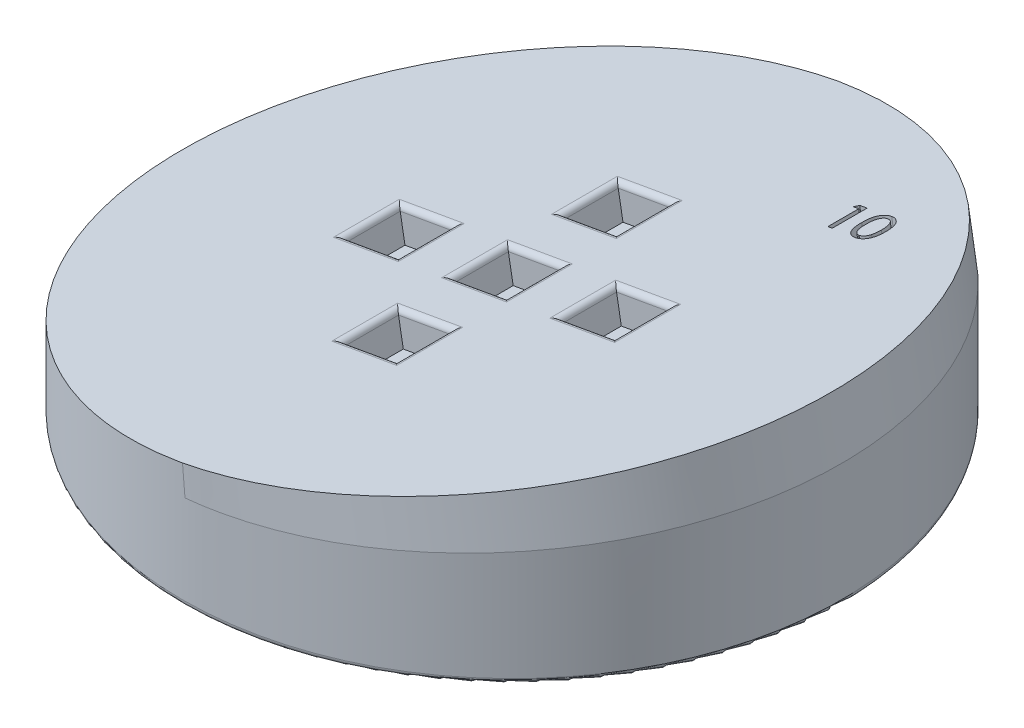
ISO-10303-21;
HEADER;
FILE_DESCRIPTION(('STEP AP214'),'2;1');
FILE_NAME('part.step','',(''),(''),'','','');
FILE_SCHEMA(('AUTOMOTIVE_DESIGN { 1 0 10303 214 1 1 1 1 }'));
ENDSEC;
DATA;
#1=APPLICATION_CONTEXT('core data for automotive mechanical design processes');
#2=APPLICATION_PROTOCOL_DEFINITION('international standard','automotive_design',2000,#1);
#3=PRODUCT_CONTEXT('',#1,'mechanical');
#4=PRODUCT('Part','Part','',(#3));
#5=PRODUCT_RELATED_PRODUCT_CATEGORY('part','',(#4));
#6=PRODUCT_DEFINITION_FORMATION('','',#4);
#7=PRODUCT_DEFINITION_CONTEXT('part definition',#1,'design');
#8=PRODUCT_DEFINITION('design','',#6,#7);
#9=PRODUCT_DEFINITION_SHAPE('','',#8);
#10=(LENGTH_UNIT() NAMED_UNIT(*) SI_UNIT(.MILLI.,.METRE.));
#11=(NAMED_UNIT(*) PLANE_ANGLE_UNIT() SI_UNIT($,.RADIAN.));
#12=(NAMED_UNIT(*) SI_UNIT($,.STERADIAN.) SOLID_ANGLE_UNIT());
#13=UNCERTAINTY_MEASURE_WITH_UNIT(LENGTH_MEASURE(1.E-05),#10,'distance_accuracy_value','');
#14=(GEOMETRIC_REPRESENTATION_CONTEXT(3) GLOBAL_UNCERTAINTY_ASSIGNED_CONTEXT((#13)) GLOBAL_UNIT_ASSIGNED_CONTEXT((#10,
#11,#12)) REPRESENTATION_CONTEXT('',''));
#15=CARTESIAN_POINT('',(0.,0.,0.));
#16=DIRECTION('',(0.,0.,1.));
#17=DIRECTION('',(1.,0.,0.));
#18=AXIS2_PLACEMENT_3D('',#15,#16,#17);
#19=CARTESIAN_POINT('',(-30.,6.,-41.5));
#20=DIRECTION('',(0.173648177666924,-0.984807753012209,0.));
#21=DIRECTION('',(0.984807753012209,0.173648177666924,0.));
#22=AXIS2_PLACEMENT_3D('',#19,#20,#21);
#23=PLANE('',#22);
#24=DIRECTION('',(0.480544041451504,0.0847328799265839,-0.872867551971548));
#25=VECTOR('',#24,1.);
#26=CARTESIAN_POINT('',(12.5587570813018,13.5042571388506,-18.5221013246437));
#27=LINE('',#26,#25);
#28=CARTESIAN_POINT('',(12.5587570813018,13.5042571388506,-18.5221013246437));
#29=VERTEX_POINT('',#28);
#30=CARTESIAN_POINT('',(12.7604434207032,13.5398198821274,-18.8884474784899));
#31=VERTEX_POINT('',#30);
#32=EDGE_CURVE('E631',#29,#31,#27,.T.);
#33=ORIENTED_EDGE('',*,*,#32,.T.);
#34=DIRECTION('',(0.984807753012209,0.173648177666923,0.));
#35=VECTOR('',#34,1.);
#36=CARTESIAN_POINT('',(12.7604434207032,13.5398198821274,-18.8884474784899));
#37=LINE('',#36,#35);
#38=CARTESIAN_POINT('',(13.4406650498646,13.6597613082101,-18.8884474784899));
#39=VERTEX_POINT('',#38);
#40=EDGE_CURVE('E649',#31,#39,#37,.T.);
#41=ORIENTED_EDGE('',*,*,#40,.T.);
#42=DIRECTION('',(0.,0.,1.));
#43=VECTOR('',#42,1.);
#44=CARTESIAN_POINT('',(13.4406650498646,13.6597613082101,-18.8884474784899));
#45=LINE('',#44,#43);
#46=CARTESIAN_POINT('',(13.4406650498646,13.6597613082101,-15.7134474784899));
#47=VERTEX_POINT('',#46);
#48=EDGE_CURVE('E652',#39,#47,#45,.T.);
#49=ORIENTED_EDGE('',*,*,#48,.T.);
#50=DIRECTION('',(-0.98480775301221,-0.17364817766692,0.));
#51=VECTOR('',#50,1.);
#52=CARTESIAN_POINT('',(13.4406650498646,13.6597613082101,-15.7134474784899));
#53=LINE('',#52,#51);
#54=CARTESIAN_POINT('',(13.039797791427,13.5890775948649,-15.7134474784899));
#55=VERTEX_POINT('',#54);
#56=EDGE_CURVE('E655',#47,#55,#53,.T.);
#57=ORIENTED_EDGE('',*,*,#56,.T.);
#58=DIRECTION('',(0.,0.,-1.));
#59=VECTOR('',#58,1.);
#60=CARTESIAN_POINT('',(13.039797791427,13.5890775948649,-15.7134474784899));
#61=LINE('',#60,#59);
#62=CARTESIAN_POINT('',(13.039797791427,13.5890775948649,-18.5221013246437));
#63=VERTEX_POINT('',#62);
#64=EDGE_CURVE('E658',#55,#63,#61,.T.);
#65=ORIENTED_EDGE('',*,*,#64,.T.);
#66=DIRECTION('',(-0.984807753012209,-0.173648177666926,0.));
#67=VECTOR('',#66,1.);
#68=CARTESIAN_POINT('',(13.039797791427,13.5890775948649,-18.5221013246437));
#69=LINE('',#68,#67);
#70=EDGE_CURVE('E636',#63,#29,#69,.T.);
#71=ORIENTED_EDGE('',*,*,#70,.T.);
#72=EDGE_LOOP('',(#33,#41,#49,#57,#65,#71));
#73=FACE_BOUND('',#72,.T.);
#74=DIRECTION('',(-0.984807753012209,-0.173648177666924,0.));
#75=VECTOR('',#74,1.);
#76=CARTESIAN_POINT('',(-30.,6.,-3.));
#77=LINE('',#76,#75);
#78=CARTESIAN_POINT('',(-3.41019066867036,10.6885007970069,-3.));
#79=VERTEX_POINT('',#78);
#80=CARTESIAN_POINT('',(2.4986558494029,11.7303898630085,-3.));
#81=VERTEX_POINT('',#80);
#82=EDGE_CURVE('E2082',#79,#81,#77,.F.);
#83=ORIENTED_EDGE('',*,*,#82,.T.);
#84=DIRECTION('',(0.,0.,-1.));
#85=VECTOR('',#84,1.);
#86=CARTESIAN_POINT('',(2.4986558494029,11.7303898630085,-41.5));
#87=LINE('',#86,#85);
#88=CARTESIAN_POINT('',(2.4986558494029,11.7303898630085,3.));
#89=VERTEX_POINT('',#88);
#90=EDGE_CURVE('E2084',#81,#89,#87,.F.);
#91=ORIENTED_EDGE('',*,*,#90,.T.);
#92=DIRECTION('',(0.984807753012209,0.173648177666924,0.));
#93=VECTOR('',#92,1.);
#94=CARTESIAN_POINT('',(-30.,6.,3.00000000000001));
#95=LINE('',#94,#93);
#96=CARTESIAN_POINT('',(-3.41019066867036,10.6885007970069,3.));
#97=VERTEX_POINT('',#96);
#98=EDGE_CURVE('E2078',#89,#97,#95,.F.);
#99=ORIENTED_EDGE('',*,*,#98,.T.);
#100=DIRECTION('',(0.,0.,1.));
#101=VECTOR('',#100,1.);
#102=CARTESIAN_POINT('',(-3.41019066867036,10.6885007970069,-41.5));
#103=LINE('',#102,#101);
#104=EDGE_CURVE('E2080',#97,#79,#103,.F.);
#105=ORIENTED_EDGE('',*,*,#104,.T.);
#106=EDGE_LOOP('',(#83,#91,#99,#105));
#107=FACE_BOUND('',#106,.T.);
#108=DIRECTION('',(-0.984807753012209,-0.173648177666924,0.));
#109=VECTOR('',#108,1.);
#110=CARTESIAN_POINT('',(-30.,6.,7.));
#111=LINE('',#110,#109);
#112=CARTESIAN_POINT('',(-3.41019066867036,10.6885007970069,7.));
#113=VERTEX_POINT('',#112);
#114=CARTESIAN_POINT('',(2.4986558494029,11.7303898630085,7.));
#115=VERTEX_POINT('',#114);
#116=EDGE_CURVE('E2055',#113,#115,#111,.F.);
#117=ORIENTED_EDGE('',*,*,#116,.T.);
#118=DIRECTION('',(0.,0.,-1.));
#119=VECTOR('',#118,1.);
#120=CARTESIAN_POINT('',(2.4986558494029,11.7303898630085,-41.5));
#121=LINE('',#120,#119);
#122=CARTESIAN_POINT('',(2.4986558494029,11.7303898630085,13.));
#123=VERTEX_POINT('',#122);
#124=EDGE_CURVE('E2057',#115,#123,#121,.F.);
#125=ORIENTED_EDGE('',*,*,#124,.T.);
#126=DIRECTION('',(0.984807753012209,0.173648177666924,0.));
#127=VECTOR('',#126,1.);
#128=CARTESIAN_POINT('',(-30.,6.,13.));
#129=LINE('',#128,#127);
#130=CARTESIAN_POINT('',(-3.41019066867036,10.6885007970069,13.));
#131=VERTEX_POINT('',#130);
#132=EDGE_CURVE('E2051',#123,#131,#129,.F.);
#133=ORIENTED_EDGE('',*,*,#132,.T.);
#134=DIRECTION('',(0.,0.,1.));
#135=VECTOR('',#134,1.);
#136=CARTESIAN_POINT('',(-3.41019066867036,10.6885007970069,-41.5));
#137=LINE('',#136,#135);
#138=EDGE_CURVE('E2053',#131,#113,#137,.F.);
#139=ORIENTED_EDGE('',*,*,#138,.T.);
#140=EDGE_LOOP('',(#117,#125,#133,#139));
#141=FACE_BOUND('',#140,.T.);
#142=DIRECTION('',(-0.984807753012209,-0.173648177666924,0.));
#143=VECTOR('',#142,1.);
#144=CARTESIAN_POINT('',(-30.,6.,-3.));
#145=LINE('',#144,#143);
#146=CARTESIAN_POINT('',(-13.2582681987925,8.9520190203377,-3.));
#147=VERTEX_POINT('',#146);
#148=CARTESIAN_POINT('',(-7.3494216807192,9.99390808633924,-3.));
#149=VERTEX_POINT('',#148);
#150=EDGE_CURVE('E2027',#147,#149,#145,.F.);
#151=ORIENTED_EDGE('',*,*,#150,.T.);
#152=DIRECTION('',(0.,0.,-1.));
#153=VECTOR('',#152,1.);
#154=CARTESIAN_POINT('',(-7.3494216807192,9.99390808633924,-41.5));
#155=LINE('',#154,#153);
#156=CARTESIAN_POINT('',(-7.3494216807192,9.99390808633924,3.));
#157=VERTEX_POINT('',#156);
#158=EDGE_CURVE('E2029',#149,#157,#155,.F.);
#159=ORIENTED_EDGE('',*,*,#158,.T.);
#160=DIRECTION('',(0.984807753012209,0.173648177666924,0.));
#161=VECTOR('',#160,1.);
#162=CARTESIAN_POINT('',(-30.,6.,3.));
#163=LINE('',#162,#161);
#164=CARTESIAN_POINT('',(-13.2582681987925,8.9520190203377,3.));
#165=VERTEX_POINT('',#164);
#166=EDGE_CURVE('E2023',#157,#165,#163,.F.);
#167=ORIENTED_EDGE('',*,*,#166,.T.);
#168=DIRECTION('',(0.,0.,1.));
#169=VECTOR('',#168,1.);
#170=CARTESIAN_POINT('',(-13.2582681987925,8.9520190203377,-41.5));
#171=LINE('',#170,#169);
#172=EDGE_CURVE('E2025',#165,#147,#171,.F.);
#173=ORIENTED_EDGE('',*,*,#172,.T.);
#174=EDGE_LOOP('',(#151,#159,#167,#173));
#175=FACE_BOUND('',#174,.T.);
#176=DIRECTION('',(-0.984807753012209,-0.173648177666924,0.));
#177=VECTOR('',#176,1.);
#178=CARTESIAN_POINT('',(-30.,6.,-3.));
#179=LINE('',#178,#177);
#180=CARTESIAN_POINT('',(6.43788686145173,12.4249825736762,-3.));
#181=VERTEX_POINT('',#180);
#182=CARTESIAN_POINT('',(12.346733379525,13.4668716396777,-3.));
#183=VERTEX_POINT('',#182);
#184=EDGE_CURVE('E1999',#181,#183,#179,.F.);
#185=ORIENTED_EDGE('',*,*,#184,.T.);
#186=DIRECTION('',(0.,0.,-1.));
#187=VECTOR('',#186,1.);
#188=CARTESIAN_POINT('',(12.346733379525,13.4668716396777,-41.5));
#189=LINE('',#188,#187);
#190=CARTESIAN_POINT('',(12.346733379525,13.4668716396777,3.));
#191=VERTEX_POINT('',#190);
#192=EDGE_CURVE('E2001',#183,#191,#189,.F.);
#193=ORIENTED_EDGE('',*,*,#192,.T.);
#194=DIRECTION('',(0.984807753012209,0.173648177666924,0.));
#195=VECTOR('',#194,1.);
#196=CARTESIAN_POINT('',(-30.,6.,3.00000000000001));
#197=LINE('',#196,#195);
#198=CARTESIAN_POINT('',(6.43788686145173,12.4249825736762,3.));
#199=VERTEX_POINT('',#198);
#200=EDGE_CURVE('E1995',#191,#199,#197,.F.);
#201=ORIENTED_EDGE('',*,*,#200,.T.);
#202=DIRECTION('',(0.,0.,1.));
#203=VECTOR('',#202,1.);
#204=CARTESIAN_POINT('',(6.43788686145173,12.4249825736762,-41.5));
#205=LINE('',#204,#203);
#206=EDGE_CURVE('E1997',#199,#181,#205,.F.);
#207=ORIENTED_EDGE('',*,*,#206,.T.);
#208=EDGE_LOOP('',(#185,#193,#201,#207));
#209=FACE_BOUND('',#208,.T.);
#210=DIRECTION('',(-0.984807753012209,-0.173648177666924,0.));
#211=VECTOR('',#210,1.);
#212=CARTESIAN_POINT('',(-30.,6.,-13.));
#213=LINE('',#212,#211);
#214=CARTESIAN_POINT('',(-3.41019066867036,10.6885007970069,-13.));
#215=VERTEX_POINT('',#214);
#216=CARTESIAN_POINT('',(2.4986558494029,11.7303898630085,-13.));
#217=VERTEX_POINT('',#216);
#218=EDGE_CURVE('E1970',#215,#217,#213,.F.);
#219=ORIENTED_EDGE('',*,*,#218,.T.);
#220=DIRECTION('',(0.,0.,-1.));
#221=VECTOR('',#220,1.);
#222=CARTESIAN_POINT('',(2.4986558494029,11.7303898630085,-41.5));
#223=LINE('',#222,#221);
#224=CARTESIAN_POINT('',(2.4986558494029,11.7303898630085,-7.));
#225=VERTEX_POINT('',#224);
#226=EDGE_CURVE('E1972',#217,#225,#223,.F.);
#227=ORIENTED_EDGE('',*,*,#226,.T.);
#228=DIRECTION('',(0.984807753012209,0.173648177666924,0.));
#229=VECTOR('',#228,1.);
#230=CARTESIAN_POINT('',(-30.,6.,-6.99999999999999));
#231=LINE('',#230,#229);
#232=CARTESIAN_POINT('',(-3.41019066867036,10.6885007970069,-7.));
#233=VERTEX_POINT('',#232);
#234=EDGE_CURVE('E1966',#225,#233,#231,.F.);
#235=ORIENTED_EDGE('',*,*,#234,.T.);
#236=DIRECTION('',(0.,0.,1.));
#237=VECTOR('',#236,1.);
#238=CARTESIAN_POINT('',(-3.41019066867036,10.6885007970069,-41.5));
#239=LINE('',#238,#237);
#240=EDGE_CURVE('E1968',#233,#215,#239,.F.);
#241=ORIENTED_EDGE('',*,*,#240,.T.);
#242=EDGE_LOOP('',(#219,#227,#235,#241));
#243=FACE_BOUND('',#242,.T.);
#244=CARTESIAN_POINT('',(-0.455767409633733,11.2094453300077,0.));
#245=DIRECTION('',(-0.173648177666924,0.984807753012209,0.));
#246=DIRECTION('',(-0.984807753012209,-0.173648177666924,0.));
#247=AXIS2_PLACEMENT_3D('',#244,#245,#246);
#248=CIRCLE('',#247,30.);
#249=CARTESIAN_POINT('',(-0.229627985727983,11.2493198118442,29.9991211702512));
#250=VERTEX_POINT('',#249);
#251=CARTESIAN_POINT('',(-0.229627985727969,11.2493198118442,-29.9991211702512));
#252=VERTEX_POINT('',#251);
#253=EDGE_CURVE('E679',#250,#252,#248,.T.);
#254=ORIENTED_EDGE('',*,*,#253,.T.);
#255=CARTESIAN_POINT('',(0.,11.2898094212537,0.));
#256=DIRECTION('',(0.173648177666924,-0.984807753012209,0.));
#257=DIRECTION('',(-0.984807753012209,-0.173648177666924,0.));
#258=AXIS2_PLACEMENT_3D('',#255,#256,#257);
#259=ELLIPSE('',#258,30.4627983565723,30.);
#260=EDGE_CURVE('E1907',#250,#252,#259,.T.);
#261=ORIENTED_EDGE('',*,*,#260,.F.);
#262=EDGE_LOOP('',(#254,#261));
#263=FACE_BOUND('',#262,.T.);
#264=CARTESIAN_POINT('',(15.5884366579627,14.0384713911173,-15.6320372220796));
#265=CARTESIAN_POINT('',(15.5631520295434,14.0340130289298,-15.6324734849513));
#266=CARTESIAN_POINT('',(15.5130740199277,14.0251829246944,-15.6333375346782));
#267=CARTESIAN_POINT('',(15.4391258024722,14.0121438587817,-15.6418118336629));
#268=CARTESIAN_POINT('',(15.3670896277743,13.9994419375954,-15.6558762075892));
#269=CARTESIAN_POINT('',(15.2971770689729,13.9871144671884,-15.6755880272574));
#270=CARTESIAN_POINT('',(15.2288969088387,13.9750748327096,-15.7006144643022));
#271=CARTESIAN_POINT('',(15.162545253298,13.9633752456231,-15.7309304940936));
#272=CARTESIAN_POINT('',(15.0985582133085,13.9520926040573,-15.767639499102));
#273=CARTESIAN_POINT('',(15.0363251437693,13.9411192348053,-15.8088851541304));
#274=CARTESIAN_POINT('',(14.9767498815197,13.9306145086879,-15.8557990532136));
#275=CARTESIAN_POINT('',(14.921259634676,13.9208300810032,-15.9088235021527));
#276=CARTESIAN_POINT('',(14.8685202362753,13.9115307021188,-15.9666912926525));
#277=CARTESIAN_POINT('',(14.8195764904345,13.9029005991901,-16.0300264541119));
#278=CARTESIAN_POINT('',(14.7733468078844,13.8947490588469,-16.0984201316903));
#279=CARTESIAN_POINT('',(14.7316714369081,13.8874005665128,-16.1725166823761));
#280=CARTESIAN_POINT('',(14.6928164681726,13.8805493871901,-16.251524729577));
#281=CARTESIAN_POINT('',(14.6567930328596,13.8741974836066,-16.3360528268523));
#282=CARTESIAN_POINT('',(14.6242672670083,13.8684623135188,-16.4275696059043));
#283=CARTESIAN_POINT('',(14.5983250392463,13.8638879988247,-16.527865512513));
#284=CARTESIAN_POINT('',(14.5738617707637,13.8595744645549,-16.6358461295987));
#285=CARTESIAN_POINT('',(14.5559092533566,13.8564089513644,-16.7526038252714));
#286=CARTESIAN_POINT('',(14.540333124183,13.8536624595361,-16.8772577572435));
#287=CARTESIAN_POINT('',(14.5312965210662,13.8520690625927,-17.0106171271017));
#288=CARTESIAN_POINT('',(14.5235740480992,13.8507073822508,-17.152239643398));
#289=CARTESIAN_POINT('',(14.5231992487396,13.8506412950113,-17.249629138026));
#290=CARTESIAN_POINT('',(14.5230066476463,13.8506073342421,-17.2996754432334));
#291=B_SPLINE_CURVE_WITH_KNOTS('',3,(#264,#265,#266,#267,#268,#269,#270,#271,#272,#273,#274,
#275,#276,#277,#278,#279,#280,#281,#282,#283,#284,#285,#286,#287,#288,#289,#290),.UNSPECIFIED.,
.F.,.F.,(4,1,1,1,1,1,1,1,1,1,1,1,1,1,1,1,1,1,1,1,1,1,1,1,4),(0.,0.0344225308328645,
0.0681762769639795,0.101187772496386,0.134229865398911,0.166878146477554,0.199963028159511,
0.233185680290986,0.266859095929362,0.30109795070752,0.335699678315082,0.370509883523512,
0.406744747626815,0.443573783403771,0.481662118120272,0.521080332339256,0.561961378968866,
0.605128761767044,0.651412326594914,0.700940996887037,0.753667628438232,0.809812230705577,
0.869410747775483,0.932893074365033,1.),.UNSPECIFIED.);
#292=CARTESIAN_POINT('',(15.5884366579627,14.0384713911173,-15.6320372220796));
#293=VERTEX_POINT('',#292);
#294=CARTESIAN_POINT('',(14.5230066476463,13.8506073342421,-17.2996754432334));
#295=VERTEX_POINT('',#294);
#296=EDGE_CURVE('E50',#293,#295,#291,.T.);
#297=ORIENTED_EDGE('',*,*,#296,.T.);
#298=CARTESIAN_POINT('',(14.5230066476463,13.8506073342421,-17.2996754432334));
#299=CARTESIAN_POINT('',(14.523305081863,13.8506599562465,-17.3501390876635));
#300=CARTESIAN_POINT('',(14.5238846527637,13.8507621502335,-17.4481414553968));
#301=CARTESIAN_POINT('',(14.5301297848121,13.8518633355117,-17.5907097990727));
#302=CARTESIAN_POINT('',(14.5409030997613,13.8537629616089,-17.7245315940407));
#303=CARTESIAN_POINT('',(14.554741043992,13.8562029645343,-17.8496108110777));
#304=CARTESIAN_POINT('',(14.5738854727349,13.8595786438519,-17.9660333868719));
#305=CARTESIAN_POINT('',(14.5957906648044,13.8634411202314,-18.0738568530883));
#306=CARTESIAN_POINT('',(14.6227552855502,13.8681957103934,-18.1730944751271));
#307=CARTESIAN_POINT('',(14.6542508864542,13.8737492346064,-18.2639233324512));
#308=CARTESIAN_POINT('',(14.6896141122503,13.8799847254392,-18.3479565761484));
#309=CARTESIAN_POINT('',(14.7284961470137,13.8868406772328,-18.4262468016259));
#310=CARTESIAN_POINT('',(14.7706507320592,13.8942736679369,-18.4997880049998));
#311=CARTESIAN_POINT('',(14.8157931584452,13.9022334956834,-18.5685545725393));
#312=CARTESIAN_POINT('',(14.8660576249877,13.9110964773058,-18.631014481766));
#313=CARTESIAN_POINT('',(14.918493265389,13.9203422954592,-18.6893068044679));
#314=CARTESIAN_POINT('',(14.9750689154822,13.9303181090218,-18.7422936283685));
#315=CARTESIAN_POINT('',(15.0352661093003,13.9409324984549,-18.7897096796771));
#316=CARTESIAN_POINT('',(15.0975368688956,13.9519125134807,-18.8325783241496));
#317=CARTESIAN_POINT('',(15.1626175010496,13.963387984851,-18.8687108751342));
#318=CARTESIAN_POINT('',(15.2290000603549,13.975093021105,-18.9001857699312));
#319=CARTESIAN_POINT('',(15.2975310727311,13.9871768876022,-18.9256462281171));
#320=CARTESIAN_POINT('',(15.3677136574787,13.9995519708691,-18.9454241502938));
#321=CARTESIAN_POINT('',(15.4397991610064,14.012262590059,-18.9592361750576));
#322=CARTESIAN_POINT('',(15.5134448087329,14.0252483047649,-18.9687477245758));
#323=CARTESIAN_POINT('',(15.5633530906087,14.0340484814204,-18.9694864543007));
#324=CARTESIAN_POINT('',(15.5884366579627,14.0384713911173,-18.9698577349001));
#325=B_SPLINE_CURVE_WITH_KNOTS('',3,(#298,#299,#300,#301,#302,#303,#304,#305,#306,#307,#308,
#309,#310,#311,#312,#313,#314,#315,#316,#317,#318,#319,#320,#321,#322,#323,#324),.UNSPECIFIED.,
.F.,.F.,(4,1,1,1,1,1,1,1,1,1,1,1,1,1,1,1,1,1,1,1,1,1,1,1,4),(0.,0.0676053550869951,
0.131292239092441,0.191134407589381,0.247469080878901,0.299860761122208,0.34921726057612,
0.394905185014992,0.437665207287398,0.47813076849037,0.517254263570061,0.555057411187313,
0.592083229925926,0.627836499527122,0.663011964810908,0.697786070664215,0.732388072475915,
0.766577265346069,0.800013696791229,0.833182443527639,0.866160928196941,0.899168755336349,
0.932146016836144,0.965897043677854,1.),.UNSPECIFIED.);
#326=CARTESIAN_POINT('',(15.5884366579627,14.0384713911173,-18.9698577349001));
#327=VERTEX_POINT('',#326);
#328=EDGE_CURVE('E596',#295,#327,#325,.T.);
#329=ORIENTED_EDGE('',*,*,#328,.T.);
#330=CARTESIAN_POINT('',(15.5884366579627,14.0384713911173,-18.9698577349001));
#331=CARTESIAN_POINT('',(15.6158000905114,14.0432963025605,-18.9691260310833));
#332=CARTESIAN_POINT('',(15.6698106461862,14.052819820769,-18.9676817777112));
#333=CARTESIAN_POINT('',(15.7499649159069,14.0669531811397,-18.9598220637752));
#334=CARTESIAN_POINT('',(15.8274317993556,14.0806126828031,-18.9439428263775));
#335=CARTESIAN_POINT('',(15.9032741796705,14.0939857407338,-18.9240296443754));
#336=CARTESIAN_POINT('',(15.9762635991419,14.1068557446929,-18.8968078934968));
#337=CARTESIAN_POINT('',(16.0478458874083,14.1194776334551,-18.8655041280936));
#338=CARTESIAN_POINT('',(16.115817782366,14.131462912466,-18.8258549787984));
#339=CARTESIAN_POINT('',(16.1824976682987,14.1432203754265,-18.7824841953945));
#340=CARTESIAN_POINT('',(16.245599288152,14.1543468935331,-18.7324691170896));
#341=CARTESIAN_POINT('',(16.3059534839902,14.1649889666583,-18.6781242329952));
#342=CARTESIAN_POINT('',(16.3616785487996,14.1748147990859,-18.6175944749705));
#343=CARTESIAN_POINT('',(16.4148057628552,14.1841825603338,-18.5529626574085));
#344=CARTESIAN_POINT('',(16.462610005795,14.1926117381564,-18.4816975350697));
#345=CARTESIAN_POINT('',(16.5081182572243,14.2006360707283,-18.4062945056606));
#346=CARTESIAN_POINT('',(16.5484129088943,14.2077411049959,-18.3248756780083));
#347=CARTESIAN_POINT('',(16.5866437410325,14.2144822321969,-18.2388813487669));
#348=CARTESIAN_POINT('',(16.6195054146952,14.2202766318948,-18.1460249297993));
#349=CARTESIAN_POINT('',(16.649248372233,14.2255211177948,-18.0468366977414));
#350=CARTESIAN_POINT('',(16.6733517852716,14.2297711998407,-17.9400808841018));
#351=CARTESIAN_POINT('',(16.6933463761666,14.2332967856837,-17.8260892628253));
#352=CARTESIAN_POINT('',(16.708755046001,14.2360137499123,-17.7046699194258));
#353=CARTESIAN_POINT('',(16.7201347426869,14.2380202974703,-17.5761112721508));
#354=CARTESIAN_POINT('',(16.7260760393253,14.2390679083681,-17.4402931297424));
#355=CARTESIAN_POINT('',(16.7271996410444,14.2392660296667,-17.3473819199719));
#356=CARTESIAN_POINT('',(16.7277765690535,14.2393677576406,-17.2996754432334));
#357=B_SPLINE_CURVE_WITH_KNOTS('',3,(#330,#331,#332,#333,#334,#335,#336,#337,#338,#339,#340,
#341,#342,#343,#344,#345,#346,#347,#348,#349,#350,#351,#352,#353,#354,#355,#356),.UNSPECIFIED.,
.F.,.F.,(4,1,1,1,1,1,1,1,1,1,1,1,1,1,1,1,1,1,1,1,1,1,1,1,4),(0.,0.0364607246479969,
0.071966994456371,0.107094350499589,0.141635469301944,0.1762090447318,0.210576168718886,
0.245316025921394,0.280492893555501,0.315984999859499,0.351831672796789,0.387834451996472,
0.424584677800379,0.46215711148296,0.500840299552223,0.540519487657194,0.581607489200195,
0.624544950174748,0.66985862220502,0.717555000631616,0.768128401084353,0.821703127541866,
0.878106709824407,0.937412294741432,1.),.UNSPECIFIED.);
#358=CARTESIAN_POINT('',(16.7277765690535,14.2393677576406,-17.2996754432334));
#359=VERTEX_POINT('',#358);
#360=EDGE_CURVE('E604',#327,#359,#357,.T.);
#361=ORIENTED_EDGE('',*,*,#360,.T.);
#362=CARTESIAN_POINT('',(16.7277765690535,14.2393677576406,-17.2996754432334));
#363=CARTESIAN_POINT('',(16.7271935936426,14.2392649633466,-17.2521817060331));
#364=CARTESIAN_POINT('',(16.7260583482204,14.2390647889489,-17.1596957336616));
#365=CARTESIAN_POINT('',(16.7202023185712,14.238032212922,-17.0245024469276));
#366=CARTESIAN_POINT('',(16.7085276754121,14.2359736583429,-16.8966429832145));
#367=CARTESIAN_POINT('',(16.6941531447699,14.2334390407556,-16.775758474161));
#368=CARTESIAN_POINT('',(16.6739905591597,14.2298838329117,-16.6622160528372));
#369=CARTESIAN_POINT('',(16.6494402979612,14.225554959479,-16.5559557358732));
#370=CARTESIAN_POINT('',(16.6219091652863,14.2207004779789,-16.4564188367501));
#371=CARTESIAN_POINT('',(16.5882536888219,14.2147661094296,-16.3644777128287));
#372=CARTESIAN_POINT('',(16.5509873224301,14.2081950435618,-16.2785849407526));
#373=CARTESIAN_POINT('',(16.5105558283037,14.201065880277,-16.197894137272));
#374=CARTESIAN_POINT('',(16.4660270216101,14.1932142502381,-16.1222462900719));
#375=CARTESIAN_POINT('',(16.4167222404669,14.1845204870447,-16.0524621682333));
#376=CARTESIAN_POINT('',(16.3649908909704,14.17539885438,-15.9863459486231));
#377=CARTESIAN_POINT('',(16.3085855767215,14.1654530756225,-15.9261955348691));
#378=CARTESIAN_POINT('',(16.2485342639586,14.1548644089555,-15.8708644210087));
#379=CARTESIAN_POINT('',(16.1849821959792,14.1436584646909,-15.8210572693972));
#380=CARTESIAN_POINT('',(16.1186567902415,14.1319635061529,-15.7761412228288));
#381=CARTESIAN_POINT('',(16.0491419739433,14.1197061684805,-15.7382266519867));
#382=CARTESIAN_POINT('',(15.9781900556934,14.1071954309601,-15.7045736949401));
#383=CARTESIAN_POINT('',(15.9042168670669,14.0941519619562,-15.679069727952));
#384=CARTESIAN_POINT('',(15.8287219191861,14.0808401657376,-15.6573041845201));
#385=CARTESIAN_POINT('',(15.7504339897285,14.0670358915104,-15.6432448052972));
#386=CARTESIAN_POINT('',(15.6700798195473,14.0528672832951,-15.6339362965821));
#387=CARTESIAN_POINT('',(15.6158133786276,14.0432986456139,-15.6326740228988));
#388=CARTESIAN_POINT('',(15.5884366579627,14.0384713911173,-15.6320372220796));
#389=B_SPLINE_CURVE_WITH_KNOTS('',3,(#362,#363,#364,#365,#366,#367,#368,#369,#370,#371,#372,
#373,#374,#375,#376,#377,#378,#379,#380,#381,#382,#383,#384,#385,#386,#387,#388),.UNSPECIFIED.,
.F.,.F.,(4,1,1,1,1,1,1,1,1,1,1,1,1,1,1,1,1,1,1,1,1,1,1,1,4),(0.,0.0623586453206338,
0.12143285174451,0.177603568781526,0.230908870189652,0.281248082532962,0.328981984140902,
0.374173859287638,0.41688378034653,0.457636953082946,0.497347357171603,0.535678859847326,
0.573212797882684,0.6100319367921,0.646456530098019,0.682124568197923,0.718035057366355,
0.753392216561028,0.78826842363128,0.823144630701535,0.857652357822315,0.892293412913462,
0.927670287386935,0.963510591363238,1.),.UNSPECIFIED.);
#390=EDGE_CURVE('E612',#359,#293,#389,.T.);
#391=ORIENTED_EDGE('',*,*,#390,.T.);
#392=EDGE_LOOP('',(#297,#329,#361,#391));
#393=FACE_BOUND('',#392,.T.);
#394=ADVANCED_FACE('F33',(#73,#107,#141,#175,#209,#243,#263,#393),#23,.F.);
#395=CARTESIAN_POINT('',(0.,50.,0.));
#396=DIRECTION('',(0.,-1.,0.));
#397=DIRECTION('',(0.,0.,-1.));
#398=AXIS2_PLACEMENT_3D('',#395,#396,#397);
#399=CYLINDRICAL_SURFACE('',#398,30.);
#400=CARTESIAN_POINT('',(0.,8.62465990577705,0.));
#401=DIRECTION('',(0.0871557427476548,-0.996194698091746,0.));
#402=DIRECTION('',(-0.996194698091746,-0.0871557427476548,0.));
#403=AXIS2_PLACEMENT_3D('',#400,#401,#402);
#404=ELLIPSE('',#403,30.1145951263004,30.);
#405=CARTESIAN_POINT('',(0.229627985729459,8.64474977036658,29.9991211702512));
#406=VERTEX_POINT('',#405);
#407=CARTESIAN_POINT('',(0.229627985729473,8.64474977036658,-29.9991211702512));
#408=VERTEX_POINT('',#407);
#409=EDGE_CURVE('E708',#406,#408,#404,.F.);
#410=ORIENTED_EDGE('',*,*,#409,.F.);
#411=CARTESIAN_POINT('',(0.229627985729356,8.64474977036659,29.9991211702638));
#412=CARTESIAN_POINT('',(0.155609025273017,9.49736608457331,29.9996877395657));
#413=CARTESIAN_POINT('',(0.0815900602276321,10.3499824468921,29.9999803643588));
#414=CARTESIAN_POINT('',(0.00504739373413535,11.2316690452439,29.9999996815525));
#415=CARTESIAN_POINT('',(0.00252369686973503,11.2607392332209,30.0000000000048));
#416=CARTESIAN_POINT('',(0.,11.2898094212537,30.));
#417=B_SPLINE_CURVE_WITH_KNOTS('',3,(#411,#412,#413,#414,#415,#416),.UNSPECIFIED.,.F.,.F.,(4,2,
4),(0.,2.56746995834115,2.65500854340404),.UNSPECIFIED.);
#418=CARTESIAN_POINT('',(0.,11.2898094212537,30.));
#419=VERTEX_POINT('',#418);
#420=EDGE_CURVE('E702',#406,#419,#417,.T.);
#421=ORIENTED_EDGE('',*,*,#420,.T.);
#422=CARTESIAN_POINT('',(0.,11.2898094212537,0.));
#423=DIRECTION('',(-0.173648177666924,0.984807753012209,0.));
#424=DIRECTION('',(-0.984807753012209,-0.173648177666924,0.));
#425=AXIS2_PLACEMENT_3D('',#422,#423,#424);
#426=ELLIPSE('',#425,30.4627983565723,30.);
#427=EDGE_CURVE('E2476',#250,#419,#426,.T.);
#428=ORIENTED_EDGE('',*,*,#427,.F.);
#429=ORIENTED_EDGE('',*,*,#260,.T.);
#430=CARTESIAN_POINT('',(0.,11.2898094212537,-30.));
#431=VERTEX_POINT('',#430);
#432=EDGE_CURVE('E1960',#252,#431,#259,.T.);
#433=ORIENTED_EDGE('',*,*,#432,.T.);
#434=CARTESIAN_POINT('',(0.229627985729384,8.64474977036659,-29.9991211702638));
#435=CARTESIAN_POINT('',(0.155609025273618,9.49736608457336,-29.9996877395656));
#436=CARTESIAN_POINT('',(0.081590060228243,10.3499824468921,-29.9999803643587));
#437=CARTESIAN_POINT('',(0.00504739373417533,11.2316690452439,-29.9999996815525));
#438=CARTESIAN_POINT('',(0.00252369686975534,11.2607392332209,-30.0000000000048));
#439=CARTESIAN_POINT('',(0.,11.2898094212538,-30.));
#440=B_SPLINE_CURVE_WITH_KNOTS('',3,(#434,#435,#436,#437,#438,#439),.UNSPECIFIED.,.F.,.F.,(4,2,
4),(0.,2.56746995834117,2.65500854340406),.UNSPECIFIED.);
#441=EDGE_CURVE('E695',#431,#408,#440,.F.);
#442=ORIENTED_EDGE('',*,*,#441,.T.);
#443=EDGE_LOOP('',(#410,#421,#428,#429,#433,#442));
#444=FACE_BOUND('',#443,.T.);
#445=CARTESIAN_POINT('',(0.,0.5,0.));
#446=DIRECTION('',(0.,1.,0.));
#447=DIRECTION('',(0.,0.,1.));
#448=AXIS2_PLACEMENT_3D('',#445,#446,#447);
#449=CIRCLE('',#448,30.);
#450=CARTESIAN_POINT('',(0.,0.5,30.));
#451=VERTEX_POINT('',#450);
#452=EDGE_CURVE('E1803',#451,#451,#449,.T.);
#453=ORIENTED_EDGE('',*,*,#452,.T.);
#454=EDGE_LOOP('',(#453));
#455=FACE_BOUND('',#454,.T.);
#456=ADVANCED_FACE('F710',(#444,#455),#399,.T.);
#457=CARTESIAN_POINT('',(0.,0.,0.));
#458=DIRECTION('',(0.,1.,0.));
#459=DIRECTION('',(0.,0.,1.));
#460=AXIS2_PLACEMENT_3D('',#457,#458,#459);
#461=PLANE('',#460);
#462=CARTESIAN_POINT('',(0.,0.,0.));
#463=DIRECTION('',(0.,1.,0.));
#464=DIRECTION('',(0.,0.,1.));
#465=AXIS2_PLACEMENT_3D('',#462,#463,#464);
#466=CIRCLE('',#465,29.5);
#467=CARTESIAN_POINT('',(0.,0.,29.5));
#468=VERTEX_POINT('',#467);
#469=EDGE_CURVE('E1859',#468,#468,#466,.F.);
#470=ORIENTED_EDGE('',*,*,#469,.T.);
#471=EDGE_LOOP('',(#470));
#472=FACE_BOUND('',#471,.T.);
#473=DIRECTION('',(-1.,0.,0.));
#474=VECTOR('',#473,1.);
#475=CARTESIAN_POINT('',(0.,0.,3.));
#476=LINE('',#475,#474);
#477=CARTESIAN_POINT('',(-3.,0.,3.));
#478=VERTEX_POINT('',#477);
#479=CARTESIAN_POINT('',(3.,0.,3.));
#480=VERTEX_POINT('',#479);
#481=EDGE_CURVE('E1854',#478,#480,#476,.F.);
#482=ORIENTED_EDGE('',*,*,#481,.T.);
#483=DIRECTION('',(0.,0.,1.));
#484=VECTOR('',#483,1.);
#485=CARTESIAN_POINT('',(3.,0.,0.));
#486=LINE('',#485,#484);
#487=CARTESIAN_POINT('',(3.,0.,-3.));
#488=VERTEX_POINT('',#487);
#489=EDGE_CURVE('E1856',#480,#488,#486,.F.);
#490=ORIENTED_EDGE('',*,*,#489,.T.);
#491=DIRECTION('',(1.,0.,0.));
#492=VECTOR('',#491,1.);
#493=CARTESIAN_POINT('',(0.,0.,-3.));
#494=LINE('',#493,#492);
#495=CARTESIAN_POINT('',(-3.,0.,-3.));
#496=VERTEX_POINT('',#495);
#497=EDGE_CURVE('E1850',#488,#496,#494,.F.);
#498=ORIENTED_EDGE('',*,*,#497,.T.);
#499=DIRECTION('',(0.,0.,-1.));
#500=VECTOR('',#499,1.);
#501=CARTESIAN_POINT('',(-3.,0.,0.));
#502=LINE('',#501,#500);
#503=EDGE_CURVE('E1852',#496,#478,#502,.F.);
#504=ORIENTED_EDGE('',*,*,#503,.T.);
#505=EDGE_LOOP('',(#482,#490,#498,#504));
#506=FACE_BOUND('',#505,.T.);
#507=DIRECTION('',(-1.,0.,0.));
#508=VECTOR('',#507,1.);
#509=CARTESIAN_POINT('',(0.,0.,13.));
#510=LINE('',#509,#508);
#511=CARTESIAN_POINT('',(-3.,0.,13.));
#512=VERTEX_POINT('',#511);
#513=CARTESIAN_POINT('',(3.,0.,13.));
#514=VERTEX_POINT('',#513);
#515=EDGE_CURVE('E1845',#512,#514,#510,.F.);
#516=ORIENTED_EDGE('',*,*,#515,.T.);
#517=DIRECTION('',(0.,0.,1.));
#518=VECTOR('',#517,1.);
#519=CARTESIAN_POINT('',(3.,0.,0.));
#520=LINE('',#519,#518);
#521=CARTESIAN_POINT('',(3.,0.,7.));
#522=VERTEX_POINT('',#521);
#523=EDGE_CURVE('E1847',#514,#522,#520,.F.);
#524=ORIENTED_EDGE('',*,*,#523,.T.);
#525=DIRECTION('',(1.,0.,0.));
#526=VECTOR('',#525,1.);
#527=CARTESIAN_POINT('',(0.,0.,7.));
#528=LINE('',#527,#526);
#529=CARTESIAN_POINT('',(-3.,0.,7.));
#530=VERTEX_POINT('',#529);
#531=EDGE_CURVE('E1841',#522,#530,#528,.F.);
#532=ORIENTED_EDGE('',*,*,#531,.T.);
#533=DIRECTION('',(0.,0.,-1.));
#534=VECTOR('',#533,1.);
#535=CARTESIAN_POINT('',(-3.,0.,0.));
#536=LINE('',#535,#534);
#537=EDGE_CURVE('E1843',#530,#512,#536,.F.);
#538=ORIENTED_EDGE('',*,*,#537,.T.);
#539=EDGE_LOOP('',(#516,#524,#532,#538));
#540=FACE_BOUND('',#539,.T.);
#541=DIRECTION('',(-1.,0.,0.));
#542=VECTOR('',#541,1.);
#543=CARTESIAN_POINT('',(0.,0.,3.));
#544=LINE('',#543,#542);
#545=CARTESIAN_POINT('',(-13.,0.,3.));
#546=VERTEX_POINT('',#545);
#547=CARTESIAN_POINT('',(-7.,0.,3.));
#548=VERTEX_POINT('',#547);
#549=EDGE_CURVE('E1836',#546,#548,#544,.F.);
#550=ORIENTED_EDGE('',*,*,#549,.T.);
#551=DIRECTION('',(0.,0.,1.));
#552=VECTOR('',#551,1.);
#553=CARTESIAN_POINT('',(-7.,0.,0.));
#554=LINE('',#553,#552);
#555=CARTESIAN_POINT('',(-7.,0.,-3.));
#556=VERTEX_POINT('',#555);
#557=EDGE_CURVE('E1838',#548,#556,#554,.F.);
#558=ORIENTED_EDGE('',*,*,#557,.T.);
#559=DIRECTION('',(1.,0.,0.));
#560=VECTOR('',#559,1.);
#561=CARTESIAN_POINT('',(0.,0.,-3.));
#562=LINE('',#561,#560);
#563=CARTESIAN_POINT('',(-13.,0.,-3.));
#564=VERTEX_POINT('',#563);
#565=EDGE_CURVE('E1832',#556,#564,#562,.F.);
#566=ORIENTED_EDGE('',*,*,#565,.T.);
#567=DIRECTION('',(0.,0.,-1.));
#568=VECTOR('',#567,1.);
#569=CARTESIAN_POINT('',(-13.,0.,0.));
#570=LINE('',#569,#568);
#571=EDGE_CURVE('E1834',#564,#546,#570,.F.);
#572=ORIENTED_EDGE('',*,*,#571,.T.);
#573=EDGE_LOOP('',(#550,#558,#566,#572));
#574=FACE_BOUND('',#573,.T.);
#575=DIRECTION('',(-1.,0.,0.));
#576=VECTOR('',#575,1.);
#577=CARTESIAN_POINT('',(0.,0.,3.));
#578=LINE('',#577,#576);
#579=CARTESIAN_POINT('',(7.,0.,3.));
#580=VERTEX_POINT('',#579);
#581=CARTESIAN_POINT('',(13.,0.,3.));
#582=VERTEX_POINT('',#581);
#583=EDGE_CURVE('E1827',#580,#582,#578,.F.);
#584=ORIENTED_EDGE('',*,*,#583,.T.);
#585=DIRECTION('',(0.,0.,1.));
#586=VECTOR('',#585,1.);
#587=CARTESIAN_POINT('',(13.,0.,0.));
#588=LINE('',#587,#586);
#589=CARTESIAN_POINT('',(13.,0.,-2.99999999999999));
#590=VERTEX_POINT('',#589);
#591=EDGE_CURVE('E1829',#582,#590,#588,.F.);
#592=ORIENTED_EDGE('',*,*,#591,.T.);
#593=DIRECTION('',(1.,0.,0.));
#594=VECTOR('',#593,1.);
#595=CARTESIAN_POINT('',(0.,0.,-2.99999999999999));
#596=LINE('',#595,#594);
#597=CARTESIAN_POINT('',(7.,0.,-2.99999999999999));
#598=VERTEX_POINT('',#597);
#599=EDGE_CURVE('E1823',#590,#598,#596,.F.);
#600=ORIENTED_EDGE('',*,*,#599,.T.);
#601=DIRECTION('',(0.,0.,-1.));
#602=VECTOR('',#601,1.);
#603=CARTESIAN_POINT('',(7.,0.,0.));
#604=LINE('',#603,#602);
#605=EDGE_CURVE('E1825',#598,#580,#604,.F.);
#606=ORIENTED_EDGE('',*,*,#605,.T.);
#607=EDGE_LOOP('',(#584,#592,#600,#606));
#608=FACE_BOUND('',#607,.T.);
#609=DIRECTION('',(1.,0.,0.));
#610=VECTOR('',#609,1.);
#611=CARTESIAN_POINT('',(0.,0.,-13.));
#612=LINE('',#611,#610);
#613=CARTESIAN_POINT('',(3.,0.,-13.));
#614=VERTEX_POINT('',#613);
#615=CARTESIAN_POINT('',(-3.,0.,-13.));
#616=VERTEX_POINT('',#615);
#617=EDGE_CURVE('E1818',#614,#616,#612,.F.);
#618=ORIENTED_EDGE('',*,*,#617,.T.);
#619=DIRECTION('',(0.,0.,-1.));
#620=VECTOR('',#619,1.);
#621=CARTESIAN_POINT('',(-3.,0.,0.));
#622=LINE('',#621,#620);
#623=CARTESIAN_POINT('',(-3.,0.,-7.));
#624=VERTEX_POINT('',#623);
#625=EDGE_CURVE('E1820',#616,#624,#622,.F.);
#626=ORIENTED_EDGE('',*,*,#625,.T.);
#627=DIRECTION('',(-1.,0.,0.));
#628=VECTOR('',#627,1.);
#629=CARTESIAN_POINT('',(0.,0.,-7.));
#630=LINE('',#629,#628);
#631=CARTESIAN_POINT('',(3.,0.,-7.));
#632=VERTEX_POINT('',#631);
#633=EDGE_CURVE('E1814',#624,#632,#630,.F.);
#634=ORIENTED_EDGE('',*,*,#633,.T.);
#635=DIRECTION('',(0.,0.,1.));
#636=VECTOR('',#635,1.);
#637=CARTESIAN_POINT('',(3.,0.,0.));
#638=LINE('',#637,#636);
#639=EDGE_CURVE('E1816',#632,#614,#638,.F.);
#640=ORIENTED_EDGE('',*,*,#639,.T.);
#641=EDGE_LOOP('',(#618,#626,#634,#640));
#642=FACE_BOUND('',#641,.T.);
#643=ADVANCED_FACE('F715',(#472,#506,#540,#574,#608,#642),#461,.F.);
#644=CARTESIAN_POINT('',(-2.5,3.,-2.5));
#645=DIRECTION('',(-1.,0.,0.));
#646=DIRECTION('',(0.,0.,1.));
#647=AXIS2_PLACEMENT_3D('',#644,#645,#646);
#648=PLANE('',#647);
#649=DIRECTION('',(0.,-1.,0.));
#650=VECTOR('',#649,1.);
#651=CARTESIAN_POINT('',(-2.5,3.,2.5));
#652=LINE('',#651,#650);
#653=CARTESIAN_POINT('',(-2.5,3.,2.5));
#654=VERTEX_POINT('',#653);
#655=CARTESIAN_POINT('',(-2.5,0.5,2.5));
#656=VERTEX_POINT('',#655);
#657=EDGE_CURVE('E1801',#654,#656,#652,.T.);
#658=ORIENTED_EDGE('',*,*,#657,.T.);
#659=DIRECTION('',(0.,0.,-1.));
#660=VECTOR('',#659,1.);
#661=CARTESIAN_POINT('',(-2.5,0.5,-2.5));
#662=LINE('',#661,#660);
#663=CARTESIAN_POINT('',(-2.5,0.5,-2.5));
#664=VERTEX_POINT('',#663);
#665=EDGE_CURVE('E1867',#656,#664,#662,.T.);
#666=ORIENTED_EDGE('',*,*,#665,.T.);
#667=DIRECTION('',(0.,-1.,0.));
#668=VECTOR('',#667,1.);
#669=CARTESIAN_POINT('',(-2.5,3.,-2.5));
#670=LINE('',#669,#668);
#671=CARTESIAN_POINT('',(-2.5,3.,-2.5));
#672=VERTEX_POINT('',#671);
#673=EDGE_CURVE('E1800',#672,#664,#670,.T.);
#674=ORIENTED_EDGE('',*,*,#673,.F.);
#675=DIRECTION('',(0.,0.,-1.));
#676=VECTOR('',#675,1.);
#677=CARTESIAN_POINT('',(-2.5,3.,-2.5));
#678=LINE('',#677,#676);
#679=EDGE_CURVE('E1780',#654,#672,#678,.T.);
#680=ORIENTED_EDGE('',*,*,#679,.F.);
#681=EDGE_LOOP('',(#658,#666,#674,#680));
#682=FACE_BOUND('',#681,.T.);
#683=ADVANCED_FACE('F1723',(#682),#648,.F.);
#684=CARTESIAN_POINT('',(2.5,3.,2.5));
#685=DIRECTION('',(0.,0.,1.));
#686=DIRECTION('',(1.,0.,0.));
#687=AXIS2_PLACEMENT_3D('',#684,#685,#686);
#688=PLANE('',#687);
#689=DIRECTION('',(0.,-1.,0.));
#690=VECTOR('',#689,1.);
#691=CARTESIAN_POINT('',(2.5,3.,2.5));
#692=LINE('',#691,#690);
#693=CARTESIAN_POINT('',(2.5,3.,2.5));
#694=VERTEX_POINT('',#693);
#695=CARTESIAN_POINT('',(2.5,0.5,2.5));
#696=VERTEX_POINT('',#695);
#697=EDGE_CURVE('E1804',#694,#696,#692,.T.);
#698=ORIENTED_EDGE('',*,*,#697,.T.);
#699=DIRECTION('',(-1.,0.,0.));
#700=VECTOR('',#699,1.);
#701=CARTESIAN_POINT('',(2.5,0.5,2.5));
#702=LINE('',#701,#700);
#703=EDGE_CURVE('E1865',#696,#656,#702,.T.);
#704=ORIENTED_EDGE('',*,*,#703,.T.);
#705=ORIENTED_EDGE('',*,*,#657,.F.);
#706=DIRECTION('',(-1.,0.,0.));
#707=VECTOR('',#706,1.);
#708=CARTESIAN_POINT('',(2.5,3.,2.5));
#709=LINE('',#708,#707);
#710=EDGE_CURVE('E1785',#694,#654,#709,.T.);
#711=ORIENTED_EDGE('',*,*,#710,.F.);
#712=EDGE_LOOP('',(#698,#704,#705,#711));
#713=FACE_BOUND('',#712,.T.);
#714=ADVANCED_FACE('F1713',(#713),#688,.F.);
#715=CARTESIAN_POINT('',(2.5,3.,-2.5));
#716=DIRECTION('',(1.,0.,0.));
#717=DIRECTION('',(0.,0.,-1.));
#718=AXIS2_PLACEMENT_3D('',#715,#716,#717);
#719=PLANE('',#718);
#720=DIRECTION('',(0.,-1.,0.));
#721=VECTOR('',#720,1.);
#722=CARTESIAN_POINT('',(2.5,3.,-2.5));
#723=LINE('',#722,#721);
#724=CARTESIAN_POINT('',(2.5,3.,-2.5));
#725=VERTEX_POINT('',#724);
#726=CARTESIAN_POINT('',(2.5,0.5,-2.5));
#727=VERTEX_POINT('',#726);
#728=EDGE_CURVE('E1807',#725,#727,#723,.T.);
#729=ORIENTED_EDGE('',*,*,#728,.T.);
#730=DIRECTION('',(0.,0.,1.));
#731=VECTOR('',#730,1.);
#732=CARTESIAN_POINT('',(2.5,0.5,-2.5));
#733=LINE('',#732,#731);
#734=EDGE_CURVE('E1862',#727,#696,#733,.T.);
#735=ORIENTED_EDGE('',*,*,#734,.T.);
#736=ORIENTED_EDGE('',*,*,#697,.F.);
#737=DIRECTION('',(0.,0.,1.));
#738=VECTOR('',#737,1.);
#739=CARTESIAN_POINT('',(2.5,3.,-2.5));
#740=LINE('',#739,#738);
#741=EDGE_CURVE('E1789',#725,#694,#740,.T.);
#742=ORIENTED_EDGE('',*,*,#741,.F.);
#743=EDGE_LOOP('',(#729,#735,#736,#742));
#744=FACE_BOUND('',#743,.T.);
#745=ADVANCED_FACE('F1703',(#744),#719,.F.);
#746=CARTESIAN_POINT('',(2.5,3.,-2.5));
#747=DIRECTION('',(0.,0.,-1.));
#748=DIRECTION('',(-1.,0.,0.));
#749=AXIS2_PLACEMENT_3D('',#746,#747,#748);
#750=PLANE('',#749);
#751=ORIENTED_EDGE('',*,*,#673,.T.);
#752=DIRECTION('',(1.,0.,0.));
#753=VECTOR('',#752,1.);
#754=CARTESIAN_POINT('',(2.5,0.5,-2.5));
#755=LINE('',#754,#753);
#756=EDGE_CURVE('E1869',#664,#727,#755,.T.);
#757=ORIENTED_EDGE('',*,*,#756,.T.);
#758=ORIENTED_EDGE('',*,*,#728,.F.);
#759=DIRECTION('',(1.,0.,0.));
#760=VECTOR('',#759,1.);
#761=CARTESIAN_POINT('',(2.5,3.,-2.5));
#762=LINE('',#761,#760);
#763=EDGE_CURVE('E1783',#672,#725,#762,.T.);
#764=ORIENTED_EDGE('',*,*,#763,.F.);
#765=EDGE_LOOP('',(#751,#757,#758,#764));
#766=FACE_BOUND('',#765,.T.);
#767=ADVANCED_FACE('F1698',(#766),#750,.F.);
#768=CARTESIAN_POINT('',(0.,3.,0.));
#769=DIRECTION('',(0.,-1.,0.));
#770=DIRECTION('',(0.,0.,-1.));
#771=AXIS2_PLACEMENT_3D('',#768,#769,#770);
#772=PLANE('',#771);
#773=ORIENTED_EDGE('',*,*,#679,.T.);
#774=ORIENTED_EDGE('',*,*,#763,.T.);
#775=ORIENTED_EDGE('',*,*,#741,.T.);
#776=ORIENTED_EDGE('',*,*,#710,.T.);
#777=EDGE_LOOP('',(#773,#774,#775,#776));
#778=FACE_BOUND('',#777,.T.);
#779=ADVANCED_FACE('F1690',(#778),#772,.T.);
#780=CARTESIAN_POINT('',(-2.5,3.,7.5));
#781=DIRECTION('',(-1.,0.,0.));
#782=DIRECTION('',(0.,0.,1.));
#783=AXIS2_PLACEMENT_3D('',#780,#781,#782);
#784=PLANE('',#783);
#785=DIRECTION('',(0.,-1.,0.));
#786=VECTOR('',#785,1.);
#787=CARTESIAN_POINT('',(-2.5,3.,12.5));
#788=LINE('',#787,#786);
#789=CARTESIAN_POINT('',(-2.5,3.,12.5));
#790=VERTEX_POINT('',#789);
#791=CARTESIAN_POINT('',(-2.5,0.5,12.5));
#792=VERTEX_POINT('',#791);
#793=EDGE_CURVE('E1787',#790,#792,#788,.T.);
#794=ORIENTED_EDGE('',*,*,#793,.T.);
#795=DIRECTION('',(0.,0.,-1.));
#796=VECTOR('',#795,1.);
#797=CARTESIAN_POINT('',(-2.5,0.5,7.5));
#798=LINE('',#797,#796);
#799=CARTESIAN_POINT('',(-2.5,0.5,7.5));
#800=VERTEX_POINT('',#799);
#801=EDGE_CURVE('E1876',#792,#800,#798,.T.);
#802=ORIENTED_EDGE('',*,*,#801,.T.);
#803=DIRECTION('',(0.,-1.,0.));
#804=VECTOR('',#803,1.);
#805=CARTESIAN_POINT('',(-2.5,3.,7.5));
#806=LINE('',#805,#804);
#807=CARTESIAN_POINT('',(-2.5,3.,7.5));
#808=VERTEX_POINT('',#807);
#809=EDGE_CURVE('E1795',#808,#800,#806,.T.);
#810=ORIENTED_EDGE('',*,*,#809,.F.);
#811=DIRECTION('',(0.,0.,-1.));
#812=VECTOR('',#811,1.);
#813=CARTESIAN_POINT('',(-2.5,3.,7.5));
#814=LINE('',#813,#812);
#815=EDGE_CURVE('E2212',#790,#808,#814,.T.);
#816=ORIENTED_EDGE('',*,*,#815,.F.);
#817=EDGE_LOOP('',(#794,#802,#810,#816));
#818=FACE_BOUND('',#817,.T.);
#819=ADVANCED_FACE('F1680',(#818),#784,.F.);
#820=CARTESIAN_POINT('',(2.5,3.,12.5));
#821=DIRECTION('',(0.,0.,1.));
#822=DIRECTION('',(1.,0.,0.));
#823=AXIS2_PLACEMENT_3D('',#820,#821,#822);
#824=PLANE('',#823);
#825=DIRECTION('',(0.,-1.,0.));
#826=VECTOR('',#825,1.);
#827=CARTESIAN_POINT('',(2.5,3.,12.5));
#828=LINE('',#827,#826);
#829=CARTESIAN_POINT('',(2.5,3.,12.5));
#830=VERTEX_POINT('',#829);
#831=CARTESIAN_POINT('',(2.5,0.5,12.5));
#832=VERTEX_POINT('',#831);
#833=EDGE_CURVE('E1792',#830,#832,#828,.T.);
#834=ORIENTED_EDGE('',*,*,#833,.T.);
#835=DIRECTION('',(-1.,0.,0.));
#836=VECTOR('',#835,1.);
#837=CARTESIAN_POINT('',(2.5,0.5,12.5));
#838=LINE('',#837,#836);
#839=EDGE_CURVE('E1874',#832,#792,#838,.T.);
#840=ORIENTED_EDGE('',*,*,#839,.T.);
#841=ORIENTED_EDGE('',*,*,#793,.F.);
#842=DIRECTION('',(-1.,0.,0.));
#843=VECTOR('',#842,1.);
#844=CARTESIAN_POINT('',(2.5,3.,12.5));
#845=LINE('',#844,#843);
#846=EDGE_CURVE('E2229',#830,#790,#845,.T.);
#847=ORIENTED_EDGE('',*,*,#846,.F.);
#848=EDGE_LOOP('',(#834,#840,#841,#847));
#849=FACE_BOUND('',#848,.T.);
#850=ADVANCED_FACE('F1670',(#849),#824,.F.);
#851=CARTESIAN_POINT('',(2.5,3.,7.5));
#852=DIRECTION('',(1.,0.,0.));
#853=DIRECTION('',(0.,0.,-1.));
#854=AXIS2_PLACEMENT_3D('',#851,#852,#853);
#855=PLANE('',#854);
#856=DIRECTION('',(0.,-1.,0.));
#857=VECTOR('',#856,1.);
#858=CARTESIAN_POINT('',(2.5,3.,7.5));
#859=LINE('',#858,#857);
#860=CARTESIAN_POINT('',(2.5,3.,7.5));
#861=VERTEX_POINT('',#860);
#862=CARTESIAN_POINT('',(2.5,0.5,7.5));
#863=VERTEX_POINT('',#862);
#864=EDGE_CURVE('E2233',#861,#863,#859,.T.);
#865=ORIENTED_EDGE('',*,*,#864,.T.);
#866=DIRECTION('',(0.,0.,1.));
#867=VECTOR('',#866,1.);
#868=CARTESIAN_POINT('',(2.5,0.5,7.5));
#869=LINE('',#868,#867);
#870=EDGE_CURVE('E1871',#863,#832,#869,.T.);
#871=ORIENTED_EDGE('',*,*,#870,.T.);
#872=ORIENTED_EDGE('',*,*,#833,.F.);
#873=DIRECTION('',(0.,0.,1.));
#874=VECTOR('',#873,1.);
#875=CARTESIAN_POINT('',(2.5,3.,7.5));
#876=LINE('',#875,#874);
#877=EDGE_CURVE('E2226',#861,#830,#876,.T.);
#878=ORIENTED_EDGE('',*,*,#877,.F.);
#879=EDGE_LOOP('',(#865,#871,#872,#878));
#880=FACE_BOUND('',#879,.T.);
#881=ADVANCED_FACE('F1660',(#880),#855,.F.);
#882=CARTESIAN_POINT('',(2.5,3.,7.5));
#883=DIRECTION('',(0.,0.,-1.));
#884=DIRECTION('',(-1.,0.,0.));
#885=AXIS2_PLACEMENT_3D('',#882,#883,#884);
#886=PLANE('',#885);
#887=ORIENTED_EDGE('',*,*,#809,.T.);
#888=DIRECTION('',(1.,0.,0.));
#889=VECTOR('',#888,1.);
#890=CARTESIAN_POINT('',(2.5,0.5,7.5));
#891=LINE('',#890,#889);
#892=EDGE_CURVE('E1878',#800,#863,#891,.T.);
#893=ORIENTED_EDGE('',*,*,#892,.T.);
#894=ORIENTED_EDGE('',*,*,#864,.F.);
#895=DIRECTION('',(1.,0.,0.));
#896=VECTOR('',#895,1.);
#897=CARTESIAN_POINT('',(2.5,3.,7.5));
#898=LINE('',#897,#896);
#899=EDGE_CURVE('E2223',#808,#861,#898,.T.);
#900=ORIENTED_EDGE('',*,*,#899,.F.);
#901=EDGE_LOOP('',(#887,#893,#894,#900));
#902=FACE_BOUND('',#901,.T.);
#903=ADVANCED_FACE('F1655',(#902),#886,.F.);
#904=CARTESIAN_POINT('',(0.,3.,0.));
#905=DIRECTION('',(0.,-1.,0.));
#906=DIRECTION('',(0.,0.,-1.));
#907=AXIS2_PLACEMENT_3D('',#904,#905,#906);
#908=PLANE('',#907);
#909=ORIENTED_EDGE('',*,*,#815,.T.);
#910=ORIENTED_EDGE('',*,*,#899,.T.);
#911=ORIENTED_EDGE('',*,*,#877,.T.);
#912=ORIENTED_EDGE('',*,*,#846,.T.);
#913=EDGE_LOOP('',(#909,#910,#911,#912));
#914=FACE_BOUND('',#913,.T.);
#915=ADVANCED_FACE('F1647',(#914),#908,.T.);
#916=CARTESIAN_POINT('',(-12.5,3.,-2.5));
#917=DIRECTION('',(-1.,0.,0.));
#918=DIRECTION('',(0.,0.,1.));
#919=AXIS2_PLACEMENT_3D('',#916,#917,#918);
#920=PLANE('',#919);
#921=DIRECTION('',(0.,-1.,0.));
#922=VECTOR('',#921,1.);
#923=CARTESIAN_POINT('',(-12.5,3.,2.5));
#924=LINE('',#923,#922);
#925=CARTESIAN_POINT('',(-12.5,3.,2.5));
#926=VERTEX_POINT('',#925);
#927=CARTESIAN_POINT('',(-12.5,0.5,2.5));
#928=VERTEX_POINT('',#927);
#929=EDGE_CURVE('E2209',#926,#928,#924,.T.);
#930=ORIENTED_EDGE('',*,*,#929,.T.);
#931=DIRECTION('',(0.,0.,-1.));
#932=VECTOR('',#931,1.);
#933=CARTESIAN_POINT('',(-12.5,0.5,-2.5));
#934=LINE('',#933,#932);
#935=CARTESIAN_POINT('',(-12.5,0.5,-2.5));
#936=VERTEX_POINT('',#935);
#937=EDGE_CURVE('E1885',#928,#936,#934,.T.);
#938=ORIENTED_EDGE('',*,*,#937,.T.);
#939=DIRECTION('',(0.,-1.,0.));
#940=VECTOR('',#939,1.);
#941=CARTESIAN_POINT('',(-12.5,3.,-2.5));
#942=LINE('',#941,#940);
#943=CARTESIAN_POINT('',(-12.5,3.,-2.5));
#944=VERTEX_POINT('',#943);
#945=EDGE_CURVE('E2208',#944,#936,#942,.T.);
#946=ORIENTED_EDGE('',*,*,#945,.F.);
#947=DIRECTION('',(0.,0.,-1.));
#948=VECTOR('',#947,1.);
#949=CARTESIAN_POINT('',(-12.5,3.,-2.5));
#950=LINE('',#949,#948);
#951=EDGE_CURVE('E2188',#926,#944,#950,.T.);
#952=ORIENTED_EDGE('',*,*,#951,.F.);
#953=EDGE_LOOP('',(#930,#938,#946,#952));
#954=FACE_BOUND('',#953,.T.);
#955=ADVANCED_FACE('F1637',(#954),#920,.F.);
#956=CARTESIAN_POINT('',(-7.5,3.,2.5));
#957=DIRECTION('',(0.,0.,1.));
#958=DIRECTION('',(1.,0.,0.));
#959=AXIS2_PLACEMENT_3D('',#956,#957,#958);
#960=PLANE('',#959);
#961=DIRECTION('',(0.,-1.,0.));
#962=VECTOR('',#961,1.);
#963=CARTESIAN_POINT('',(-7.5,3.,2.5));
#964=LINE('',#963,#962);
#965=CARTESIAN_POINT('',(-7.5,3.,2.5));
#966=VERTEX_POINT('',#965);
#967=CARTESIAN_POINT('',(-7.5,0.5,2.5));
#968=VERTEX_POINT('',#967);
#969=EDGE_CURVE('E2213',#966,#968,#964,.T.);
#970=ORIENTED_EDGE('',*,*,#969,.T.);
#971=DIRECTION('',(-1.,0.,0.));
#972=VECTOR('',#971,1.);
#973=CARTESIAN_POINT('',(-7.5,0.5,2.5));
#974=LINE('',#973,#972);
#975=EDGE_CURVE('E1883',#968,#928,#974,.T.);
#976=ORIENTED_EDGE('',*,*,#975,.T.);
#977=ORIENTED_EDGE('',*,*,#929,.F.);
#978=DIRECTION('',(-1.,0.,0.));
#979=VECTOR('',#978,1.);
#980=CARTESIAN_POINT('',(-7.5,3.,2.5));
#981=LINE('',#980,#979);
#982=EDGE_CURVE('E2205',#966,#926,#981,.T.);
#983=ORIENTED_EDGE('',*,*,#982,.F.);
#984=EDGE_LOOP('',(#970,#976,#977,#983));
#985=FACE_BOUND('',#984,.T.);
#986=ADVANCED_FACE('F1627',(#985),#960,.F.);
#987=CARTESIAN_POINT('',(-7.5,3.,-2.5));
#988=DIRECTION('',(1.,0.,0.));
#989=DIRECTION('',(0.,0.,-1.));
#990=AXIS2_PLACEMENT_3D('',#987,#988,#989);
#991=PLANE('',#990);
#992=DIRECTION('',(0.,-1.,0.));
#993=VECTOR('',#992,1.);
#994=CARTESIAN_POINT('',(-7.5,3.,-2.5));
#995=LINE('',#994,#993);
#996=CARTESIAN_POINT('',(-7.5,3.,-2.5));
#997=VERTEX_POINT('',#996);
#998=CARTESIAN_POINT('',(-7.5,0.5,-2.5));
#999=VERTEX_POINT('',#998);
#1000=EDGE_CURVE('E2216',#997,#999,#995,.T.);
#1001=ORIENTED_EDGE('',*,*,#1000,.T.);
#1002=DIRECTION('',(0.,0.,1.));
#1003=VECTOR('',#1002,1.);
#1004=CARTESIAN_POINT('',(-7.5,0.5,-2.5));
#1005=LINE('',#1004,#1003);
#1006=EDGE_CURVE('E1880',#999,#968,#1005,.T.);
#1007=ORIENTED_EDGE('',*,*,#1006,.T.);
#1008=ORIENTED_EDGE('',*,*,#969,.F.);
#1009=DIRECTION('',(0.,0.,1.));
#1010=VECTOR('',#1009,1.);
#1011=CARTESIAN_POINT('',(-7.5,3.,-2.5));
#1012=LINE('',#1011,#1010);
#1013=EDGE_CURVE('E2202',#997,#966,#1012,.T.);
#1014=ORIENTED_EDGE('',*,*,#1013,.F.);
#1015=EDGE_LOOP('',(#1001,#1007,#1008,#1014));
#1016=FACE_BOUND('',#1015,.T.);
#1017=ADVANCED_FACE('F1617',(#1016),#991,.F.);
#1018=CARTESIAN_POINT('',(-7.5,3.,-2.5));
#1019=DIRECTION('',(0.,0.,-1.));
#1020=DIRECTION('',(-1.,0.,0.));
#1021=AXIS2_PLACEMENT_3D('',#1018,#1019,#1020);
#1022=PLANE('',#1021);
#1023=ORIENTED_EDGE('',*,*,#945,.T.);
#1024=DIRECTION('',(1.,0.,0.));
#1025=VECTOR('',#1024,1.);
#1026=CARTESIAN_POINT('',(-7.5,0.5,-2.5));
#1027=LINE('',#1026,#1025);
#1028=EDGE_CURVE('E1887',#936,#999,#1027,.T.);
#1029=ORIENTED_EDGE('',*,*,#1028,.T.);
#1030=ORIENTED_EDGE('',*,*,#1000,.F.);
#1031=DIRECTION('',(1.,0.,0.));
#1032=VECTOR('',#1031,1.);
#1033=CARTESIAN_POINT('',(-7.5,3.,-2.5));
#1034=LINE('',#1033,#1032);
#1035=EDGE_CURVE('E2199',#944,#997,#1034,.T.);
#1036=ORIENTED_EDGE('',*,*,#1035,.F.);
#1037=EDGE_LOOP('',(#1023,#1029,#1030,#1036));
#1038=FACE_BOUND('',#1037,.T.);
#1039=ADVANCED_FACE('F1612',(#1038),#1022,.F.);
#1040=CARTESIAN_POINT('',(0.,3.,0.));
#1041=DIRECTION('',(0.,-1.,0.));
#1042=DIRECTION('',(0.,0.,-1.));
#1043=AXIS2_PLACEMENT_3D('',#1040,#1041,#1042);
#1044=PLANE('',#1043);
#1045=ORIENTED_EDGE('',*,*,#951,.T.);
#1046=ORIENTED_EDGE('',*,*,#1035,.T.);
#1047=ORIENTED_EDGE('',*,*,#1013,.T.);
#1048=ORIENTED_EDGE('',*,*,#982,.T.);
#1049=EDGE_LOOP('',(#1045,#1046,#1047,#1048));
#1050=FACE_BOUND('',#1049,.T.);
#1051=ADVANCED_FACE('F1604',(#1050),#1044,.T.);
#1052=CARTESIAN_POINT('',(7.5,3.,-2.49999999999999));
#1053=DIRECTION('',(-1.,0.,0.));
#1054=DIRECTION('',(0.,0.,1.));
#1055=AXIS2_PLACEMENT_3D('',#1052,#1053,#1054);
#1056=PLANE('',#1055);
#1057=DIRECTION('',(0.,-1.,0.));
#1058=VECTOR('',#1057,1.);
#1059=CARTESIAN_POINT('',(7.5,3.,2.5));
#1060=LINE('',#1059,#1058);
#1061=CARTESIAN_POINT('',(7.5,3.,2.5));
#1062=VERTEX_POINT('',#1061);
#1063=CARTESIAN_POINT('',(7.5,0.5,2.5));
#1064=VERTEX_POINT('',#1063);
#1065=EDGE_CURVE('E2185',#1062,#1064,#1060,.T.);
#1066=ORIENTED_EDGE('',*,*,#1065,.T.);
#1067=DIRECTION('',(0.,0.,-1.));
#1068=VECTOR('',#1067,1.);
#1069=CARTESIAN_POINT('',(7.5,0.5,-2.49999999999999));
#1070=LINE('',#1069,#1068);
#1071=CARTESIAN_POINT('',(7.5,0.5,-2.49999999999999));
#1072=VERTEX_POINT('',#1071);
#1073=EDGE_CURVE('E1894',#1064,#1072,#1070,.T.);
#1074=ORIENTED_EDGE('',*,*,#1073,.T.);
#1075=DIRECTION('',(0.,-1.,0.));
#1076=VECTOR('',#1075,1.);
#1077=CARTESIAN_POINT('',(7.5,3.,-2.49999999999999));
#1078=LINE('',#1077,#1076);
#1079=CARTESIAN_POINT('',(7.5,3.,-2.49999999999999));
#1080=VERTEX_POINT('',#1079);
#1081=EDGE_CURVE('E2184',#1080,#1072,#1078,.T.);
#1082=ORIENTED_EDGE('',*,*,#1081,.F.);
#1083=DIRECTION('',(0.,0.,-1.));
#1084=VECTOR('',#1083,1.);
#1085=CARTESIAN_POINT('',(7.5,3.,-2.49999999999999));
#1086=LINE('',#1085,#1084);
#1087=EDGE_CURVE('E2164',#1062,#1080,#1086,.T.);
#1088=ORIENTED_EDGE('',*,*,#1087,.F.);
#1089=EDGE_LOOP('',(#1066,#1074,#1082,#1088));
#1090=FACE_BOUND('',#1089,.T.);
#1091=ADVANCED_FACE('F1594',(#1090),#1056,.F.);
#1092=CARTESIAN_POINT('',(12.5,3.,2.5));
#1093=DIRECTION('',(0.,0.,1.));
#1094=DIRECTION('',(1.,0.,0.));
#1095=AXIS2_PLACEMENT_3D('',#1092,#1093,#1094);
#1096=PLANE('',#1095);
#1097=DIRECTION('',(0.,-1.,0.));
#1098=VECTOR('',#1097,1.);
#1099=CARTESIAN_POINT('',(12.5,3.,2.5));
#1100=LINE('',#1099,#1098);
#1101=CARTESIAN_POINT('',(12.5,3.,2.5));
#1102=VERTEX_POINT('',#1101);
#1103=CARTESIAN_POINT('',(12.5,0.5,2.5));
#1104=VERTEX_POINT('',#1103);
#1105=EDGE_CURVE('E2189',#1102,#1104,#1100,.T.);
#1106=ORIENTED_EDGE('',*,*,#1105,.T.);
#1107=DIRECTION('',(-1.,0.,0.));
#1108=VECTOR('',#1107,1.);
#1109=CARTESIAN_POINT('',(12.5,0.5,2.5));
#1110=LINE('',#1109,#1108);
#1111=EDGE_CURVE('E1892',#1104,#1064,#1110,.T.);
#1112=ORIENTED_EDGE('',*,*,#1111,.T.);
#1113=ORIENTED_EDGE('',*,*,#1065,.F.);
#1114=DIRECTION('',(-1.,0.,0.));
#1115=VECTOR('',#1114,1.);
#1116=CARTESIAN_POINT('',(12.5,3.,2.5));
#1117=LINE('',#1116,#1115);
#1118=EDGE_CURVE('E2181',#1102,#1062,#1117,.T.);
#1119=ORIENTED_EDGE('',*,*,#1118,.F.);
#1120=EDGE_LOOP('',(#1106,#1112,#1113,#1119));
#1121=FACE_BOUND('',#1120,.T.);
#1122=ADVANCED_FACE('F1584',(#1121),#1096,.F.);
#1123=CARTESIAN_POINT('',(12.5,3.,-2.49999999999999));
#1124=DIRECTION('',(1.,0.,0.));
#1125=DIRECTION('',(0.,0.,-1.));
#1126=AXIS2_PLACEMENT_3D('',#1123,#1124,#1125);
#1127=PLANE('',#1126);
#1128=DIRECTION('',(0.,-1.,0.));
#1129=VECTOR('',#1128,1.);
#1130=CARTESIAN_POINT('',(12.5,3.,-2.49999999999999));
#1131=LINE('',#1130,#1129);
#1132=CARTESIAN_POINT('',(12.5,3.,-2.49999999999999));
#1133=VERTEX_POINT('',#1132);
#1134=CARTESIAN_POINT('',(12.5,0.5,-2.49999999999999));
#1135=VERTEX_POINT('',#1134);
#1136=EDGE_CURVE('E2192',#1133,#1135,#1131,.T.);
#1137=ORIENTED_EDGE('',*,*,#1136,.T.);
#1138=DIRECTION('',(0.,0.,1.));
#1139=VECTOR('',#1138,1.);
#1140=CARTESIAN_POINT('',(12.5,0.5,-2.49999999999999));
#1141=LINE('',#1140,#1139);
#1142=EDGE_CURVE('E1889',#1135,#1104,#1141,.T.);
#1143=ORIENTED_EDGE('',*,*,#1142,.T.);
#1144=ORIENTED_EDGE('',*,*,#1105,.F.);
#1145=DIRECTION('',(0.,0.,1.));
#1146=VECTOR('',#1145,1.);
#1147=CARTESIAN_POINT('',(12.5,3.,-2.49999999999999));
#1148=LINE('',#1147,#1146);
#1149=EDGE_CURVE('E2178',#1133,#1102,#1148,.T.);
#1150=ORIENTED_EDGE('',*,*,#1149,.F.);
#1151=EDGE_LOOP('',(#1137,#1143,#1144,#1150));
#1152=FACE_BOUND('',#1151,.T.);
#1153=ADVANCED_FACE('F1574',(#1152),#1127,.F.);
#1154=CARTESIAN_POINT('',(12.5,3.,-2.49999999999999));
#1155=DIRECTION('',(0.,0.,-1.));
#1156=DIRECTION('',(-1.,0.,0.));
#1157=AXIS2_PLACEMENT_3D('',#1154,#1155,#1156);
#1158=PLANE('',#1157);
#1159=ORIENTED_EDGE('',*,*,#1081,.T.);
#1160=DIRECTION('',(1.,0.,0.));
#1161=VECTOR('',#1160,1.);
#1162=CARTESIAN_POINT('',(12.5,0.5,-2.49999999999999));
#1163=LINE('',#1162,#1161);
#1164=EDGE_CURVE('E1896',#1072,#1135,#1163,.T.);
#1165=ORIENTED_EDGE('',*,*,#1164,.T.);
#1166=ORIENTED_EDGE('',*,*,#1136,.F.);
#1167=DIRECTION('',(1.,0.,0.));
#1168=VECTOR('',#1167,1.);
#1169=CARTESIAN_POINT('',(12.5,3.,-2.49999999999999));
#1170=LINE('',#1169,#1168);
#1171=EDGE_CURVE('E2175',#1080,#1133,#1170,.T.);
#1172=ORIENTED_EDGE('',*,*,#1171,.F.);
#1173=EDGE_LOOP('',(#1159,#1165,#1166,#1172));
#1174=FACE_BOUND('',#1173,.T.);
#1175=ADVANCED_FACE('F1569',(#1174),#1158,.F.);
#1176=CARTESIAN_POINT('',(0.,3.,0.));
#1177=DIRECTION('',(0.,-1.,0.));
#1178=DIRECTION('',(0.,0.,-1.));
#1179=AXIS2_PLACEMENT_3D('',#1176,#1177,#1178);
#1180=PLANE('',#1179);
#1181=ORIENTED_EDGE('',*,*,#1087,.T.);
#1182=ORIENTED_EDGE('',*,*,#1171,.T.);
#1183=ORIENTED_EDGE('',*,*,#1149,.T.);
#1184=ORIENTED_EDGE('',*,*,#1118,.T.);
#1185=EDGE_LOOP('',(#1181,#1182,#1183,#1184));
#1186=FACE_BOUND('',#1185,.T.);
#1187=ADVANCED_FACE('F1561',(#1186),#1180,.T.);
#1188=CARTESIAN_POINT('',(2.5,3.,-7.5));
#1189=DIRECTION('',(1.,0.,0.));
#1190=DIRECTION('',(0.,0.,-1.));
#1191=AXIS2_PLACEMENT_3D('',#1188,#1189,#1190);
#1192=PLANE('',#1191);
#1193=DIRECTION('',(0.,-1.,0.));
#1194=VECTOR('',#1193,1.);
#1195=CARTESIAN_POINT('',(2.5,3.,-12.5));
#1196=LINE('',#1195,#1194);
#1197=CARTESIAN_POINT('',(2.5,3.,-12.5));
#1198=VERTEX_POINT('',#1197);
#1199=CARTESIAN_POINT('',(2.5,0.5,-12.5));
#1200=VERTEX_POINT('',#1199);
#1201=EDGE_CURVE('E2161',#1198,#1200,#1196,.T.);
#1202=ORIENTED_EDGE('',*,*,#1201,.T.);
#1203=DIRECTION('',(0.,0.,1.));
#1204=VECTOR('',#1203,1.);
#1205=CARTESIAN_POINT('',(2.5,0.5,-7.5));
#1206=LINE('',#1205,#1204);
#1207=CARTESIAN_POINT('',(2.5,0.5,-7.5));
#1208=VERTEX_POINT('',#1207);
#1209=EDGE_CURVE('E1903',#1200,#1208,#1206,.T.);
#1210=ORIENTED_EDGE('',*,*,#1209,.T.);
#1211=DIRECTION('',(0.,-1.,0.));
#1212=VECTOR('',#1211,1.);
#1213=CARTESIAN_POINT('',(2.5,3.,-7.5));
#1214=LINE('',#1213,#1212);
#1215=CARTESIAN_POINT('',(2.5,3.,-7.5));
#1216=VERTEX_POINT('',#1215);
#1217=EDGE_CURVE('E2160',#1216,#1208,#1214,.T.);
#1218=ORIENTED_EDGE('',*,*,#1217,.F.);
#1219=DIRECTION('',(0.,0.,1.));
#1220=VECTOR('',#1219,1.);
#1221=CARTESIAN_POINT('',(2.5,3.,-7.5));
#1222=LINE('',#1221,#1220);
#1223=EDGE_CURVE('E1919',#1198,#1216,#1222,.T.);
#1224=ORIENTED_EDGE('',*,*,#1223,.F.);
#1225=EDGE_LOOP('',(#1202,#1210,#1218,#1224));
#1226=FACE_BOUND('',#1225,.T.);
#1227=ADVANCED_FACE('F1551',(#1226),#1192,.F.);
#1228=CARTESIAN_POINT('',(-2.5,3.,-12.5));
#1229=DIRECTION('',(0.,0.,-1.));
#1230=DIRECTION('',(-1.,0.,0.));
#1231=AXIS2_PLACEMENT_3D('',#1228,#1229,#1230);
#1232=PLANE('',#1231);
#1233=DIRECTION('',(0.,-1.,0.));
#1234=VECTOR('',#1233,1.);
#1235=CARTESIAN_POINT('',(-2.5,3.,-12.5));
#1236=LINE('',#1235,#1234);
#1237=CARTESIAN_POINT('',(-2.5,3.,-12.5));
#1238=VERTEX_POINT('',#1237);
#1239=CARTESIAN_POINT('',(-2.5,0.5,-12.5));
#1240=VERTEX_POINT('',#1239);
#1241=EDGE_CURVE('E2165',#1238,#1240,#1236,.T.);
#1242=ORIENTED_EDGE('',*,*,#1241,.T.);
#1243=DIRECTION('',(1.,0.,0.));
#1244=VECTOR('',#1243,1.);
#1245=CARTESIAN_POINT('',(-2.5,0.5,-12.5));
#1246=LINE('',#1245,#1244);
#1247=EDGE_CURVE('E1901',#1240,#1200,#1246,.T.);
#1248=ORIENTED_EDGE('',*,*,#1247,.T.);
#1249=ORIENTED_EDGE('',*,*,#1201,.F.);
#1250=DIRECTION('',(1.,0.,0.));
#1251=VECTOR('',#1250,1.);
#1252=CARTESIAN_POINT('',(-2.5,3.,-12.5));
#1253=LINE('',#1252,#1251);
#1254=EDGE_CURVE('E2157',#1238,#1198,#1253,.T.);
#1255=ORIENTED_EDGE('',*,*,#1254,.F.);
#1256=EDGE_LOOP('',(#1242,#1248,#1249,#1255));
#1257=FACE_BOUND('',#1256,.T.);
#1258=ADVANCED_FACE('F1541',(#1257),#1232,.F.);
#1259=CARTESIAN_POINT('',(-2.5,3.,-7.5));
#1260=DIRECTION('',(-1.,0.,0.));
#1261=DIRECTION('',(0.,0.,1.));
#1262=AXIS2_PLACEMENT_3D('',#1259,#1260,#1261);
#1263=PLANE('',#1262);
#1264=DIRECTION('',(0.,-1.,0.));
#1265=VECTOR('',#1264,1.);
#1266=CARTESIAN_POINT('',(-2.5,3.,-7.5));
#1267=LINE('',#1266,#1265);
#1268=CARTESIAN_POINT('',(-2.5,3.,-7.5));
#1269=VERTEX_POINT('',#1268);
#1270=CARTESIAN_POINT('',(-2.5,0.5,-7.5));
#1271=VERTEX_POINT('',#1270);
#1272=EDGE_CURVE('E2168',#1269,#1271,#1267,.T.);
#1273=ORIENTED_EDGE('',*,*,#1272,.T.);
#1274=DIRECTION('',(0.,0.,-1.));
#1275=VECTOR('',#1274,1.);
#1276=CARTESIAN_POINT('',(-2.5,0.5,-7.5));
#1277=LINE('',#1276,#1275);
#1278=EDGE_CURVE('E1898',#1271,#1240,#1277,.T.);
#1279=ORIENTED_EDGE('',*,*,#1278,.T.);
#1280=ORIENTED_EDGE('',*,*,#1241,.F.);
#1281=DIRECTION('',(0.,0.,-1.));
#1282=VECTOR('',#1281,1.);
#1283=CARTESIAN_POINT('',(-2.5,3.,-7.5));
#1284=LINE('',#1283,#1282);
#1285=EDGE_CURVE('E2154',#1269,#1238,#1284,.T.);
#1286=ORIENTED_EDGE('',*,*,#1285,.F.);
#1287=EDGE_LOOP('',(#1273,#1279,#1280,#1286));
#1288=FACE_BOUND('',#1287,.T.);
#1289=ADVANCED_FACE('F1531',(#1288),#1263,.F.);
#1290=CARTESIAN_POINT('',(-2.5,3.,-7.5));
#1291=DIRECTION('',(0.,0.,1.));
#1292=DIRECTION('',(1.,0.,0.));
#1293=AXIS2_PLACEMENT_3D('',#1290,#1291,#1292);
#1294=PLANE('',#1293);
#1295=ORIENTED_EDGE('',*,*,#1217,.T.);
#1296=DIRECTION('',(-1.,0.,0.));
#1297=VECTOR('',#1296,1.);
#1298=CARTESIAN_POINT('',(-2.5,0.5,-7.5));
#1299=LINE('',#1298,#1297);
#1300=EDGE_CURVE('E1905',#1208,#1271,#1299,.T.);
#1301=ORIENTED_EDGE('',*,*,#1300,.T.);
#1302=ORIENTED_EDGE('',*,*,#1272,.F.);
#1303=DIRECTION('',(-1.,0.,0.));
#1304=VECTOR('',#1303,1.);
#1305=CARTESIAN_POINT('',(-2.5,3.,-7.5));
#1306=LINE('',#1305,#1304);
#1307=EDGE_CURVE('E2151',#1216,#1269,#1306,.T.);
#1308=ORIENTED_EDGE('',*,*,#1307,.F.);
#1309=EDGE_LOOP('',(#1295,#1301,#1302,#1308));
#1310=FACE_BOUND('',#1309,.T.);
#1311=ADVANCED_FACE('F1526',(#1310),#1294,.F.);
#1312=CARTESIAN_POINT('',(0.,3.,0.));
#1313=DIRECTION('',(0.,-1.,0.));
#1314=DIRECTION('',(0.,0.,-1.));
#1315=AXIS2_PLACEMENT_3D('',#1312,#1313,#1314);
#1316=PLANE('',#1315);
#1317=ORIENTED_EDGE('',*,*,#1223,.T.);
#1318=ORIENTED_EDGE('',*,*,#1307,.T.);
#1319=ORIENTED_EDGE('',*,*,#1285,.T.);
#1320=ORIENTED_EDGE('',*,*,#1254,.T.);
#1321=EDGE_LOOP('',(#1317,#1318,#1319,#1320));
#1322=FACE_BOUND('',#1321,.T.);
#1323=ADVANCED_FACE('F723',(#1322),#1316,.T.);
#1324=CARTESIAN_POINT('',(0.,0.5,0.));
#1325=DIRECTION('',(0.,1.,0.));
#1326=DIRECTION('',(0.,0.,1.));
#1327=AXIS2_PLACEMENT_3D('',#1324,#1325,#1326);
#1328=TOROIDAL_SURFACE('',#1327,29.5,0.5);
#1329=ORIENTED_EDGE('',*,*,#469,.F.);
#1330=EDGE_LOOP('',(#1329));
#1331=FACE_BOUND('',#1330,.T.);
#1332=ORIENTED_EDGE('',*,*,#452,.F.);
#1333=EDGE_LOOP('',(#1332));
#1334=FACE_BOUND('',#1333,.T.);
#1335=ADVANCED_FACE('F718',(#1331,#1334),#1328,.T.);
#1336=CARTESIAN_POINT('',(-3.,0.5,-2.5));
#1337=DIRECTION('',(0.,0.,-1.));
#1338=DIRECTION('',(-1.,0.,0.));
#1339=AXIS2_PLACEMENT_3D('',#1336,#1337,#1338);
#1340=CYLINDRICAL_SURFACE('',#1339,0.5);
#1341=CARTESIAN_POINT('',(-3.,0.5,3.));
#1342=DIRECTION('',(-0.707106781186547,0.,-0.707106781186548));
#1343=DIRECTION('',(-0.707106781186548,0.,0.707106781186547));
#1344=AXIS2_PLACEMENT_3D('',#1341,#1342,#1343);
#1345=ELLIPSE('',#1344,0.707106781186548,0.5);
#1346=EDGE_CURVE('E1913',#478,#656,#1345,.F.);
#1347=ORIENTED_EDGE('',*,*,#1346,.F.);
#1348=ORIENTED_EDGE('',*,*,#503,.F.);
#1349=CARTESIAN_POINT('',(-3.,0.5,-3.));
#1350=DIRECTION('',(0.707106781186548,0.,-0.707106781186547));
#1351=DIRECTION('',(-0.707106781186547,0.,-0.707106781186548));
#1352=AXIS2_PLACEMENT_3D('',#1349,#1350,#1351);
#1353=ELLIPSE('',#1352,0.707106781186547,0.5);
#1354=EDGE_CURVE('E1916',#664,#496,#1353,.T.);
#1355=ORIENTED_EDGE('',*,*,#1354,.F.);
#1356=ORIENTED_EDGE('',*,*,#665,.F.);
#1357=EDGE_LOOP('',(#1347,#1348,#1355,#1356));
#1358=FACE_BOUND('',#1357,.T.);
#1359=ADVANCED_FACE('F722',(#1358),#1340,.T.);
#1360=CARTESIAN_POINT('',(2.5,0.5,-3.));
#1361=DIRECTION('',(1.,0.,0.));
#1362=DIRECTION('',(0.,0.,-1.));
#1363=AXIS2_PLACEMENT_3D('',#1360,#1361,#1362);
#1364=CYLINDRICAL_SURFACE('',#1363,0.5);
#1365=ORIENTED_EDGE('',*,*,#1354,.T.);
#1366=ORIENTED_EDGE('',*,*,#497,.F.);
#1367=CARTESIAN_POINT('',(3.,0.5,-3.));
#1368=DIRECTION('',(0.707106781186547,0.,0.707106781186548));
#1369=DIRECTION('',(-0.707106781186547,0.,0.707106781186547));
#1370=AXIS2_PLACEMENT_3D('',#1367,#1368,#1369);
#1371=ELLIPSE('',#1370,0.707106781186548,0.5);
#1372=EDGE_CURVE('E1910',#727,#488,#1371,.T.);
#1373=ORIENTED_EDGE('',*,*,#1372,.F.);
#1374=ORIENTED_EDGE('',*,*,#756,.F.);
#1375=EDGE_LOOP('',(#1365,#1366,#1373,#1374));
#1376=FACE_BOUND('',#1375,.T.);
#1377=ADVANCED_FACE('F733',(#1376),#1364,.T.);
#1378=CARTESIAN_POINT('',(2.5,0.5,3.));
#1379=DIRECTION('',(-1.,0.,0.));
#1380=DIRECTION('',(0.,0.,1.));
#1381=AXIS2_PLACEMENT_3D('',#1378,#1379,#1380);
#1382=CYLINDRICAL_SURFACE('',#1381,0.5);
#1383=ORIENTED_EDGE('',*,*,#1346,.T.);
#1384=ORIENTED_EDGE('',*,*,#703,.F.);
#1385=CARTESIAN_POINT('',(3.,0.5,3.));
#1386=DIRECTION('',(-0.707106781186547,0.,0.707106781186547));
#1387=DIRECTION('',(0.707106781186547,0.,0.707106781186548));
#1388=AXIS2_PLACEMENT_3D('',#1385,#1386,#1387);
#1389=ELLIPSE('',#1388,0.707106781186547,0.5);
#1390=EDGE_CURVE('E1908',#480,#696,#1389,.F.);
#1391=ORIENTED_EDGE('',*,*,#1390,.F.);
#1392=ORIENTED_EDGE('',*,*,#481,.F.);
#1393=EDGE_LOOP('',(#1383,#1384,#1391,#1392));
#1394=FACE_BOUND('',#1393,.T.);
#1395=ADVANCED_FACE('F729',(#1394),#1382,.T.);
#1396=CARTESIAN_POINT('',(3.,0.5,-2.5));
#1397=DIRECTION('',(0.,0.,1.));
#1398=DIRECTION('',(1.,0.,0.));
#1399=AXIS2_PLACEMENT_3D('',#1396,#1397,#1398);
#1400=CYLINDRICAL_SURFACE('',#1399,0.5);
#1401=ORIENTED_EDGE('',*,*,#1372,.T.);
#1402=ORIENTED_EDGE('',*,*,#489,.F.);
#1403=ORIENTED_EDGE('',*,*,#1390,.T.);
#1404=ORIENTED_EDGE('',*,*,#734,.F.);
#1405=EDGE_LOOP('',(#1401,#1402,#1403,#1404));
#1406=FACE_BOUND('',#1405,.T.);
#1407=ADVANCED_FACE('F725',(#1406),#1400,.T.);
#1408=CARTESIAN_POINT('',(-3.,0.5,7.5));
#1409=DIRECTION('',(0.,0.,-1.));
#1410=DIRECTION('',(-1.,0.,0.));
#1411=AXIS2_PLACEMENT_3D('',#1408,#1409,#1410);
#1412=CYLINDRICAL_SURFACE('',#1411,0.5);
#1413=CARTESIAN_POINT('',(-3.,0.5,13.));
#1414=DIRECTION('',(-0.707106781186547,0.,-0.707106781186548));
#1415=DIRECTION('',(-0.707106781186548,0.,0.707106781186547));
#1416=AXIS2_PLACEMENT_3D('',#1413,#1414,#1415);
#1417=ELLIPSE('',#1416,0.707106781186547,0.5);
#1418=EDGE_CURVE('E1925',#512,#792,#1417,.F.);
#1419=ORIENTED_EDGE('',*,*,#1418,.F.);
#1420=ORIENTED_EDGE('',*,*,#537,.F.);
#1421=CARTESIAN_POINT('',(-3.,0.5,7.));
#1422=DIRECTION('',(0.707106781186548,0.,-0.707106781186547));
#1423=DIRECTION('',(-0.707106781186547,0.,-0.707106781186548));
#1424=AXIS2_PLACEMENT_3D('',#1421,#1422,#1423);
#1425=ELLIPSE('',#1424,0.707106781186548,0.5);
#1426=EDGE_CURVE('E1911',#800,#530,#1425,.T.);
#1427=ORIENTED_EDGE('',*,*,#1426,.F.);
#1428=ORIENTED_EDGE('',*,*,#801,.F.);
#1429=EDGE_LOOP('',(#1419,#1420,#1427,#1428));
#1430=FACE_BOUND('',#1429,.T.);
#1431=ADVANCED_FACE('F728',(#1430),#1412,.T.);
#1432=CARTESIAN_POINT('',(2.5,0.5,7.));
#1433=DIRECTION('',(1.,0.,0.));
#1434=DIRECTION('',(0.,0.,-1.));
#1435=AXIS2_PLACEMENT_3D('',#1432,#1433,#1434);
#1436=CYLINDRICAL_SURFACE('',#1435,0.5);
#1437=ORIENTED_EDGE('',*,*,#1426,.T.);
#1438=ORIENTED_EDGE('',*,*,#531,.F.);
#1439=CARTESIAN_POINT('',(3.,0.5,7.));
#1440=DIRECTION('',(0.707106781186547,0.,0.707106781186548));
#1441=DIRECTION('',(-0.707106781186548,0.,0.707106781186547));
#1442=AXIS2_PLACEMENT_3D('',#1439,#1440,#1441);
#1443=ELLIPSE('',#1442,0.707106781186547,0.5);
#1444=EDGE_CURVE('E1922',#863,#522,#1443,.T.);
#1445=ORIENTED_EDGE('',*,*,#1444,.F.);
#1446=ORIENTED_EDGE('',*,*,#892,.F.);
#1447=EDGE_LOOP('',(#1437,#1438,#1445,#1446));
#1448=FACE_BOUND('',#1447,.T.);
#1449=ADVANCED_FACE('F749',(#1448),#1436,.T.);
#1450=CARTESIAN_POINT('',(2.5,0.5,13.));
#1451=DIRECTION('',(-1.,0.,0.));
#1452=DIRECTION('',(0.,0.,1.));
#1453=AXIS2_PLACEMENT_3D('',#1450,#1451,#1452);
#1454=CYLINDRICAL_SURFACE('',#1453,0.5);
#1455=ORIENTED_EDGE('',*,*,#1418,.T.);
#1456=ORIENTED_EDGE('',*,*,#839,.F.);
#1457=CARTESIAN_POINT('',(3.,0.5,13.));
#1458=DIRECTION('',(-0.707106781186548,0.,0.707106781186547));
#1459=DIRECTION('',(0.707106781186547,0.,0.707106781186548));
#1460=AXIS2_PLACEMENT_3D('',#1457,#1458,#1459);
#1461=ELLIPSE('',#1460,0.707106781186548,0.5);
#1462=EDGE_CURVE('E1920',#514,#832,#1461,.F.);
#1463=ORIENTED_EDGE('',*,*,#1462,.F.);
#1464=ORIENTED_EDGE('',*,*,#515,.F.);
#1465=EDGE_LOOP('',(#1455,#1456,#1463,#1464));
#1466=FACE_BOUND('',#1465,.T.);
#1467=ADVANCED_FACE('F745',(#1466),#1454,.T.);
#1468=CARTESIAN_POINT('',(3.,0.5,7.5));
#1469=DIRECTION('',(0.,0.,1.));
#1470=DIRECTION('',(1.,0.,0.));
#1471=AXIS2_PLACEMENT_3D('',#1468,#1469,#1470);
#1472=CYLINDRICAL_SURFACE('',#1471,0.5);
#1473=ORIENTED_EDGE('',*,*,#1444,.T.);
#1474=ORIENTED_EDGE('',*,*,#523,.F.);
#1475=ORIENTED_EDGE('',*,*,#1462,.T.);
#1476=ORIENTED_EDGE('',*,*,#870,.F.);
#1477=EDGE_LOOP('',(#1473,#1474,#1475,#1476));
#1478=FACE_BOUND('',#1477,.T.);
#1479=ADVANCED_FACE('F741',(#1478),#1472,.T.);
#1480=CARTESIAN_POINT('',(-13.,0.5,-2.5));
#1481=DIRECTION('',(0.,0.,-1.));
#1482=DIRECTION('',(-1.,0.,0.));
#1483=AXIS2_PLACEMENT_3D('',#1480,#1481,#1482);
#1484=CYLINDRICAL_SURFACE('',#1483,0.5);
#1485=CARTESIAN_POINT('',(-13.,0.5,3.));
#1486=DIRECTION('',(-0.707106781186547,0.,-0.707106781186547));
#1487=DIRECTION('',(-0.707106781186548,0.,0.707106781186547));
#1488=AXIS2_PLACEMENT_3D('',#1485,#1486,#1487);
#1489=ELLIPSE('',#1488,0.707106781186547,0.5);
#1490=EDGE_CURVE('E1935',#546,#928,#1489,.F.);
#1491=ORIENTED_EDGE('',*,*,#1490,.F.);
#1492=ORIENTED_EDGE('',*,*,#571,.F.);
#1493=CARTESIAN_POINT('',(-13.,0.5,-3.));
#1494=DIRECTION('',(0.707106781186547,0.,-0.707106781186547));
#1495=DIRECTION('',(-0.707106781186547,0.,-0.707106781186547));
#1496=AXIS2_PLACEMENT_3D('',#1493,#1494,#1495);
#1497=ELLIPSE('',#1496,0.707106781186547,0.5);
#1498=EDGE_CURVE('E1923',#936,#564,#1497,.T.);
#1499=ORIENTED_EDGE('',*,*,#1498,.F.);
#1500=ORIENTED_EDGE('',*,*,#937,.F.);
#1501=EDGE_LOOP('',(#1491,#1492,#1499,#1500));
#1502=FACE_BOUND('',#1501,.T.);
#1503=ADVANCED_FACE('F744',(#1502),#1484,.T.);
#1504=CARTESIAN_POINT('',(-7.5,0.5,-3.));
#1505=DIRECTION('',(1.,0.,0.));
#1506=DIRECTION('',(0.,0.,-1.));
#1507=AXIS2_PLACEMENT_3D('',#1504,#1505,#1506);
#1508=CYLINDRICAL_SURFACE('',#1507,0.5);
#1509=ORIENTED_EDGE('',*,*,#1498,.T.);
#1510=ORIENTED_EDGE('',*,*,#565,.F.);
#1511=CARTESIAN_POINT('',(-7.,0.5,-3.));
#1512=DIRECTION('',(0.707106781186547,0.,0.707106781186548));
#1513=DIRECTION('',(-0.707106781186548,0.,0.707106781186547));
#1514=AXIS2_PLACEMENT_3D('',#1511,#1512,#1513);
#1515=ELLIPSE('',#1514,0.707106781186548,0.5);
#1516=EDGE_CURVE('E1932',#999,#556,#1515,.T.);
#1517=ORIENTED_EDGE('',*,*,#1516,.F.);
#1518=ORIENTED_EDGE('',*,*,#1028,.F.);
#1519=EDGE_LOOP('',(#1509,#1510,#1517,#1518));
#1520=FACE_BOUND('',#1519,.T.);
#1521=ADVANCED_FACE('F765',(#1520),#1508,.T.);
#1522=CARTESIAN_POINT('',(-7.5,0.5,3.));
#1523=DIRECTION('',(-1.,0.,0.));
#1524=DIRECTION('',(0.,0.,1.));
#1525=AXIS2_PLACEMENT_3D('',#1522,#1523,#1524);
#1526=CYLINDRICAL_SURFACE('',#1525,0.5);
#1527=ORIENTED_EDGE('',*,*,#1490,.T.);
#1528=ORIENTED_EDGE('',*,*,#975,.F.);
#1529=CARTESIAN_POINT('',(-7.,0.5,3.));
#1530=DIRECTION('',(-0.707106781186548,0.,0.707106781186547));
#1531=DIRECTION('',(0.707106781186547,0.,0.707106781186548));
#1532=AXIS2_PLACEMENT_3D('',#1529,#1530,#1531);
#1533=ELLIPSE('',#1532,0.707106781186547,0.5);
#1534=EDGE_CURVE('E1930',#548,#968,#1533,.F.);
#1535=ORIENTED_EDGE('',*,*,#1534,.F.);
#1536=ORIENTED_EDGE('',*,*,#549,.F.);
#1537=EDGE_LOOP('',(#1527,#1528,#1535,#1536));
#1538=FACE_BOUND('',#1537,.T.);
#1539=ADVANCED_FACE('F761',(#1538),#1526,.T.);
#1540=CARTESIAN_POINT('',(-7.,0.5,-2.5));
#1541=DIRECTION('',(0.,0.,1.));
#1542=DIRECTION('',(1.,0.,0.));
#1543=AXIS2_PLACEMENT_3D('',#1540,#1541,#1542);
#1544=CYLINDRICAL_SURFACE('',#1543,0.5);
#1545=ORIENTED_EDGE('',*,*,#1516,.T.);
#1546=ORIENTED_EDGE('',*,*,#557,.F.);
#1547=ORIENTED_EDGE('',*,*,#1534,.T.);
#1548=ORIENTED_EDGE('',*,*,#1006,.F.);
#1549=EDGE_LOOP('',(#1545,#1546,#1547,#1548));
#1550=FACE_BOUND('',#1549,.T.);
#1551=ADVANCED_FACE('F757',(#1550),#1544,.T.);
#1552=CARTESIAN_POINT('',(7.,0.5,-2.49999999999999));
#1553=DIRECTION('',(0.,0.,-1.));
#1554=DIRECTION('',(-1.,0.,0.));
#1555=AXIS2_PLACEMENT_3D('',#1552,#1553,#1554);
#1556=CYLINDRICAL_SURFACE('',#1555,0.5);
#1557=CARTESIAN_POINT('',(7.,0.5,3.));
#1558=DIRECTION('',(-0.707106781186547,0.,-0.707106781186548));
#1559=DIRECTION('',(-0.707106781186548,0.,0.707106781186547));
#1560=AXIS2_PLACEMENT_3D('',#1557,#1558,#1559);
#1561=ELLIPSE('',#1560,0.707106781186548,0.5);
#1562=EDGE_CURVE('E1945',#580,#1064,#1561,.F.);
#1563=ORIENTED_EDGE('',*,*,#1562,.F.);
#1564=ORIENTED_EDGE('',*,*,#605,.F.);
#1565=CARTESIAN_POINT('',(7.,0.5,-2.99999999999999));
#1566=DIRECTION('',(0.707106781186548,0.,-0.707106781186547));
#1567=DIRECTION('',(-0.707106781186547,0.,-0.707106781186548));
#1568=AXIS2_PLACEMENT_3D('',#1565,#1566,#1567);
#1569=ELLIPSE('',#1568,0.707106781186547,0.5);
#1570=EDGE_CURVE('E1933',#1072,#598,#1569,.T.);
#1571=ORIENTED_EDGE('',*,*,#1570,.F.);
#1572=ORIENTED_EDGE('',*,*,#1073,.F.);
#1573=EDGE_LOOP('',(#1563,#1564,#1571,#1572));
#1574=FACE_BOUND('',#1573,.T.);
#1575=ADVANCED_FACE('F760',(#1574),#1556,.T.);
#1576=CARTESIAN_POINT('',(12.5,0.5,-2.99999999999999));
#1577=DIRECTION('',(1.,0.,0.));
#1578=DIRECTION('',(0.,0.,-1.));
#1579=AXIS2_PLACEMENT_3D('',#1576,#1577,#1578);
#1580=CYLINDRICAL_SURFACE('',#1579,0.5);
#1581=ORIENTED_EDGE('',*,*,#1570,.T.);
#1582=ORIENTED_EDGE('',*,*,#599,.F.);
#1583=CARTESIAN_POINT('',(13.,0.5,-2.99999999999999));
#1584=DIRECTION('',(0.707106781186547,0.,0.707106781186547));
#1585=DIRECTION('',(-0.707106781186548,0.,0.707106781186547));
#1586=AXIS2_PLACEMENT_3D('',#1583,#1584,#1585);
#1587=ELLIPSE('',#1586,0.707106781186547,0.5);
#1588=EDGE_CURVE('E1942',#1135,#590,#1587,.T.);
#1589=ORIENTED_EDGE('',*,*,#1588,.F.);
#1590=ORIENTED_EDGE('',*,*,#1164,.F.);
#1591=EDGE_LOOP('',(#1581,#1582,#1589,#1590));
#1592=FACE_BOUND('',#1591,.T.);
#1593=ADVANCED_FACE('F781',(#1592),#1580,.T.);
#1594=CARTESIAN_POINT('',(12.5,0.5,3.));
#1595=DIRECTION('',(-1.,0.,0.));
#1596=DIRECTION('',(0.,0.,1.));
#1597=AXIS2_PLACEMENT_3D('',#1594,#1595,#1596);
#1598=CYLINDRICAL_SURFACE('',#1597,0.5);
#1599=ORIENTED_EDGE('',*,*,#1562,.T.);
#1600=ORIENTED_EDGE('',*,*,#1111,.F.);
#1601=CARTESIAN_POINT('',(13.,0.5,3.));
#1602=DIRECTION('',(-0.707106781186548,0.,0.707106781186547));
#1603=DIRECTION('',(0.707106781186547,0.,0.707106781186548));
#1604=AXIS2_PLACEMENT_3D('',#1601,#1602,#1603);
#1605=ELLIPSE('',#1604,0.707106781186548,0.5);
#1606=EDGE_CURVE('E1940',#582,#1104,#1605,.F.);
#1607=ORIENTED_EDGE('',*,*,#1606,.F.);
#1608=ORIENTED_EDGE('',*,*,#583,.F.);
#1609=EDGE_LOOP('',(#1599,#1600,#1607,#1608));
#1610=FACE_BOUND('',#1609,.T.);
#1611=ADVANCED_FACE('F777',(#1610),#1598,.T.);
#1612=CARTESIAN_POINT('',(13.,0.5,-2.49999999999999));
#1613=DIRECTION('',(0.,0.,1.));
#1614=DIRECTION('',(1.,0.,0.));
#1615=AXIS2_PLACEMENT_3D('',#1612,#1613,#1614);
#1616=CYLINDRICAL_SURFACE('',#1615,0.5);
#1617=ORIENTED_EDGE('',*,*,#1588,.T.);
#1618=ORIENTED_EDGE('',*,*,#591,.F.);
#1619=ORIENTED_EDGE('',*,*,#1606,.T.);
#1620=ORIENTED_EDGE('',*,*,#1142,.F.);
#1621=EDGE_LOOP('',(#1617,#1618,#1619,#1620));
#1622=FACE_BOUND('',#1621,.T.);
#1623=ADVANCED_FACE('F773',(#1622),#1616,.T.);
#1624=CARTESIAN_POINT('',(3.,0.5,-7.5));
#1625=DIRECTION('',(0.,0.,1.));
#1626=DIRECTION('',(1.,0.,0.));
#1627=AXIS2_PLACEMENT_3D('',#1624,#1625,#1626);
#1628=CYLINDRICAL_SURFACE('',#1627,0.5);
#1629=CARTESIAN_POINT('',(3.,0.5,-13.));
#1630=DIRECTION('',(0.707106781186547,0.,0.707106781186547));
#1631=DIRECTION('',(0.707106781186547,0.,-0.707106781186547));
#1632=AXIS2_PLACEMENT_3D('',#1629,#1630,#1631);
#1633=ELLIPSE('',#1632,0.707106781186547,0.5);
#1634=EDGE_CURVE('E1955',#614,#1200,#1633,.F.);
#1635=ORIENTED_EDGE('',*,*,#1634,.F.);
#1636=ORIENTED_EDGE('',*,*,#639,.F.);
#1637=CARTESIAN_POINT('',(3.,0.5,-7.));
#1638=DIRECTION('',(-0.707106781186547,0.,0.707106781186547));
#1639=DIRECTION('',(0.707106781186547,0.,0.707106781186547));
#1640=AXIS2_PLACEMENT_3D('',#1637,#1638,#1639);
#1641=ELLIPSE('',#1640,0.707106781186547,0.5);
#1642=EDGE_CURVE('E1943',#1208,#632,#1641,.T.);
#1643=ORIENTED_EDGE('',*,*,#1642,.F.);
#1644=ORIENTED_EDGE('',*,*,#1209,.F.);
#1645=EDGE_LOOP('',(#1635,#1636,#1643,#1644));
#1646=FACE_BOUND('',#1645,.T.);
#1647=ADVANCED_FACE('F776',(#1646),#1628,.T.);
#1648=CARTESIAN_POINT('',(-2.5,0.5,-7.));
#1649=DIRECTION('',(-1.,0.,0.));
#1650=DIRECTION('',(0.,0.,1.));
#1651=AXIS2_PLACEMENT_3D('',#1648,#1649,#1650);
#1652=CYLINDRICAL_SURFACE('',#1651,0.5);
#1653=ORIENTED_EDGE('',*,*,#1642,.T.);
#1654=ORIENTED_EDGE('',*,*,#633,.F.);
#1655=CARTESIAN_POINT('',(-3.,0.5,-7.));
#1656=DIRECTION('',(-0.707106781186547,0.,-0.707106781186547));
#1657=DIRECTION('',(0.707106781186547,0.,-0.707106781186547));
#1658=AXIS2_PLACEMENT_3D('',#1655,#1656,#1657);
#1659=ELLIPSE('',#1658,0.707106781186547,0.5);
#1660=EDGE_CURVE('E1952',#1271,#624,#1659,.T.);
#1661=ORIENTED_EDGE('',*,*,#1660,.F.);
#1662=ORIENTED_EDGE('',*,*,#1300,.F.);
#1663=EDGE_LOOP('',(#1653,#1654,#1661,#1662));
#1664=FACE_BOUND('',#1663,.T.);
#1665=ADVANCED_FACE('F797',(#1664),#1652,.T.);
#1666=CARTESIAN_POINT('',(-2.5,0.5,-13.));
#1667=DIRECTION('',(1.,0.,0.));
#1668=DIRECTION('',(0.,0.,-1.));
#1669=AXIS2_PLACEMENT_3D('',#1666,#1667,#1668);
#1670=CYLINDRICAL_SURFACE('',#1669,0.5);
#1671=ORIENTED_EDGE('',*,*,#1634,.T.);
#1672=ORIENTED_EDGE('',*,*,#1247,.F.);
#1673=CARTESIAN_POINT('',(-3.,0.5,-13.));
#1674=DIRECTION('',(0.707106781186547,0.,-0.707106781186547));
#1675=DIRECTION('',(-0.707106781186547,0.,-0.707106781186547));
#1676=AXIS2_PLACEMENT_3D('',#1673,#1674,#1675);
#1677=ELLIPSE('',#1676,0.707106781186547,0.5);
#1678=EDGE_CURVE('E1950',#616,#1240,#1677,.F.);
#1679=ORIENTED_EDGE('',*,*,#1678,.F.);
#1680=ORIENTED_EDGE('',*,*,#617,.F.);
#1681=EDGE_LOOP('',(#1671,#1672,#1679,#1680));
#1682=FACE_BOUND('',#1681,.T.);
#1683=ADVANCED_FACE('F793',(#1682),#1670,.T.);
#1684=CARTESIAN_POINT('',(-3.,0.5,-7.5));
#1685=DIRECTION('',(0.,0.,-1.));
#1686=DIRECTION('',(-1.,0.,0.));
#1687=AXIS2_PLACEMENT_3D('',#1684,#1685,#1686);
#1688=CYLINDRICAL_SURFACE('',#1687,0.5);
#1689=ORIENTED_EDGE('',*,*,#1660,.T.);
#1690=ORIENTED_EDGE('',*,*,#625,.F.);
#1691=ORIENTED_EDGE('',*,*,#1678,.T.);
#1692=ORIENTED_EDGE('',*,*,#1278,.F.);
#1693=EDGE_LOOP('',(#1689,#1690,#1691,#1692));
#1694=FACE_BOUND('',#1693,.T.);
#1695=ADVANCED_FACE('F789',(#1694),#1688,.T.);
#1696=CARTESIAN_POINT('',(-12.2449197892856,6.08441985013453,2.5));
#1697=DIRECTION('',(-0.984807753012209,-0.173648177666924,0.));
#1698=DIRECTION('',(0.173648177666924,-0.984807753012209,0.));
#1699=AXIS2_PLACEMENT_3D('',#1696,#1697,#1698);
#1700=PLANE('',#1699);
#1701=DIRECTION('',(-0.173648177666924,0.984807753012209,0.));
#1702=VECTOR('',#1701,1.);
#1703=CARTESIAN_POINT('',(-12.2449197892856,6.08441985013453,-2.5));
#1704=LINE('',#1703,#1702);
#1705=CARTESIAN_POINT('',(-12.2449197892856,6.08441985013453,-2.5));
#1706=VERTEX_POINT('',#1705);
#1707=CARTESIAN_POINT('',(-12.6790402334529,8.54643923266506,-2.5));
#1708=VERTEX_POINT('',#1707);
#1709=EDGE_CURVE('E1953',#1706,#1708,#1704,.T.);
#1710=ORIENTED_EDGE('',*,*,#1709,.T.);
#1711=DIRECTION('',(0.,0.,1.));
#1712=VECTOR('',#1711,1.);
#1713=CARTESIAN_POINT('',(-12.6790402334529,8.54643923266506,2.5));
#1714=LINE('',#1713,#1712);
#1715=CARTESIAN_POINT('',(-12.6790402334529,8.54643923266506,2.5));
#1716=VERTEX_POINT('',#1715);
#1717=EDGE_CURVE('E2034',#1708,#1716,#1714,.T.);
#1718=ORIENTED_EDGE('',*,*,#1717,.T.);
#1719=DIRECTION('',(-0.173648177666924,0.984807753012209,0.));
#1720=VECTOR('',#1719,1.);
#1721=CARTESIAN_POINT('',(-12.2449197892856,6.08441985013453,2.5));
#1722=LINE('',#1721,#1720);
#1723=CARTESIAN_POINT('',(-12.2449197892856,6.08441985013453,2.5));
#1724=VERTEX_POINT('',#1723);
#1725=EDGE_CURVE('E2138',#1724,#1716,#1722,.T.);
#1726=ORIENTED_EDGE('',*,*,#1725,.F.);
#1727=DIRECTION('',(0.,0.,1.));
#1728=VECTOR('',#1727,1.);
#1729=CARTESIAN_POINT('',(-12.2449197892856,6.08441985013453,2.5));
#1730=LINE('',#1729,#1728);
#1731=EDGE_CURVE('E2119',#1706,#1724,#1730,.T.);
#1732=ORIENTED_EDGE('',*,*,#1731,.F.);
#1733=EDGE_LOOP('',(#1710,#1718,#1726,#1732));
#1734=FACE_BOUND('',#1733,.T.);
#1735=ADVANCED_FACE('F792',(#1734),#1700,.F.);
#1736=CARTESIAN_POINT('',(-7.32088102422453,6.95266073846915,-2.5));
#1737=DIRECTION('',(0.,0.,-1.));
#1738=DIRECTION('',(-1.,0.,0.));
#1739=AXIS2_PLACEMENT_3D('',#1736,#1737,#1738);
#1740=PLANE('',#1739);
#1741=DIRECTION('',(-0.173648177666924,0.984807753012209,0.));
#1742=VECTOR('',#1741,1.);
#1743=CARTESIAN_POINT('',(-7.32088102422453,6.95266073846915,-2.5));
#1744=LINE('',#1743,#1742);
#1745=CARTESIAN_POINT('',(-7.32088102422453,6.95266073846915,-2.5));
#1746=VERTEX_POINT('',#1745);
#1747=CARTESIAN_POINT('',(-7.75500146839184,9.41468012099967,-2.5));
#1748=VERTEX_POINT('',#1747);
#1749=EDGE_CURVE('E2141',#1746,#1748,#1744,.T.);
#1750=ORIENTED_EDGE('',*,*,#1749,.T.);
#1751=DIRECTION('',(-0.984807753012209,-0.173648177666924,0.));
#1752=VECTOR('',#1751,1.);
#1753=CARTESIAN_POINT('',(-7.75500146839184,9.41468012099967,-2.5));
#1754=LINE('',#1753,#1752);
#1755=EDGE_CURVE('E2032',#1748,#1708,#1754,.T.);
#1756=ORIENTED_EDGE('',*,*,#1755,.T.);
#1757=ORIENTED_EDGE('',*,*,#1709,.F.);
#1758=DIRECTION('',(-0.984807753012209,-0.173648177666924,0.));
#1759=VECTOR('',#1758,1.);
#1760=CARTESIAN_POINT('',(-7.32088102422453,6.95266073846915,-2.5));
#1761=LINE('',#1760,#1759);
#1762=EDGE_CURVE('E2135',#1746,#1706,#1761,.T.);
#1763=ORIENTED_EDGE('',*,*,#1762,.F.);
#1764=EDGE_LOOP('',(#1750,#1756,#1757,#1763));
#1765=FACE_BOUND('',#1764,.T.);
#1766=ADVANCED_FACE('F1181',(#1765),#1740,.F.);
#1767=CARTESIAN_POINT('',(-7.32088102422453,6.95266073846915,2.5));
#1768=DIRECTION('',(0.984807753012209,0.173648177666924,0.));
#1769=DIRECTION('',(-0.173648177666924,0.984807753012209,0.));
#1770=AXIS2_PLACEMENT_3D('',#1767,#1768,#1769);
#1771=PLANE('',#1770);
#1772=DIRECTION('',(-0.173648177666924,0.984807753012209,0.));
#1773=VECTOR('',#1772,1.);
#1774=CARTESIAN_POINT('',(-7.32088102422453,6.95266073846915,2.5));
#1775=LINE('',#1774,#1773);
#1776=CARTESIAN_POINT('',(-7.32088102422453,6.95266073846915,2.5));
#1777=VERTEX_POINT('',#1776);
#1778=CARTESIAN_POINT('',(-7.75500146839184,9.41468012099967,2.5));
#1779=VERTEX_POINT('',#1778);
#1780=EDGE_CURVE('E2144',#1777,#1779,#1775,.T.);
#1781=ORIENTED_EDGE('',*,*,#1780,.T.);
#1782=DIRECTION('',(0.,0.,-1.));
#1783=VECTOR('',#1782,1.);
#1784=CARTESIAN_POINT('',(-7.75500146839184,9.41468012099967,2.5));
#1785=LINE('',#1784,#1783);
#1786=EDGE_CURVE('E2010',#1779,#1748,#1785,.T.);
#1787=ORIENTED_EDGE('',*,*,#1786,.T.);
#1788=ORIENTED_EDGE('',*,*,#1749,.F.);
#1789=DIRECTION('',(0.,0.,-1.));
#1790=VECTOR('',#1789,1.);
#1791=CARTESIAN_POINT('',(-7.32088102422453,6.95266073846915,2.5));
#1792=LINE('',#1791,#1790);
#1793=EDGE_CURVE('E2132',#1777,#1746,#1792,.T.);
#1794=ORIENTED_EDGE('',*,*,#1793,.F.);
#1795=EDGE_LOOP('',(#1781,#1787,#1788,#1794));
#1796=FACE_BOUND('',#1795,.T.);
#1797=ADVANCED_FACE('F1171',(#1796),#1771,.F.);
#1798=CARTESIAN_POINT('',(-7.32088102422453,6.95266073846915,2.5));
#1799=DIRECTION('',(0.,0.,1.));
#1800=DIRECTION('',(1.,0.,0.));
#1801=AXIS2_PLACEMENT_3D('',#1798,#1799,#1800);
#1802=PLANE('',#1801);
#1803=ORIENTED_EDGE('',*,*,#1725,.T.);
#1804=DIRECTION('',(0.984807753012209,0.173648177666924,0.));
#1805=VECTOR('',#1804,1.);
#1806=CARTESIAN_POINT('',(-7.75500146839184,9.41468012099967,2.5));
#1807=LINE('',#1806,#1805);
#1808=EDGE_CURVE('E2036',#1716,#1779,#1807,.T.);
#1809=ORIENTED_EDGE('',*,*,#1808,.T.);
#1810=ORIENTED_EDGE('',*,*,#1780,.F.);
#1811=DIRECTION('',(0.984807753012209,0.173648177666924,0.));
#1812=VECTOR('',#1811,1.);
#1813=CARTESIAN_POINT('',(-7.32088102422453,6.95266073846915,2.5));
#1814=LINE('',#1813,#1812);
#1815=EDGE_CURVE('E2129',#1724,#1777,#1814,.T.);
#1816=ORIENTED_EDGE('',*,*,#1815,.F.);
#1817=EDGE_LOOP('',(#1803,#1809,#1810,#1816));
#1818=FACE_BOUND('',#1817,.T.);
#1819=ADVANCED_FACE('F1166',(#1818),#1802,.F.);
#1820=CARTESIAN_POINT('',(-1.4097265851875,7.99495675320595,0.));
#1821=DIRECTION('',(-0.173648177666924,0.984807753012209,0.));
#1822=DIRECTION('',(-0.984807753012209,-0.173648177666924,0.));
#1823=AXIS2_PLACEMENT_3D('',#1820,#1821,#1822);
#1824=PLANE('',#1823);
#1825=ORIENTED_EDGE('',*,*,#1731,.T.);
#1826=ORIENTED_EDGE('',*,*,#1815,.T.);
#1827=ORIENTED_EDGE('',*,*,#1793,.T.);
#1828=ORIENTED_EDGE('',*,*,#1762,.T.);
#1829=EDGE_LOOP('',(#1825,#1826,#1827,#1828));
#1830=FACE_BOUND('',#1829,.T.);
#1831=ADVANCED_FACE('F1064',(#1830),#1824,.T.);
#1832=CARTESIAN_POINT('',(-2.39684225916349,7.82090162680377,2.5));
#1833=DIRECTION('',(-0.984807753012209,-0.173648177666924,0.));
#1834=DIRECTION('',(0.173648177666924,-0.984807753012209,0.));
#1835=AXIS2_PLACEMENT_3D('',#1832,#1833,#1834);
#1836=PLANE('',#1835);
#1837=DIRECTION('',(-0.173648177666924,0.984807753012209,0.));
#1838=VECTOR('',#1837,1.);
#1839=CARTESIAN_POINT('',(-2.39684225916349,7.82090162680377,-2.5));
#1840=LINE('',#1839,#1838);
#1841=CARTESIAN_POINT('',(-2.39684225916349,7.82090162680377,-2.5));
#1842=VERTEX_POINT('',#1841);
#1843=CARTESIAN_POINT('',(-2.83096270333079,10.2829210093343,-2.5));
#1844=VERTEX_POINT('',#1843);
#1845=EDGE_CURVE('E2117',#1842,#1844,#1840,.T.);
#1846=ORIENTED_EDGE('',*,*,#1845,.T.);
#1847=DIRECTION('',(0.,0.,1.));
#1848=VECTOR('',#1847,1.);
#1849=CARTESIAN_POINT('',(-2.83096270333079,10.2829210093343,2.5));
#1850=LINE('',#1849,#1848);
#1851=CARTESIAN_POINT('',(-2.83096270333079,10.2829210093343,2.5));
#1852=VERTEX_POINT('',#1851);
#1853=EDGE_CURVE('E42',#1844,#1852,#1850,.T.);
#1854=ORIENTED_EDGE('',*,*,#1853,.T.);
#1855=DIRECTION('',(-0.173648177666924,0.984807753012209,0.));
#1856=VECTOR('',#1855,1.);
#1857=CARTESIAN_POINT('',(-2.39684225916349,7.82090162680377,2.5));
#1858=LINE('',#1857,#1856);
#1859=CARTESIAN_POINT('',(-2.39684225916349,7.82090162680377,2.5));
#1860=VERTEX_POINT('',#1859);
#1861=EDGE_CURVE('E2121',#1860,#1852,#1858,.T.);
#1862=ORIENTED_EDGE('',*,*,#1861,.F.);
#1863=DIRECTION('',(0.,0.,1.));
#1864=VECTOR('',#1863,1.);
#1865=CARTESIAN_POINT('',(-2.39684225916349,7.82090162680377,2.5));
#1866=LINE('',#1865,#1864);
#1867=EDGE_CURVE('E2550',#1842,#1860,#1866,.T.);
#1868=ORIENTED_EDGE('',*,*,#1867,.F.);
#1869=EDGE_LOOP('',(#1846,#1854,#1862,#1868));
#1870=FACE_BOUND('',#1869,.T.);
#1871=ADVANCED_FACE('F1054',(#1870),#1836,.F.);
#1872=CARTESIAN_POINT('',(2.52719650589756,8.68914251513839,-2.5));
#1873=DIRECTION('',(0.,0.,-1.));
#1874=DIRECTION('',(-1.,0.,0.));
#1875=AXIS2_PLACEMENT_3D('',#1872,#1873,#1874);
#1876=PLANE('',#1875);
#1877=DIRECTION('',(-0.173648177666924,0.984807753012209,0.));
#1878=VECTOR('',#1877,1.);
#1879=CARTESIAN_POINT('',(2.52719650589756,8.68914251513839,-2.5));
#1880=LINE('',#1879,#1878);
#1881=CARTESIAN_POINT('',(2.52719650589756,8.68914251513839,-2.5));
#1882=VERTEX_POINT('',#1881);
#1883=CARTESIAN_POINT('',(2.09307606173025,11.1511618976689,-2.5));
#1884=VERTEX_POINT('',#1883);
#1885=EDGE_CURVE('E2111',#1882,#1884,#1880,.T.);
#1886=ORIENTED_EDGE('',*,*,#1885,.T.);
#1887=DIRECTION('',(-0.984807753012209,-0.173648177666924,0.));
#1888=VECTOR('',#1887,1.);
#1889=CARTESIAN_POINT('',(2.09307606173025,11.1511618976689,-2.5));
#1890=LINE('',#1889,#1888);
#1891=EDGE_CURVE('E2087',#1884,#1844,#1890,.T.);
#1892=ORIENTED_EDGE('',*,*,#1891,.T.);
#1893=ORIENTED_EDGE('',*,*,#1845,.F.);
#1894=DIRECTION('',(-0.984807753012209,-0.173648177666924,0.));
#1895=VECTOR('',#1894,1.);
#1896=CARTESIAN_POINT('',(2.52719650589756,8.68914251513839,-2.5));
#1897=LINE('',#1896,#1895);
#1898=EDGE_CURVE('E2116',#1882,#1842,#1897,.T.);
#1899=ORIENTED_EDGE('',*,*,#1898,.F.);
#1900=EDGE_LOOP('',(#1886,#1892,#1893,#1899));
#1901=FACE_BOUND('',#1900,.T.);
#1902=ADVANCED_FACE('F1044',(#1901),#1876,.F.);
#1903=CARTESIAN_POINT('',(2.52719650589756,8.68914251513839,2.5));
#1904=DIRECTION('',(0.984807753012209,0.173648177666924,0.));
#1905=DIRECTION('',(-0.173648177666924,0.984807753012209,0.));
#1906=AXIS2_PLACEMENT_3D('',#1903,#1904,#1905);
#1907=PLANE('',#1906);
#1908=DIRECTION('',(-0.173648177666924,0.984807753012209,0.));
#1909=VECTOR('',#1908,1.);
#1910=CARTESIAN_POINT('',(2.52719650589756,8.68914251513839,2.5));
#1911=LINE('',#1910,#1909);
#1912=CARTESIAN_POINT('',(2.52719650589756,8.68914251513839,2.5));
#1913=VERTEX_POINT('',#1912);
#1914=CARTESIAN_POINT('',(2.09307606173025,11.1511618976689,2.5));
#1915=VERTEX_POINT('',#1914);
#1916=EDGE_CURVE('E2113',#1913,#1915,#1911,.T.);
#1917=ORIENTED_EDGE('',*,*,#1916,.T.);
#1918=DIRECTION('',(0.,0.,-1.));
#1919=VECTOR('',#1918,1.);
#1920=CARTESIAN_POINT('',(2.09307606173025,11.1511618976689,2.5));
#1921=LINE('',#1920,#1919);
#1922=EDGE_CURVE('E2066',#1915,#1884,#1921,.T.);
#1923=ORIENTED_EDGE('',*,*,#1922,.T.);
#1924=ORIENTED_EDGE('',*,*,#1885,.F.);
#1925=DIRECTION('',(0.,0.,-1.));
#1926=VECTOR('',#1925,1.);
#1927=CARTESIAN_POINT('',(2.52719650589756,8.68914251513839,2.5));
#1928=LINE('',#1927,#1926);
#1929=EDGE_CURVE('E2564',#1913,#1882,#1928,.T.);
#1930=ORIENTED_EDGE('',*,*,#1929,.F.);
#1931=EDGE_LOOP('',(#1917,#1923,#1924,#1930));
#1932=FACE_BOUND('',#1931,.T.);
#1933=ADVANCED_FACE('F1032',(#1932),#1907,.F.);
#1934=CARTESIAN_POINT('',(2.52719650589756,8.68914251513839,2.5));
#1935=DIRECTION('',(0.,0.,1.));
#1936=DIRECTION('',(1.,0.,0.));
#1937=AXIS2_PLACEMENT_3D('',#1934,#1935,#1936);
#1938=PLANE('',#1937);
#1939=ORIENTED_EDGE('',*,*,#1861,.T.);
#1940=DIRECTION('',(0.984807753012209,0.173648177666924,0.));
#1941=VECTOR('',#1940,1.);
#1942=CARTESIAN_POINT('',(2.09307606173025,11.1511618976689,2.5));
#1943=LINE('',#1942,#1941);
#1944=EDGE_CURVE('E11',#1852,#1915,#1943,.T.);
#1945=ORIENTED_EDGE('',*,*,#1944,.T.);
#1946=ORIENTED_EDGE('',*,*,#1916,.F.);
#1947=DIRECTION('',(0.984807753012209,0.173648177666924,0.));
#1948=VECTOR('',#1947,1.);
#1949=CARTESIAN_POINT('',(2.52719650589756,8.68914251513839,2.5));
#1950=LINE('',#1949,#1948);
#1951=EDGE_CURVE('E2561',#1860,#1913,#1950,.T.);
#1952=ORIENTED_EDGE('',*,*,#1951,.F.);
#1953=EDGE_LOOP('',(#1939,#1945,#1946,#1952));
#1954=FACE_BOUND('',#1953,.T.);
#1955=ADVANCED_FACE('F1026',(#1954),#1938,.F.);
#1956=CARTESIAN_POINT('',(-1.4097265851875,7.99495675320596,0.));
#1957=DIRECTION('',(-0.173648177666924,0.984807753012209,0.));
#1958=DIRECTION('',(-0.984807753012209,-0.173648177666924,0.));
#1959=AXIS2_PLACEMENT_3D('',#1956,#1957,#1958);
#1960=PLANE('',#1959);
#1961=ORIENTED_EDGE('',*,*,#1867,.T.);
#1962=ORIENTED_EDGE('',*,*,#1951,.T.);
#1963=ORIENTED_EDGE('',*,*,#1929,.T.);
#1964=ORIENTED_EDGE('',*,*,#1898,.T.);
#1965=EDGE_LOOP('',(#1961,#1962,#1963,#1964));
#1966=FACE_BOUND('',#1965,.T.);
#1967=ADVANCED_FACE('F1031',(#1966),#1960,.T.);
#1968=CARTESIAN_POINT('',(7.45123527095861,9.55738340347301,2.5));
#1969=DIRECTION('',(-0.984807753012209,-0.173648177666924,0.));
#1970=DIRECTION('',(0.173648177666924,-0.984807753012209,0.));
#1971=AXIS2_PLACEMENT_3D('',#1968,#1969,#1970);
#1972=PLANE('',#1971);
#1973=DIRECTION('',(-0.173648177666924,0.984807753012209,0.));
#1974=VECTOR('',#1973,1.);
#1975=CARTESIAN_POINT('',(7.45123527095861,9.55738340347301,-2.5));
#1976=LINE('',#1975,#1974);
#1977=CARTESIAN_POINT('',(7.45123527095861,9.55738340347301,-2.5));
#1978=VERTEX_POINT('',#1977);
#1979=CARTESIAN_POINT('',(7.0171148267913,12.0194027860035,-2.5));
#1980=VERTEX_POINT('',#1979);
#1981=EDGE_CURVE('E2547',#1978,#1980,#1976,.T.);
#1982=ORIENTED_EDGE('',*,*,#1981,.T.);
#1983=DIRECTION('',(0.,0.,1.));
#1984=VECTOR('',#1983,1.);
#1985=CARTESIAN_POINT('',(7.0171148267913,12.0194027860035,2.5));
#1986=LINE('',#1985,#1984);
#1987=CARTESIAN_POINT('',(7.0171148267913,12.0194027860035,2.5));
#1988=VERTEX_POINT('',#1987);
#1989=EDGE_CURVE('E2006',#1980,#1988,#1986,.T.);
#1990=ORIENTED_EDGE('',*,*,#1989,.T.);
#1991=DIRECTION('',(-0.173648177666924,0.984807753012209,0.));
#1992=VECTOR('',#1991,1.);
#1993=CARTESIAN_POINT('',(7.45123527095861,9.55738340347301,2.5));
#1994=LINE('',#1993,#1992);
#1995=CARTESIAN_POINT('',(7.45123527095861,9.55738340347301,2.5));
#1996=VERTEX_POINT('',#1995);
#1997=EDGE_CURVE('E2546',#1996,#1988,#1994,.T.);
#1998=ORIENTED_EDGE('',*,*,#1997,.F.);
#1999=DIRECTION('',(0.,0.,1.));
#2000=VECTOR('',#1999,1.);
#2001=CARTESIAN_POINT('',(7.45123527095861,9.55738340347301,2.5));
#2002=LINE('',#2001,#2000);
#2003=EDGE_CURVE('E2526',#1978,#1996,#2002,.T.);
#2004=ORIENTED_EDGE('',*,*,#2003,.F.);
#2005=EDGE_LOOP('',(#1982,#1990,#1998,#2004));
#2006=FACE_BOUND('',#2005,.T.);
#2007=ADVANCED_FACE('F1254',(#2006),#1972,.F.);
#2008=CARTESIAN_POINT('',(12.3752740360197,10.4256242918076,-2.5));
#2009=DIRECTION('',(0.,0.,-1.));
#2010=DIRECTION('',(-1.,0.,0.));
#2011=AXIS2_PLACEMENT_3D('',#2008,#2009,#2010);
#2012=PLANE('',#2011);
#2013=DIRECTION('',(-0.173648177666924,0.984807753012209,0.));
#2014=VECTOR('',#2013,1.);
#2015=CARTESIAN_POINT('',(12.3752740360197,10.4256242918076,-2.5));
#2016=LINE('',#2015,#2014);
#2017=CARTESIAN_POINT('',(12.3752740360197,10.4256242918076,-2.5));
#2018=VERTEX_POINT('',#2017);
#2019=CARTESIAN_POINT('',(11.9411535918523,12.8876436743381,-2.5));
#2020=VERTEX_POINT('',#2019);
#2021=EDGE_CURVE('E2551',#2018,#2020,#2016,.T.);
#2022=ORIENTED_EDGE('',*,*,#2021,.T.);
#2023=DIRECTION('',(-0.984807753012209,-0.173648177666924,0.));
#2024=VECTOR('',#2023,1.);
#2025=CARTESIAN_POINT('',(11.9411535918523,12.8876436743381,-2.5));
#2026=LINE('',#2025,#2024);
#2027=EDGE_CURVE('E2004',#2020,#1980,#2026,.T.);
#2028=ORIENTED_EDGE('',*,*,#2027,.T.);
#2029=ORIENTED_EDGE('',*,*,#1981,.F.);
#2030=DIRECTION('',(-0.984807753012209,-0.173648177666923,0.));
#2031=VECTOR('',#2030,1.);
#2032=CARTESIAN_POINT('',(12.3752740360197,10.4256242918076,-2.5));
#2033=LINE('',#2032,#2031);
#2034=EDGE_CURVE('E2543',#2018,#1978,#2033,.T.);
#2035=ORIENTED_EDGE('',*,*,#2034,.F.);
#2036=EDGE_LOOP('',(#2022,#2028,#2029,#2035));
#2037=FACE_BOUND('',#2036,.T.);
#2038=ADVANCED_FACE('F1244',(#2037),#2012,.F.);
#2039=CARTESIAN_POINT('',(12.3752740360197,10.4256242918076,2.5));
#2040=DIRECTION('',(0.984807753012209,0.173648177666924,0.));
#2041=DIRECTION('',(-0.173648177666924,0.984807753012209,0.));
#2042=AXIS2_PLACEMENT_3D('',#2039,#2040,#2041);
#2043=PLANE('',#2042);
#2044=DIRECTION('',(-0.173648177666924,0.984807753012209,0.));
#2045=VECTOR('',#2044,1.);
#2046=CARTESIAN_POINT('',(12.3752740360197,10.4256242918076,2.5));
#2047=LINE('',#2046,#2045);
#2048=CARTESIAN_POINT('',(12.3752740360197,10.4256242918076,2.5));
#2049=VERTEX_POINT('',#2048);
#2050=CARTESIAN_POINT('',(11.9411535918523,12.8876436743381,2.5));
#2051=VERTEX_POINT('',#2050);
#2052=EDGE_CURVE('E2554',#2049,#2051,#2047,.T.);
#2053=ORIENTED_EDGE('',*,*,#2052,.T.);
#2054=DIRECTION('',(0.,0.,-1.));
#2055=VECTOR('',#2054,1.);
#2056=CARTESIAN_POINT('',(11.9411535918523,12.8876436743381,2.5));
#2057=LINE('',#2056,#2055);
#2058=EDGE_CURVE('E1981',#2051,#2020,#2057,.T.);
#2059=ORIENTED_EDGE('',*,*,#2058,.T.);
#2060=ORIENTED_EDGE('',*,*,#2021,.F.);
#2061=DIRECTION('',(0.,0.,-1.));
#2062=VECTOR('',#2061,1.);
#2063=CARTESIAN_POINT('',(12.3752740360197,10.4256242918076,2.5));
#2064=LINE('',#2063,#2062);
#2065=EDGE_CURVE('E2540',#2049,#2018,#2064,.T.);
#2066=ORIENTED_EDGE('',*,*,#2065,.F.);
#2067=EDGE_LOOP('',(#2053,#2059,#2060,#2066));
#2068=FACE_BOUND('',#2067,.T.);
#2069=ADVANCED_FACE('F1234',(#2068),#2043,.F.);
#2070=CARTESIAN_POINT('',(12.3752740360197,10.4256242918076,2.5));
#2071=DIRECTION('',(0.,0.,1.));
#2072=DIRECTION('',(1.,0.,0.));
#2073=AXIS2_PLACEMENT_3D('',#2070,#2071,#2072);
#2074=PLANE('',#2073);
#2075=ORIENTED_EDGE('',*,*,#1997,.T.);
#2076=DIRECTION('',(0.984807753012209,0.173648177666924,0.));
#2077=VECTOR('',#2076,1.);
#2078=CARTESIAN_POINT('',(11.9411535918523,12.8876436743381,2.5));
#2079=LINE('',#2078,#2077);
#2080=EDGE_CURVE('E2008',#1988,#2051,#2079,.T.);
#2081=ORIENTED_EDGE('',*,*,#2080,.T.);
#2082=ORIENTED_EDGE('',*,*,#2052,.F.);
#2083=DIRECTION('',(0.984807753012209,0.173648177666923,0.));
#2084=VECTOR('',#2083,1.);
#2085=CARTESIAN_POINT('',(12.3752740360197,10.4256242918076,2.5));
#2086=LINE('',#2085,#2084);
#2087=EDGE_CURVE('E2537',#1996,#2049,#2086,.T.);
#2088=ORIENTED_EDGE('',*,*,#2087,.F.);
#2089=EDGE_LOOP('',(#2075,#2081,#2082,#2088));
#2090=FACE_BOUND('',#2089,.T.);
#2091=ADVANCED_FACE('F1229',(#2090),#2074,.F.);
#2092=CARTESIAN_POINT('',(-1.4097265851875,7.99495675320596,0.));
#2093=DIRECTION('',(-0.173648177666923,0.984807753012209,0.));
#2094=DIRECTION('',(-0.984807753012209,-0.173648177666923,0.));
#2095=AXIS2_PLACEMENT_3D('',#2092,#2093,#2094);
#2096=PLANE('',#2095);
#2097=ORIENTED_EDGE('',*,*,#2003,.T.);
#2098=ORIENTED_EDGE('',*,*,#2087,.T.);
#2099=ORIENTED_EDGE('',*,*,#2065,.T.);
#2100=ORIENTED_EDGE('',*,*,#2034,.T.);
#2101=EDGE_LOOP('',(#2097,#2098,#2099,#2100));
#2102=FACE_BOUND('',#2101,.T.);
#2103=ADVANCED_FACE('F1134',(#2102),#2096,.T.);
#2104=CARTESIAN_POINT('',(-2.39684225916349,7.82090162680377,12.5));
#2105=DIRECTION('',(-0.984807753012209,-0.173648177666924,0.));
#2106=DIRECTION('',(0.173648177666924,-0.984807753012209,0.));
#2107=AXIS2_PLACEMENT_3D('',#2104,#2105,#2106);
#2108=PLANE('',#2107);
#2109=DIRECTION('',(-0.173648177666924,0.984807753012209,0.));
#2110=VECTOR('',#2109,1.);
#2111=CARTESIAN_POINT('',(-2.39684225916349,7.82090162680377,7.5));
#2112=LINE('',#2111,#2110);
#2113=CARTESIAN_POINT('',(-2.39684225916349,7.82090162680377,7.5));
#2114=VERTEX_POINT('',#2113);
#2115=CARTESIAN_POINT('',(-2.83096270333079,10.2829210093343,7.5));
#2116=VERTEX_POINT('',#2115);
#2117=EDGE_CURVE('E2523',#2114,#2116,#2112,.T.);
#2118=ORIENTED_EDGE('',*,*,#2117,.T.);
#2119=DIRECTION('',(0.,0.,1.));
#2120=VECTOR('',#2119,1.);
#2121=CARTESIAN_POINT('',(-2.83096270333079,10.2829210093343,12.5));
#2122=LINE('',#2121,#2120);
#2123=CARTESIAN_POINT('',(-2.83096270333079,10.2829210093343,12.5));
#2124=VERTEX_POINT('',#2123);
#2125=EDGE_CURVE('E2062',#2116,#2124,#2122,.T.);
#2126=ORIENTED_EDGE('',*,*,#2125,.T.);
#2127=DIRECTION('',(-0.173648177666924,0.984807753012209,0.));
#2128=VECTOR('',#2127,1.);
#2129=CARTESIAN_POINT('',(-2.39684225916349,7.82090162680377,12.5));
#2130=LINE('',#2129,#2128);
#2131=CARTESIAN_POINT('',(-2.39684225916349,7.82090162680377,12.5));
#2132=VERTEX_POINT('',#2131);
#2133=EDGE_CURVE('E2522',#2132,#2124,#2130,.T.);
#2134=ORIENTED_EDGE('',*,*,#2133,.F.);
#2135=DIRECTION('',(0.,0.,1.));
#2136=VECTOR('',#2135,1.);
#2137=CARTESIAN_POINT('',(-2.39684225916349,7.82090162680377,12.5));
#2138=LINE('',#2137,#2136);
#2139=EDGE_CURVE('E2502',#2114,#2132,#2138,.T.);
#2140=ORIENTED_EDGE('',*,*,#2139,.F.);
#2141=EDGE_LOOP('',(#2118,#2126,#2134,#2140));
#2142=FACE_BOUND('',#2141,.T.);
#2143=ADVANCED_FACE('F1124',(#2142),#2108,.F.);
#2144=CARTESIAN_POINT('',(2.52719650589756,8.68914251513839,7.5));
#2145=DIRECTION('',(0.,0.,-1.));
#2146=DIRECTION('',(-1.,0.,0.));
#2147=AXIS2_PLACEMENT_3D('',#2144,#2145,#2146);
#2148=PLANE('',#2147);
#2149=DIRECTION('',(-0.173648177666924,0.984807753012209,0.));
#2150=VECTOR('',#2149,1.);
#2151=CARTESIAN_POINT('',(2.52719650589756,8.68914251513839,7.5));
#2152=LINE('',#2151,#2150);
#2153=CARTESIAN_POINT('',(2.52719650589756,8.68914251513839,7.5));
#2154=VERTEX_POINT('',#2153);
#2155=CARTESIAN_POINT('',(2.09307606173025,11.1511618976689,7.5));
#2156=VERTEX_POINT('',#2155);
#2157=EDGE_CURVE('E2527',#2154,#2156,#2152,.T.);
#2158=ORIENTED_EDGE('',*,*,#2157,.T.);
#2159=DIRECTION('',(-0.984807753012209,-0.173648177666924,0.));
#2160=VECTOR('',#2159,1.);
#2161=CARTESIAN_POINT('',(2.09307606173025,11.1511618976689,7.5));
#2162=LINE('',#2161,#2160);
#2163=EDGE_CURVE('E2060',#2156,#2116,#2162,.T.);
#2164=ORIENTED_EDGE('',*,*,#2163,.T.);
#2165=ORIENTED_EDGE('',*,*,#2117,.F.);
#2166=DIRECTION('',(-0.984807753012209,-0.173648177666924,0.));
#2167=VECTOR('',#2166,1.);
#2168=CARTESIAN_POINT('',(2.52719650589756,8.68914251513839,7.5));
#2169=LINE('',#2168,#2167);
#2170=EDGE_CURVE('E2519',#2154,#2114,#2169,.T.);
#2171=ORIENTED_EDGE('',*,*,#2170,.F.);
#2172=EDGE_LOOP('',(#2158,#2164,#2165,#2171));
#2173=FACE_BOUND('',#2172,.T.);
#2174=ADVANCED_FACE('F1114',(#2173),#2148,.F.);
#2175=CARTESIAN_POINT('',(2.52719650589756,8.68914251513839,12.5));
#2176=DIRECTION('',(0.984807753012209,0.173648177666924,0.));
#2177=DIRECTION('',(-0.173648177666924,0.984807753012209,0.));
#2178=AXIS2_PLACEMENT_3D('',#2175,#2176,#2177);
#2179=PLANE('',#2178);
#2180=DIRECTION('',(-0.173648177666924,0.984807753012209,0.));
#2181=VECTOR('',#2180,1.);
#2182=CARTESIAN_POINT('',(2.52719650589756,8.68914251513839,12.5));
#2183=LINE('',#2182,#2181);
#2184=CARTESIAN_POINT('',(2.52719650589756,8.68914251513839,12.5));
#2185=VERTEX_POINT('',#2184);
#2186=CARTESIAN_POINT('',(2.09307606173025,11.1511618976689,12.5));
#2187=VERTEX_POINT('',#2186);
#2188=EDGE_CURVE('E2530',#2185,#2187,#2183,.T.);
#2189=ORIENTED_EDGE('',*,*,#2188,.T.);
#2190=DIRECTION('',(0.,0.,-1.));
#2191=VECTOR('',#2190,1.);
#2192=CARTESIAN_POINT('',(2.09307606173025,11.1511618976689,12.5));
#2193=LINE('',#2192,#2191);
#2194=EDGE_CURVE('E2038',#2187,#2156,#2193,.T.);
#2195=ORIENTED_EDGE('',*,*,#2194,.T.);
#2196=ORIENTED_EDGE('',*,*,#2157,.F.);
#2197=DIRECTION('',(0.,0.,-1.));
#2198=VECTOR('',#2197,1.);
#2199=CARTESIAN_POINT('',(2.52719650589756,8.68914251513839,12.5));
#2200=LINE('',#2199,#2198);
#2201=EDGE_CURVE('E2516',#2185,#2154,#2200,.T.);
#2202=ORIENTED_EDGE('',*,*,#2201,.F.);
#2203=EDGE_LOOP('',(#2189,#2195,#2196,#2202));
#2204=FACE_BOUND('',#2203,.T.);
#2205=ADVANCED_FACE('F1102',(#2204),#2179,.F.);
#2206=CARTESIAN_POINT('',(2.52719650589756,8.68914251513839,12.5));
#2207=DIRECTION('',(0.,0.,1.));
#2208=DIRECTION('',(1.,0.,0.));
#2209=AXIS2_PLACEMENT_3D('',#2206,#2207,#2208);
#2210=PLANE('',#2209);
#2211=ORIENTED_EDGE('',*,*,#2133,.T.);
#2212=DIRECTION('',(0.984807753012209,0.173648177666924,0.));
#2213=VECTOR('',#2212,1.);
#2214=CARTESIAN_POINT('',(2.09307606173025,11.1511618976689,12.5));
#2215=LINE('',#2214,#2213);
#2216=EDGE_CURVE('E2064',#2124,#2187,#2215,.T.);
#2217=ORIENTED_EDGE('',*,*,#2216,.T.);
#2218=ORIENTED_EDGE('',*,*,#2188,.F.);
#2219=DIRECTION('',(0.984807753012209,0.173648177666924,0.));
#2220=VECTOR('',#2219,1.);
#2221=CARTESIAN_POINT('',(2.52719650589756,8.68914251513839,12.5));
#2222=LINE('',#2221,#2220);
#2223=EDGE_CURVE('E2513',#2132,#2185,#2222,.T.);
#2224=ORIENTED_EDGE('',*,*,#2223,.F.);
#2225=EDGE_LOOP('',(#2211,#2217,#2218,#2224));
#2226=FACE_BOUND('',#2225,.T.);
#2227=ADVANCED_FACE('F1096',(#2226),#2210,.F.);
#2228=CARTESIAN_POINT('',(-1.4097265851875,7.99495675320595,0.));
#2229=DIRECTION('',(-0.173648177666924,0.984807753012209,0.));
#2230=DIRECTION('',(-0.984807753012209,-0.173648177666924,0.));
#2231=AXIS2_PLACEMENT_3D('',#2228,#2229,#2230);
#2232=PLANE('',#2231);
#2233=ORIENTED_EDGE('',*,*,#2139,.T.);
#2234=ORIENTED_EDGE('',*,*,#2223,.T.);
#2235=ORIENTED_EDGE('',*,*,#2201,.T.);
#2236=ORIENTED_EDGE('',*,*,#2170,.T.);
#2237=EDGE_LOOP('',(#2233,#2234,#2235,#2236));
#2238=FACE_BOUND('',#2237,.T.);
#2239=ADVANCED_FACE('F1101',(#2238),#2232,.T.);
#2240=CARTESIAN_POINT('',(-2.39684225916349,7.82090162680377,-7.5));
#2241=DIRECTION('',(-0.984807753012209,-0.173648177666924,0.));
#2242=DIRECTION('',(0.173648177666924,-0.984807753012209,0.));
#2243=AXIS2_PLACEMENT_3D('',#2240,#2241,#2242);
#2244=PLANE('',#2243);
#2245=DIRECTION('',(-0.173648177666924,0.984807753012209,0.));
#2246=VECTOR('',#2245,1.);
#2247=CARTESIAN_POINT('',(-2.39684225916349,7.82090162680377,-12.5));
#2248=LINE('',#2247,#2246);
#2249=CARTESIAN_POINT('',(-2.39684225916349,7.82090162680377,-12.5));
#2250=VERTEX_POINT('',#2249);
#2251=CARTESIAN_POINT('',(-2.8309627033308,10.2829210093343,-12.5));
#2252=VERTEX_POINT('',#2251);
#2253=EDGE_CURVE('E2499',#2250,#2252,#2248,.T.);
#2254=ORIENTED_EDGE('',*,*,#2253,.T.);
#2255=DIRECTION('',(0.,0.,1.));
#2256=VECTOR('',#2255,1.);
#2257=CARTESIAN_POINT('',(-2.8309627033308,10.2829210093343,-7.5));
#2258=LINE('',#2257,#2256);
#2259=CARTESIAN_POINT('',(-2.83096270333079,10.2829210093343,-7.5));
#2260=VERTEX_POINT('',#2259);
#2261=EDGE_CURVE('E1977',#2252,#2260,#2258,.T.);
#2262=ORIENTED_EDGE('',*,*,#2261,.T.);
#2263=DIRECTION('',(-0.173648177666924,0.984807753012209,0.));
#2264=VECTOR('',#2263,1.);
#2265=CARTESIAN_POINT('',(-2.39684225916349,7.82090162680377,-7.5));
#2266=LINE('',#2265,#2264);
#2267=CARTESIAN_POINT('',(-2.39684225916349,7.82090162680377,-7.5));
#2268=VERTEX_POINT('',#2267);
#2269=EDGE_CURVE('E2498',#2268,#2260,#2266,.T.);
#2270=ORIENTED_EDGE('',*,*,#2269,.F.);
#2271=DIRECTION('',(0.,0.,1.));
#2272=VECTOR('',#2271,1.);
#2273=CARTESIAN_POINT('',(-2.39684225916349,7.82090162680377,-7.5));
#2274=LINE('',#2273,#2272);
#2275=EDGE_CURVE('E2485',#2250,#2268,#2274,.T.);
#2276=ORIENTED_EDGE('',*,*,#2275,.F.);
#2277=EDGE_LOOP('',(#2254,#2262,#2270,#2276));
#2278=FACE_BOUND('',#2277,.T.);
#2279=ADVANCED_FACE('F1322',(#2278),#2244,.F.);
#2280=CARTESIAN_POINT('',(2.52719650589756,8.68914251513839,-12.5));
#2281=DIRECTION('',(0.,0.,-1.));
#2282=DIRECTION('',(-1.,0.,0.));
#2283=AXIS2_PLACEMENT_3D('',#2280,#2281,#2282);
#2284=PLANE('',#2283);
#2285=DIRECTION('',(-0.173648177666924,0.984807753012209,0.));
#2286=VECTOR('',#2285,1.);
#2287=CARTESIAN_POINT('',(2.52719650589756,8.68914251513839,-12.5));
#2288=LINE('',#2287,#2286);
#2289=CARTESIAN_POINT('',(2.52719650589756,8.68914251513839,-12.5));
#2290=VERTEX_POINT('',#2289);
#2291=CARTESIAN_POINT('',(2.09307606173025,11.1511618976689,-12.5));
#2292=VERTEX_POINT('',#2291);
#2293=EDGE_CURVE('E2503',#2290,#2292,#2288,.T.);
#2294=ORIENTED_EDGE('',*,*,#2293,.T.);
#2295=DIRECTION('',(-0.984807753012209,-0.173648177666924,0.));
#2296=VECTOR('',#2295,1.);
#2297=CARTESIAN_POINT('',(2.09307606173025,11.1511618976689,-12.5));
#2298=LINE('',#2297,#2296);
#2299=EDGE_CURVE('E1975',#2292,#2252,#2298,.T.);
#2300=ORIENTED_EDGE('',*,*,#2299,.T.);
#2301=ORIENTED_EDGE('',*,*,#2253,.F.);
#2302=DIRECTION('',(-0.984807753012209,-0.173648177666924,0.));
#2303=VECTOR('',#2302,1.);
#2304=CARTESIAN_POINT('',(2.52719650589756,8.68914251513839,-12.5));
#2305=LINE('',#2304,#2303);
#2306=EDGE_CURVE('E2496',#2290,#2250,#2305,.T.);
#2307=ORIENTED_EDGE('',*,*,#2306,.F.);
#2308=EDGE_LOOP('',(#2294,#2300,#2301,#2307));
#2309=FACE_BOUND('',#2308,.T.);
#2310=ADVANCED_FACE('F1312',(#2309),#2284,.F.);
#2311=CARTESIAN_POINT('',(2.52719650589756,8.68914251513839,-7.5));
#2312=DIRECTION('',(0.984807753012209,0.173648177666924,0.));
#2313=DIRECTION('',(-0.173648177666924,0.984807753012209,0.));
#2314=AXIS2_PLACEMENT_3D('',#2311,#2312,#2313);
#2315=PLANE('',#2314);
#2316=DIRECTION('',(-0.173648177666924,0.984807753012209,0.));
#2317=VECTOR('',#2316,1.);
#2318=CARTESIAN_POINT('',(2.52719650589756,8.68914251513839,-7.5));
#2319=LINE('',#2318,#2317);
#2320=CARTESIAN_POINT('',(2.52719650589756,8.68914251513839,-7.5));
#2321=VERTEX_POINT('',#2320);
#2322=CARTESIAN_POINT('',(2.09307606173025,11.1511618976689,-7.5));
#2323=VERTEX_POINT('',#2322);
#2324=EDGE_CURVE('E2506',#2321,#2323,#2319,.T.);
#2325=ORIENTED_EDGE('',*,*,#2324,.T.);
#2326=DIRECTION('',(0.,0.,-1.));
#2327=VECTOR('',#2326,1.);
#2328=CARTESIAN_POINT('',(2.09307606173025,11.1511618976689,-7.5));
#2329=LINE('',#2328,#2327);
#2330=EDGE_CURVE('E1963',#2323,#2292,#2329,.T.);
#2331=ORIENTED_EDGE('',*,*,#2330,.T.);
#2332=ORIENTED_EDGE('',*,*,#2293,.F.);
#2333=DIRECTION('',(0.,0.,-1.));
#2334=VECTOR('',#2333,1.);
#2335=CARTESIAN_POINT('',(2.52719650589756,8.68914251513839,-7.5));
#2336=LINE('',#2335,#2334);
#2337=EDGE_CURVE('E2491',#2321,#2290,#2336,.T.);
#2338=ORIENTED_EDGE('',*,*,#2337,.F.);
#2339=EDGE_LOOP('',(#2325,#2331,#2332,#2338));
#2340=FACE_BOUND('',#2339,.T.);
#2341=ADVANCED_FACE('F1300',(#2340),#2315,.F.);
#2342=CARTESIAN_POINT('',(2.52719650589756,8.68914251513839,-7.5));
#2343=DIRECTION('',(0.,0.,1.));
#2344=DIRECTION('',(1.,0.,0.));
#2345=AXIS2_PLACEMENT_3D('',#2342,#2343,#2344);
#2346=PLANE('',#2345);
#2347=ORIENTED_EDGE('',*,*,#2269,.T.);
#2348=DIRECTION('',(0.984807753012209,0.173648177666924,0.));
#2349=VECTOR('',#2348,1.);
#2350=CARTESIAN_POINT('',(2.09307606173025,11.1511618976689,-7.5));
#2351=LINE('',#2350,#2349);
#2352=EDGE_CURVE('E1979',#2260,#2323,#2351,.T.);
#2353=ORIENTED_EDGE('',*,*,#2352,.T.);
#2354=ORIENTED_EDGE('',*,*,#2324,.F.);
#2355=DIRECTION('',(0.984807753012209,0.173648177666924,0.));
#2356=VECTOR('',#2355,1.);
#2357=CARTESIAN_POINT('',(2.52719650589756,8.68914251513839,-7.5));
#2358=LINE('',#2357,#2356);
#2359=EDGE_CURVE('E2487',#2268,#2321,#2358,.T.);
#2360=ORIENTED_EDGE('',*,*,#2359,.F.);
#2361=EDGE_LOOP('',(#2347,#2353,#2354,#2360));
#2362=FACE_BOUND('',#2361,.T.);
#2363=ADVANCED_FACE('F1294',(#2362),#2346,.F.);
#2364=CARTESIAN_POINT('',(-1.4097265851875,7.99495675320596,0.));
#2365=DIRECTION('',(-0.173648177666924,0.984807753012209,0.));
#2366=DIRECTION('',(-0.984807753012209,-0.173648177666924,0.));
#2367=AXIS2_PLACEMENT_3D('',#2364,#2365,#2366);
#2368=PLANE('',#2367);
#2369=ORIENTED_EDGE('',*,*,#2275,.T.);
#2370=ORIENTED_EDGE('',*,*,#2359,.T.);
#2371=ORIENTED_EDGE('',*,*,#2337,.T.);
#2372=ORIENTED_EDGE('',*,*,#2306,.T.);
#2373=EDGE_LOOP('',(#2369,#2370,#2371,#2372));
#2374=FACE_BOUND('',#2373,.T.);
#2375=ADVANCED_FACE('F1299',(#2374),#2368,.T.);
#2376=CARTESIAN_POINT('',(16.9090503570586,-87.2713299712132,0.));
#2377=DIRECTION('',(-0.173648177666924,0.984807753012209,0.));
#2378=DIRECTION('',(-0.984807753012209,-0.173648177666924,0.));
#2379=AXIS2_PLACEMENT_3D('',#2376,#2377,#2378);
#2380=CYLINDRICAL_SURFACE('',#2379,30.);
#2381=ORIENTED_EDGE('',*,*,#409,.T.);
#2382=DIRECTION('',(-0.173648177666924,0.984807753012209,0.));
#2383=VECTOR('',#2382,1.);
#2384=CARTESIAN_POINT('',(17.1351897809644,-87.2314554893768,-29.9991211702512));
#2385=LINE('',#2384,#2383);
#2386=EDGE_CURVE('E2482',#408,#252,#2385,.T.);
#2387=ORIENTED_EDGE('',*,*,#2386,.T.);
#2388=ORIENTED_EDGE('',*,*,#253,.F.);
#2389=DIRECTION('',(-0.173648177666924,0.984807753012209,0.));
#2390=VECTOR('',#2389,1.);
#2391=CARTESIAN_POINT('',(17.1351897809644,-87.2314554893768,29.9991211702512));
#2392=LINE('',#2391,#2390);
#2393=EDGE_CURVE('E2481',#406,#250,#2392,.T.);
#2394=ORIENTED_EDGE('',*,*,#2393,.F.);
#2395=EDGE_LOOP('',(#2381,#2387,#2388,#2394));
#2396=FACE_BOUND('',#2395,.T.);
#2397=ADVANCED_FACE('F688',(#2396),#2380,.T.);
#2398=CARTESIAN_POINT('',(17.3648177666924,-87.1909658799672,0.));
#2399=DIRECTION('',(-0.173648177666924,0.984807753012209,0.));
#2400=DIRECTION('',(-0.984807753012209,-0.173648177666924,0.));
#2401=AXIS2_PLACEMENT_3D('',#2398,#2399,#2400);
#2402=ELLIPSE('',#2401,30.4627983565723,30.);
#2403=DIRECTION('',(-0.173648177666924,0.984807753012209,0.));
#2404=VECTOR('',#2403,1.);
#2405=SURFACE_OF_LINEAR_EXTRUSION('',#2402,#2404);
#2406=ORIENTED_EDGE('',*,*,#2393,.T.);
#2407=ORIENTED_EDGE('',*,*,#427,.T.);
#2408=ORIENTED_EDGE('',*,*,#420,.F.);
#2409=EDGE_LOOP('',(#2406,#2407,#2408));
#2410=FACE_BOUND('',#2409,.T.);
#2411=ADVANCED_FACE('F682',(#2410),#2405,.F.);
#2412=ORIENTED_EDGE('',*,*,#432,.F.);
#2413=ORIENTED_EDGE('',*,*,#2386,.F.);
#2414=ORIENTED_EDGE('',*,*,#441,.F.);
#2415=EDGE_LOOP('',(#2412,#2413,#2414));
#2416=FACE_BOUND('',#2415,.T.);
#2417=ADVANCED_FACE('F687',(#2416),#2405,.F.);
#2418=CARTESIAN_POINT('',(-3.3233665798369,10.1960969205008,-7.5));
#2419=DIRECTION('',(0.,0.,1.));
#2420=DIRECTION('',(1.,0.,0.));
#2421=AXIS2_PLACEMENT_3D('',#2418,#2419,#2420);
#2422=CYLINDRICAL_SURFACE('',#2421,0.5);
#2423=CARTESIAN_POINT('',(-3.3233665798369,10.1960969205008,-13.));
#2424=DIRECTION('',(-0.69636424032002,-0.122787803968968,0.707106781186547));
#2425=DIRECTION('',(-0.69636424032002,-0.122787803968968,-0.707106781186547));
#2426=AXIS2_PLACEMENT_3D('',#2423,#2424,#2425);
#2427=ELLIPSE('',#2426,0.707106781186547,0.5);
#2428=EDGE_CURVE('E1987',#215,#2252,#2427,.F.);
#2429=ORIENTED_EDGE('',*,*,#2428,.F.);
#2430=ORIENTED_EDGE('',*,*,#240,.F.);
#2431=CARTESIAN_POINT('',(-3.3233665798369,10.1960969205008,-7.));
#2432=DIRECTION('',(0.69636424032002,0.122787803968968,0.707106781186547));
#2433=DIRECTION('',(-0.69636424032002,-0.122787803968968,0.707106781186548));
#2434=AXIS2_PLACEMENT_3D('',#2431,#2432,#2433);
#2435=ELLIPSE('',#2434,0.707106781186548,0.5);
#2436=EDGE_CURVE('E1990',#2260,#233,#2435,.T.);
#2437=ORIENTED_EDGE('',*,*,#2436,.F.);
#2438=ORIENTED_EDGE('',*,*,#2261,.F.);
#2439=EDGE_LOOP('',(#2429,#2430,#2437,#2438));
#2440=FACE_BOUND('',#2439,.T.);
#2441=ADVANCED_FACE('F817',(#2440),#2422,.T.);
#2442=CARTESIAN_POINT('',(2.09307606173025,11.1511618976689,-7.));
#2443=DIRECTION('',(0.984807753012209,0.173648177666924,0.));
#2444=DIRECTION('',(-0.173648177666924,0.984807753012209,0.));
#2445=AXIS2_PLACEMENT_3D('',#2442,#2443,#2444);
#2446=CYLINDRICAL_SURFACE('',#2445,0.5);
#2447=ORIENTED_EDGE('',*,*,#2436,.T.);
#2448=ORIENTED_EDGE('',*,*,#234,.F.);
#2449=CARTESIAN_POINT('',(2.58547993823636,11.2379859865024,-7.));
#2450=DIRECTION('',(0.69636424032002,0.122787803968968,-0.707106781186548));
#2451=DIRECTION('',(-0.69636424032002,-0.122787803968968,-0.707106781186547));
#2452=AXIS2_PLACEMENT_3D('',#2449,#2450,#2451);
#2453=ELLIPSE('',#2452,0.707106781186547,0.5);
#2454=EDGE_CURVE('E1984',#2323,#225,#2453,.T.);
#2455=ORIENTED_EDGE('',*,*,#2454,.F.);
#2456=ORIENTED_EDGE('',*,*,#2352,.F.);
#2457=EDGE_LOOP('',(#2447,#2448,#2455,#2456));
#2458=FACE_BOUND('',#2457,.T.);
#2459=ADVANCED_FACE('F813',(#2458),#2446,.T.);
#2460=CARTESIAN_POINT('',(2.09307606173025,11.1511618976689,-13.));
#2461=DIRECTION('',(-0.984807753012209,-0.173648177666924,0.));
#2462=DIRECTION('',(0.173648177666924,-0.984807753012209,0.));
#2463=AXIS2_PLACEMENT_3D('',#2460,#2461,#2462);
#2464=CYLINDRICAL_SURFACE('',#2463,0.5);
#2465=ORIENTED_EDGE('',*,*,#2428,.T.);
#2466=ORIENTED_EDGE('',*,*,#2299,.F.);
#2467=CARTESIAN_POINT('',(2.58547993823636,11.2379859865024,-13.));
#2468=DIRECTION('',(-0.69636424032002,-0.122787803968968,-0.707106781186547));
#2469=DIRECTION('',(0.69636424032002,0.122787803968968,-0.707106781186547));
#2470=AXIS2_PLACEMENT_3D('',#2467,#2468,#2469);
#2471=ELLIPSE('',#2470,0.707106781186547,0.5);
#2472=EDGE_CURVE('E1982',#217,#2292,#2471,.F.);
#2473=ORIENTED_EDGE('',*,*,#2472,.F.);
#2474=ORIENTED_EDGE('',*,*,#218,.F.);
#2475=EDGE_LOOP('',(#2465,#2466,#2473,#2474));
#2476=FACE_BOUND('',#2475,.T.);
#2477=ADVANCED_FACE('F809',(#2476),#2464,.T.);
#2478=CARTESIAN_POINT('',(2.58547993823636,11.2379859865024,-7.5));
#2479=DIRECTION('',(0.,0.,-1.));
#2480=DIRECTION('',(-1.,0.,0.));
#2481=AXIS2_PLACEMENT_3D('',#2478,#2479,#2480);
#2482=CYLINDRICAL_SURFACE('',#2481,0.5);
#2483=ORIENTED_EDGE('',*,*,#2454,.T.);
#2484=ORIENTED_EDGE('',*,*,#226,.F.);
#2485=ORIENTED_EDGE('',*,*,#2472,.T.);
#2486=ORIENTED_EDGE('',*,*,#2330,.F.);
#2487=EDGE_LOOP('',(#2483,#2484,#2485,#2486));
#2488=FACE_BOUND('',#2487,.T.);
#2489=ADVANCED_FACE('F805',(#2488),#2482,.T.);
#2490=CARTESIAN_POINT('',(6.5247109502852,11.9325786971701,2.5));
#2491=DIRECTION('',(0.,0.,1.));
#2492=DIRECTION('',(1.,0.,0.));
#2493=AXIS2_PLACEMENT_3D('',#2490,#2491,#2492);
#2494=CYLINDRICAL_SURFACE('',#2493,0.5);
#2495=CARTESIAN_POINT('',(6.5247109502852,11.9325786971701,-3.));
#2496=DIRECTION('',(-0.69636424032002,-0.122787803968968,0.707106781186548));
#2497=DIRECTION('',(-0.69636424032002,-0.122787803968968,-0.707106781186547));
#2498=AXIS2_PLACEMENT_3D('',#2495,#2496,#2497);
#2499=ELLIPSE('',#2498,0.707106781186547,0.5);
#2500=EDGE_CURVE('E2016',#181,#1980,#2499,.F.);
#2501=ORIENTED_EDGE('',*,*,#2500,.F.);
#2502=ORIENTED_EDGE('',*,*,#206,.F.);
#2503=CARTESIAN_POINT('',(6.5247109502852,11.9325786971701,3.));
#2504=DIRECTION('',(0.69636424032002,0.122787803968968,0.707106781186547));
#2505=DIRECTION('',(-0.69636424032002,-0.122787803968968,0.707106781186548));
#2506=AXIS2_PLACEMENT_3D('',#2503,#2504,#2505);
#2507=ELLIPSE('',#2506,0.707106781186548,0.5);
#2508=EDGE_CURVE('E1985',#1988,#199,#2507,.T.);
#2509=ORIENTED_EDGE('',*,*,#2508,.F.);
#2510=ORIENTED_EDGE('',*,*,#1989,.F.);
#2511=EDGE_LOOP('',(#2501,#2502,#2509,#2510));
#2512=FACE_BOUND('',#2511,.T.);
#2513=ADVANCED_FACE('F808',(#2512),#2494,.T.);
#2514=CARTESIAN_POINT('',(11.9411535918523,12.8876436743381,3.));
#2515=DIRECTION('',(0.984807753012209,0.173648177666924,0.));
#2516=DIRECTION('',(-0.173648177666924,0.984807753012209,0.));
#2517=AXIS2_PLACEMENT_3D('',#2514,#2515,#2516);
#2518=CYLINDRICAL_SURFACE('',#2517,0.5);
#2519=ORIENTED_EDGE('',*,*,#2508,.T.);
#2520=ORIENTED_EDGE('',*,*,#200,.F.);
#2521=CARTESIAN_POINT('',(12.4335574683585,12.9744677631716,3.));
#2522=DIRECTION('',(0.69636424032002,0.122787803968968,-0.707106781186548));
#2523=DIRECTION('',(-0.69636424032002,-0.122787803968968,-0.707106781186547));
#2524=AXIS2_PLACEMENT_3D('',#2521,#2522,#2523);
#2525=ELLIPSE('',#2524,0.707106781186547,0.5);
#2526=EDGE_CURVE('E2013',#2051,#191,#2525,.T.);
#2527=ORIENTED_EDGE('',*,*,#2526,.F.);
#2528=ORIENTED_EDGE('',*,*,#2080,.F.);
#2529=EDGE_LOOP('',(#2519,#2520,#2527,#2528));
#2530=FACE_BOUND('',#2529,.T.);
#2531=ADVANCED_FACE('F830',(#2530),#2518,.T.);
#2532=CARTESIAN_POINT('',(11.9411535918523,12.8876436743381,-3.));
#2533=DIRECTION('',(-0.984807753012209,-0.173648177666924,0.));
#2534=DIRECTION('',(0.173648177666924,-0.984807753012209,0.));
#2535=AXIS2_PLACEMENT_3D('',#2532,#2533,#2534);
#2536=CYLINDRICAL_SURFACE('',#2535,0.5);
#2537=ORIENTED_EDGE('',*,*,#2500,.T.);
#2538=ORIENTED_EDGE('',*,*,#2027,.F.);
#2539=CARTESIAN_POINT('',(12.4335574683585,12.9744677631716,-3.));
#2540=DIRECTION('',(-0.69636424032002,-0.122787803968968,-0.707106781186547));
#2541=DIRECTION('',(0.69636424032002,0.122787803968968,-0.707106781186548));
#2542=AXIS2_PLACEMENT_3D('',#2539,#2540,#2541);
#2543=ELLIPSE('',#2542,0.707106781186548,0.5);
#2544=EDGE_CURVE('E2011',#183,#2020,#2543,.F.);
#2545=ORIENTED_EDGE('',*,*,#2544,.F.);
#2546=ORIENTED_EDGE('',*,*,#184,.F.);
#2547=EDGE_LOOP('',(#2537,#2538,#2545,#2546));
#2548=FACE_BOUND('',#2547,.T.);
#2549=ADVANCED_FACE('F826',(#2548),#2536,.T.);
#2550=CARTESIAN_POINT('',(12.4335574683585,12.9744677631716,2.5));
#2551=DIRECTION('',(0.,0.,-1.));
#2552=DIRECTION('',(-1.,0.,0.));
#2553=AXIS2_PLACEMENT_3D('',#2550,#2551,#2552);
#2554=CYLINDRICAL_SURFACE('',#2553,0.5);
#2555=ORIENTED_EDGE('',*,*,#2526,.T.);
#2556=ORIENTED_EDGE('',*,*,#192,.F.);
#2557=ORIENTED_EDGE('',*,*,#2544,.T.);
#2558=ORIENTED_EDGE('',*,*,#2058,.F.);
#2559=EDGE_LOOP('',(#2555,#2556,#2557,#2558));
#2560=FACE_BOUND('',#2559,.T.);
#2561=ADVANCED_FACE('F822',(#2560),#2554,.T.);
#2562=CARTESIAN_POINT('',(-13.171444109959,8.4596151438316,2.5));
#2563=DIRECTION('',(0.,0.,1.));
#2564=DIRECTION('',(1.,0.,0.));
#2565=AXIS2_PLACEMENT_3D('',#2562,#2563,#2564);
#2566=CYLINDRICAL_SURFACE('',#2565,0.5);
#2567=CARTESIAN_POINT('',(-13.171444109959,8.4596151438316,-3.));
#2568=DIRECTION('',(-0.69636424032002,-0.122787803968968,0.707106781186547));
#2569=DIRECTION('',(-0.69636424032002,-0.122787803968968,-0.707106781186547));
#2570=AXIS2_PLACEMENT_3D('',#2567,#2568,#2569);
#2571=ELLIPSE('',#2570,0.707106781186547,0.5);
#2572=EDGE_CURVE('E2044',#147,#1708,#2571,.F.);
#2573=ORIENTED_EDGE('',*,*,#2572,.F.);
#2574=ORIENTED_EDGE('',*,*,#172,.F.);
#2575=CARTESIAN_POINT('',(-13.171444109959,8.4596151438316,3.));
#2576=DIRECTION('',(0.69636424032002,0.122787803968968,0.707106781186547));
#2577=DIRECTION('',(-0.69636424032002,-0.122787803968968,0.707106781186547));
#2578=AXIS2_PLACEMENT_3D('',#2575,#2576,#2577);
#2579=ELLIPSE('',#2578,0.707106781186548,0.5);
#2580=EDGE_CURVE('E2014',#1716,#165,#2579,.T.);
#2581=ORIENTED_EDGE('',*,*,#2580,.F.);
#2582=ORIENTED_EDGE('',*,*,#1717,.F.);
#2583=EDGE_LOOP('',(#2573,#2574,#2581,#2582));
#2584=FACE_BOUND('',#2583,.T.);
#2585=ADVANCED_FACE('F825',(#2584),#2566,.T.);
#2586=CARTESIAN_POINT('',(-7.75500146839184,9.41468012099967,3.));
#2587=DIRECTION('',(0.984807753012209,0.173648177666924,0.));
#2588=DIRECTION('',(-0.173648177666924,0.984807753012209,0.));
#2589=AXIS2_PLACEMENT_3D('',#2586,#2587,#2588);
#2590=CYLINDRICAL_SURFACE('',#2589,0.5);
#2591=ORIENTED_EDGE('',*,*,#2580,.T.);
#2592=ORIENTED_EDGE('',*,*,#166,.F.);
#2593=CARTESIAN_POINT('',(-7.26259759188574,9.50150420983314,3.));
#2594=DIRECTION('',(0.69636424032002,0.122787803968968,-0.707106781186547));
#2595=DIRECTION('',(-0.69636424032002,-0.122787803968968,-0.707106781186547));
#2596=AXIS2_PLACEMENT_3D('',#2593,#2594,#2595);
#2597=ELLIPSE('',#2596,0.707106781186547,0.5);
#2598=EDGE_CURVE('E2041',#1779,#157,#2597,.T.);
#2599=ORIENTED_EDGE('',*,*,#2598,.F.);
#2600=ORIENTED_EDGE('',*,*,#1808,.F.);
#2601=EDGE_LOOP('',(#2591,#2592,#2599,#2600));
#2602=FACE_BOUND('',#2601,.T.);
#2603=ADVANCED_FACE('F846',(#2602),#2590,.T.);
#2604=CARTESIAN_POINT('',(-7.75500146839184,9.41468012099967,-3.));
#2605=DIRECTION('',(-0.984807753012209,-0.173648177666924,0.));
#2606=DIRECTION('',(0.173648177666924,-0.984807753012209,0.));
#2607=AXIS2_PLACEMENT_3D('',#2604,#2605,#2606);
#2608=CYLINDRICAL_SURFACE('',#2607,0.5);
#2609=ORIENTED_EDGE('',*,*,#2572,.T.);
#2610=ORIENTED_EDGE('',*,*,#1755,.F.);
#2611=CARTESIAN_POINT('',(-7.26259759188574,9.50150420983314,-3.));
#2612=DIRECTION('',(-0.69636424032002,-0.122787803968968,-0.707106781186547));
#2613=DIRECTION('',(0.69636424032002,0.122787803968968,-0.707106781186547));
#2614=AXIS2_PLACEMENT_3D('',#2611,#2612,#2613);
#2615=ELLIPSE('',#2614,0.707106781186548,0.5);
#2616=EDGE_CURVE('E2039',#149,#1748,#2615,.F.);
#2617=ORIENTED_EDGE('',*,*,#2616,.F.);
#2618=ORIENTED_EDGE('',*,*,#150,.F.);
#2619=EDGE_LOOP('',(#2609,#2610,#2617,#2618));
#2620=FACE_BOUND('',#2619,.T.);
#2621=ADVANCED_FACE('F842',(#2620),#2608,.T.);
#2622=CARTESIAN_POINT('',(-7.26259759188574,9.50150420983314,2.5));
#2623=DIRECTION('',(0.,0.,-1.));
#2624=DIRECTION('',(-1.,0.,0.));
#2625=AXIS2_PLACEMENT_3D('',#2622,#2623,#2624);
#2626=CYLINDRICAL_SURFACE('',#2625,0.5);
#2627=ORIENTED_EDGE('',*,*,#2598,.T.);
#2628=ORIENTED_EDGE('',*,*,#158,.F.);
#2629=ORIENTED_EDGE('',*,*,#2616,.T.);
#2630=ORIENTED_EDGE('',*,*,#1786,.F.);
#2631=EDGE_LOOP('',(#2627,#2628,#2629,#2630));
#2632=FACE_BOUND('',#2631,.T.);
#2633=ADVANCED_FACE('F838',(#2632),#2626,.T.);
#2634=CARTESIAN_POINT('',(-3.3233665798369,10.1960969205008,12.5));
#2635=DIRECTION('',(0.,0.,1.));
#2636=DIRECTION('',(1.,0.,0.));
#2637=AXIS2_PLACEMENT_3D('',#2634,#2635,#2636);
#2638=CYLINDRICAL_SURFACE('',#2637,0.5);
#2639=CARTESIAN_POINT('',(-3.3233665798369,10.1960969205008,7.));
#2640=DIRECTION('',(-0.69636424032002,-0.122787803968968,0.707106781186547));
#2641=DIRECTION('',(-0.69636424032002,-0.122787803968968,-0.707106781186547));
#2642=AXIS2_PLACEMENT_3D('',#2639,#2640,#2641);
#2643=ELLIPSE('',#2642,0.707106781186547,0.5);
#2644=EDGE_CURVE('E2071',#113,#2116,#2643,.F.);
#2645=ORIENTED_EDGE('',*,*,#2644,.F.);
#2646=ORIENTED_EDGE('',*,*,#138,.F.);
#2647=CARTESIAN_POINT('',(-3.3233665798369,10.1960969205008,13.));
#2648=DIRECTION('',(0.69636424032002,0.122787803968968,0.707106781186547));
#2649=DIRECTION('',(-0.69636424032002,-0.122787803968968,0.707106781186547));
#2650=AXIS2_PLACEMENT_3D('',#2647,#2648,#2649);
#2651=ELLIPSE('',#2650,0.707106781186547,0.5);
#2652=EDGE_CURVE('E2042',#2124,#131,#2651,.T.);
#2653=ORIENTED_EDGE('',*,*,#2652,.F.);
#2654=ORIENTED_EDGE('',*,*,#2125,.F.);
#2655=EDGE_LOOP('',(#2645,#2646,#2653,#2654));
#2656=FACE_BOUND('',#2655,.T.);
#2657=ADVANCED_FACE('F841',(#2656),#2638,.T.);
#2658=CARTESIAN_POINT('',(2.09307606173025,11.1511618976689,13.));
#2659=DIRECTION('',(0.984807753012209,0.173648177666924,0.));
#2660=DIRECTION('',(-0.173648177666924,0.984807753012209,0.));
#2661=AXIS2_PLACEMENT_3D('',#2658,#2659,#2660);
#2662=CYLINDRICAL_SURFACE('',#2661,0.5);
#2663=ORIENTED_EDGE('',*,*,#2652,.T.);
#2664=ORIENTED_EDGE('',*,*,#132,.F.);
#2665=CARTESIAN_POINT('',(2.58547993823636,11.2379859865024,13.));
#2666=DIRECTION('',(0.69636424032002,0.122787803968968,-0.707106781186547));
#2667=DIRECTION('',(-0.69636424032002,-0.122787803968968,-0.707106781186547));
#2668=AXIS2_PLACEMENT_3D('',#2665,#2666,#2667);
#2669=ELLIPSE('',#2668,0.707106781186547,0.5);
#2670=EDGE_CURVE('E2069',#2187,#123,#2669,.T.);
#2671=ORIENTED_EDGE('',*,*,#2670,.F.);
#2672=ORIENTED_EDGE('',*,*,#2216,.F.);
#2673=EDGE_LOOP('',(#2663,#2664,#2671,#2672));
#2674=FACE_BOUND('',#2673,.T.);
#2675=ADVANCED_FACE('F861',(#2674),#2662,.T.);
#2676=CARTESIAN_POINT('',(2.09307606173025,11.1511618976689,7.));
#2677=DIRECTION('',(-0.984807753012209,-0.173648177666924,0.));
#2678=DIRECTION('',(0.173648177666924,-0.984807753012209,0.));
#2679=AXIS2_PLACEMENT_3D('',#2676,#2677,#2678);
#2680=CYLINDRICAL_SURFACE('',#2679,0.5);
#2681=ORIENTED_EDGE('',*,*,#2644,.T.);
#2682=ORIENTED_EDGE('',*,*,#2163,.F.);
#2683=CARTESIAN_POINT('',(2.58547993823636,11.2379859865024,7.));
#2684=DIRECTION('',(-0.69636424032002,-0.122787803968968,-0.707106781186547));
#2685=DIRECTION('',(0.69636424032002,0.122787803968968,-0.707106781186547));
#2686=AXIS2_PLACEMENT_3D('',#2683,#2684,#2685);
#2687=ELLIPSE('',#2686,0.707106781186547,0.5);
#2688=EDGE_CURVE('E2067',#115,#2156,#2687,.F.);
#2689=ORIENTED_EDGE('',*,*,#2688,.F.);
#2690=ORIENTED_EDGE('',*,*,#116,.F.);
#2691=EDGE_LOOP('',(#2681,#2682,#2689,#2690));
#2692=FACE_BOUND('',#2691,.T.);
#2693=ADVANCED_FACE('F857',(#2692),#2680,.T.);
#2694=CARTESIAN_POINT('',(2.58547993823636,11.2379859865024,12.5));
#2695=DIRECTION('',(0.,0.,-1.));
#2696=DIRECTION('',(-1.,0.,0.));
#2697=AXIS2_PLACEMENT_3D('',#2694,#2695,#2696);
#2698=CYLINDRICAL_SURFACE('',#2697,0.5);
#2699=ORIENTED_EDGE('',*,*,#2670,.T.);
#2700=ORIENTED_EDGE('',*,*,#124,.F.);
#2701=ORIENTED_EDGE('',*,*,#2688,.T.);
#2702=ORIENTED_EDGE('',*,*,#2194,.F.);
#2703=EDGE_LOOP('',(#2699,#2700,#2701,#2702));
#2704=FACE_BOUND('',#2703,.T.);
#2705=ADVANCED_FACE('F854',(#2704),#2698,.T.);
#2706=CARTESIAN_POINT('',(-3.3233665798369,10.1960969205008,2.5));
#2707=DIRECTION('',(0.,0.,1.));
#2708=DIRECTION('',(1.,0.,0.));
#2709=AXIS2_PLACEMENT_3D('',#2706,#2707,#2708);
#2710=CYLINDRICAL_SURFACE('',#2709,0.5);
#2711=CARTESIAN_POINT('',(-3.3233665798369,10.1960969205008,-3.));
#2712=DIRECTION('',(-0.69636424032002,-0.122787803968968,0.707106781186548));
#2713=DIRECTION('',(-0.69636424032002,-0.122787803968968,-0.707106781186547));
#2714=AXIS2_PLACEMENT_3D('',#2711,#2712,#2713);
#2715=ELLIPSE('',#2714,0.707106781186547,0.5);
#2716=EDGE_CURVE('E2092',#79,#1844,#2715,.F.);
#2717=ORIENTED_EDGE('',*,*,#2716,.F.);
#2718=ORIENTED_EDGE('',*,*,#104,.F.);
#2719=CARTESIAN_POINT('',(-3.3233665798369,10.1960969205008,3.));
#2720=DIRECTION('',(0.69636424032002,0.122787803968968,0.707106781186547));
#2721=DIRECTION('',(-0.69636424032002,-0.122787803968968,0.707106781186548));
#2722=AXIS2_PLACEMENT_3D('',#2719,#2720,#2721);
#2723=ELLIPSE('',#2722,0.707106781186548,0.5);
#2724=EDGE_CURVE('E37',#1852,#97,#2723,.T.);
#2725=ORIENTED_EDGE('',*,*,#2724,.F.);
#2726=ORIENTED_EDGE('',*,*,#1853,.F.);
#2727=EDGE_LOOP('',(#2717,#2718,#2725,#2726));
#2728=FACE_BOUND('',#2727,.T.);
#2729=ADVANCED_FACE('F35',(#2728),#2710,.T.);
#2730=CARTESIAN_POINT('',(2.09307606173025,11.1511618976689,3.));
#2731=DIRECTION('',(0.984807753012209,0.173648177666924,0.));
#2732=DIRECTION('',(-0.173648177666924,0.984807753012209,0.));
#2733=AXIS2_PLACEMENT_3D('',#2730,#2731,#2732);
#2734=CYLINDRICAL_SURFACE('',#2733,0.5);
#2735=ORIENTED_EDGE('',*,*,#2724,.T.);
#2736=ORIENTED_EDGE('',*,*,#98,.F.);
#2737=CARTESIAN_POINT('',(2.58547993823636,11.2379859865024,3.));
#2738=DIRECTION('',(0.69636424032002,0.122787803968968,-0.707106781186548));
#2739=DIRECTION('',(-0.69636424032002,-0.122787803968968,-0.707106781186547));
#2740=AXIS2_PLACEMENT_3D('',#2737,#2738,#2739);
#2741=ELLIPSE('',#2740,0.707106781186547,0.5);
#2742=EDGE_CURVE('E2091',#1915,#89,#2741,.T.);
#2743=ORIENTED_EDGE('',*,*,#2742,.F.);
#2744=ORIENTED_EDGE('',*,*,#1944,.F.);
#2745=EDGE_LOOP('',(#2735,#2736,#2743,#2744));
#2746=FACE_BOUND('',#2745,.T.);
#2747=ADVANCED_FACE('F875',(#2746),#2734,.T.);
#2748=CARTESIAN_POINT('',(2.09307606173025,11.1511618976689,-3.));
#2749=DIRECTION('',(-0.984807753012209,-0.173648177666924,0.));
#2750=DIRECTION('',(0.173648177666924,-0.984807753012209,0.));
#2751=AXIS2_PLACEMENT_3D('',#2748,#2749,#2750);
#2752=CYLINDRICAL_SURFACE('',#2751,0.5);
#2753=ORIENTED_EDGE('',*,*,#2716,.T.);
#2754=ORIENTED_EDGE('',*,*,#1891,.F.);
#2755=CARTESIAN_POINT('',(2.58547993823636,11.2379859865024,-3.));
#2756=DIRECTION('',(-0.69636424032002,-0.122787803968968,-0.707106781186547));
#2757=DIRECTION('',(0.69636424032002,0.122787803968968,-0.707106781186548));
#2758=AXIS2_PLACEMENT_3D('',#2755,#2756,#2757);
#2759=ELLIPSE('',#2758,0.707106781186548,0.5);
#2760=EDGE_CURVE('E676',#81,#1884,#2759,.F.);
#2761=ORIENTED_EDGE('',*,*,#2760,.F.);
#2762=ORIENTED_EDGE('',*,*,#82,.F.);
#2763=EDGE_LOOP('',(#2753,#2754,#2761,#2762));
#2764=FACE_BOUND('',#2763,.T.);
#2765=ADVANCED_FACE('F872',(#2764),#2752,.T.);
#2766=CARTESIAN_POINT('',(2.58547993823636,11.2379859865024,2.5));
#2767=DIRECTION('',(0.,0.,-1.));
#2768=DIRECTION('',(-1.,0.,0.));
#2769=AXIS2_PLACEMENT_3D('',#2766,#2767,#2768);
#2770=CYLINDRICAL_SURFACE('',#2769,0.5);
#2771=ORIENTED_EDGE('',*,*,#2742,.T.);
#2772=ORIENTED_EDGE('',*,*,#90,.F.);
#2773=ORIENTED_EDGE('',*,*,#2760,.T.);
#2774=ORIENTED_EDGE('',*,*,#1922,.F.);
#2775=EDGE_LOOP('',(#2771,#2772,#2773,#2774));
#2776=FACE_BOUND('',#2775,.T.);
#2777=ADVANCED_FACE('F869',(#2776),#2770,.T.);
#2778=CARTESIAN_POINT('',(13.2533497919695,9.56502612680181,-18.5221013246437));
#2779=DIRECTION('',(0.859606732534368,0.151571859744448,0.487957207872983));
#2780=DIRECTION('',(0.49366084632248,0.,-0.869654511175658));
#2781=AXIS2_PLACEMENT_3D('',#2778,#2779,#2780);
#2782=PLANE('',#2781);
#2783=ORIENTED_EDGE('',*,*,#32,.F.);
#2784=DIRECTION('',(-0.173648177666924,0.984807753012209,0.));
#2785=VECTOR('',#2784,1.);
#2786=CARTESIAN_POINT('',(13.2533497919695,9.56502612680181,-18.5221013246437));
#2787=LINE('',#2786,#2785);
#2788=CARTESIAN_POINT('',(13.2533497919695,9.56502612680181,-18.5221013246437));
#2789=VERTEX_POINT('',#2788);
#2790=EDGE_CURVE('E646',#2789,#29,#2787,.T.);
#2791=ORIENTED_EDGE('',*,*,#2790,.F.);
#2792=DIRECTION('',(0.480544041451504,0.0847328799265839,-0.872867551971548));
#2793=VECTOR('',#2792,1.);
#2794=CARTESIAN_POINT('',(13.2533497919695,9.56502612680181,-18.5221013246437));
#2795=LINE('',#2794,#2793);
#2796=CARTESIAN_POINT('',(13.4550361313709,9.60058887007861,-18.8884474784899));
#2797=VERTEX_POINT('',#2796);
#2798=EDGE_CURVE('E632',#2789,#2797,#2795,.T.);
#2799=ORIENTED_EDGE('',*,*,#2798,.T.);
#2800=DIRECTION('',(-0.173648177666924,0.984807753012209,0.));
#2801=VECTOR('',#2800,1.);
#2802=CARTESIAN_POINT('',(13.4550361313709,9.60058887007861,-18.8884474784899));
#2803=LINE('',#2802,#2801);
#2804=EDGE_CURVE('E673',#2797,#31,#2803,.T.);
#2805=ORIENTED_EDGE('',*,*,#2804,.T.);
#2806=EDGE_LOOP('',(#2783,#2791,#2799,#2805));
#2807=FACE_BOUND('',#2806,.T.);
#2808=ADVANCED_FACE('F690',(#2807),#2782,.T.);
#2809=CARTESIAN_POINT('',(13.4550361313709,9.60058887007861,-18.8884474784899));
#2810=DIRECTION('',(0.,0.,1.));
#2811=DIRECTION('',(1.,0.,0.));
#2812=AXIS2_PLACEMENT_3D('',#2809,#2810,#2811);
#2813=PLANE('',#2812);
#2814=ORIENTED_EDGE('',*,*,#40,.F.);
#2815=ORIENTED_EDGE('',*,*,#2804,.F.);
#2816=DIRECTION('',(0.984807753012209,0.173648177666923,0.));
#2817=VECTOR('',#2816,1.);
#2818=CARTESIAN_POINT('',(13.4550361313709,9.60058887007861,-18.8884474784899));
#2819=LINE('',#2818,#2817);
#2820=CARTESIAN_POINT('',(14.1352577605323,9.72053029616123,-18.8884474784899));
#2821=VERTEX_POINT('',#2820);
#2822=EDGE_CURVE('E635',#2797,#2821,#2819,.T.);
#2823=ORIENTED_EDGE('',*,*,#2822,.T.);
#2824=DIRECTION('',(-0.173648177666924,0.984807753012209,0.));
#2825=VECTOR('',#2824,1.);
#2826=CARTESIAN_POINT('',(14.1352577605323,9.72053029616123,-18.8884474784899));
#2827=LINE('',#2826,#2825);
#2828=EDGE_CURVE('E671',#2821,#39,#2827,.T.);
#2829=ORIENTED_EDGE('',*,*,#2828,.T.);
#2830=EDGE_LOOP('',(#2814,#2815,#2823,#2829));
#2831=FACE_BOUND('',#2830,.T.);
#2832=ADVANCED_FACE('F977',(#2831),#2813,.T.);
#2833=CARTESIAN_POINT('',(14.1352577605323,9.72053029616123,-18.8884474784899));
#2834=DIRECTION('',(-0.984807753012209,-0.173648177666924,0.));
#2835=DIRECTION('',(0.173648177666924,-0.984807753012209,0.));
#2836=AXIS2_PLACEMENT_3D('',#2833,#2834,#2835);
#2837=PLANE('',#2836);
#2838=ORIENTED_EDGE('',*,*,#48,.F.);
#2839=ORIENTED_EDGE('',*,*,#2828,.F.);
#2840=DIRECTION('',(0.,0.,1.));
#2841=VECTOR('',#2840,1.);
#2842=CARTESIAN_POINT('',(14.1352577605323,9.72053029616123,-18.8884474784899));
#2843=LINE('',#2842,#2841);
#2844=CARTESIAN_POINT('',(14.1352577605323,9.72053029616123,-15.7134474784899));
#2845=VERTEX_POINT('',#2844);
#2846=EDGE_CURVE('E638',#2821,#2845,#2843,.T.);
#2847=ORIENTED_EDGE('',*,*,#2846,.T.);
#2848=DIRECTION('',(-0.173648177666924,0.984807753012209,0.));
#2849=VECTOR('',#2848,1.);
#2850=CARTESIAN_POINT('',(14.1352577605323,9.72053029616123,-15.7134474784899));
#2851=LINE('',#2850,#2849);
#2852=EDGE_CURVE('E669',#2845,#47,#2851,.T.);
#2853=ORIENTED_EDGE('',*,*,#2852,.T.);
#2854=EDGE_LOOP('',(#2838,#2839,#2847,#2853));
#2855=FACE_BOUND('',#2854,.T.);
#2856=ADVANCED_FACE('F974',(#2855),#2837,.T.);
#2857=CARTESIAN_POINT('',(14.1352577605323,9.72053029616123,-15.7134474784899));
#2858=DIRECTION('',(0.,0.,-1.));
#2859=DIRECTION('',(-1.,0.,0.));
#2860=AXIS2_PLACEMENT_3D('',#2857,#2858,#2859);
#2861=PLANE('',#2860);
#2862=ORIENTED_EDGE('',*,*,#56,.F.);
#2863=ORIENTED_EDGE('',*,*,#2852,.F.);
#2864=DIRECTION('',(-0.98480775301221,-0.17364817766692,0.));
#2865=VECTOR('',#2864,1.);
#2866=CARTESIAN_POINT('',(14.1352577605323,9.72053029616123,-15.7134474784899));
#2867=LINE('',#2866,#2865);
#2868=CARTESIAN_POINT('',(13.7343905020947,9.64984658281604,-15.7134474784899));
#2869=VERTEX_POINT('',#2868);
#2870=EDGE_CURVE('E640',#2845,#2869,#2867,.T.);
#2871=ORIENTED_EDGE('',*,*,#2870,.T.);
#2872=DIRECTION('',(-0.173648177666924,0.984807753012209,0.));
#2873=VECTOR('',#2872,1.);
#2874=CARTESIAN_POINT('',(13.7343905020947,9.64984658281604,-15.7134474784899));
#2875=LINE('',#2874,#2873);
#2876=EDGE_CURVE('E667',#2869,#55,#2875,.T.);
#2877=ORIENTED_EDGE('',*,*,#2876,.T.);
#2878=EDGE_LOOP('',(#2862,#2863,#2871,#2877));
#2879=FACE_BOUND('',#2878,.T.);
#2880=ADVANCED_FACE('F970',(#2879),#2861,.T.);
#2881=CARTESIAN_POINT('',(13.7343905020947,9.64984658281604,-15.7134474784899));
#2882=DIRECTION('',(0.984807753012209,0.173648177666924,0.));
#2883=DIRECTION('',(-0.173648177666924,0.984807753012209,0.));
#2884=AXIS2_PLACEMENT_3D('',#2881,#2882,#2883);
#2885=PLANE('',#2884);
#2886=ORIENTED_EDGE('',*,*,#64,.F.);
#2887=ORIENTED_EDGE('',*,*,#2876,.F.);
#2888=DIRECTION('',(0.,0.,-1.));
#2889=VECTOR('',#2888,1.);
#2890=CARTESIAN_POINT('',(13.7343905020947,9.64984658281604,-15.7134474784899));
#2891=LINE('',#2890,#2889);
#2892=CARTESIAN_POINT('',(13.7343905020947,9.64984658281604,-18.5221013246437));
#2893=VERTEX_POINT('',#2892);
#2894=EDGE_CURVE('E642',#2869,#2893,#2891,.T.);
#2895=ORIENTED_EDGE('',*,*,#2894,.T.);
#2896=DIRECTION('',(-0.173648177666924,0.984807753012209,0.));
#2897=VECTOR('',#2896,1.);
#2898=CARTESIAN_POINT('',(13.7343905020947,9.64984658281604,-18.5221013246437));
#2899=LINE('',#2898,#2897);
#2900=EDGE_CURVE('E665',#2893,#63,#2899,.T.);
#2901=ORIENTED_EDGE('',*,*,#2900,.T.);
#2902=EDGE_LOOP('',(#2886,#2887,#2895,#2901));
#2903=FACE_BOUND('',#2902,.T.);
#2904=ADVANCED_FACE('F966',(#2903),#2885,.T.);
#2905=CARTESIAN_POINT('',(13.7343905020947,9.64984658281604,-18.5221013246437));
#2906=DIRECTION('',(0.,0.,-1.));
#2907=DIRECTION('',(-1.,0.,0.));
#2908=AXIS2_PLACEMENT_3D('',#2905,#2906,#2907);
#2909=PLANE('',#2908);
#2910=ORIENTED_EDGE('',*,*,#70,.F.);
#2911=ORIENTED_EDGE('',*,*,#2900,.F.);
#2912=DIRECTION('',(-0.984807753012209,-0.173648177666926,0.));
#2913=VECTOR('',#2912,1.);
#2914=CARTESIAN_POINT('',(13.7343905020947,9.64984658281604,-18.5221013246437));
#2915=LINE('',#2914,#2913);
#2916=EDGE_CURVE('E644',#2893,#2789,#2915,.T.);
#2917=ORIENTED_EDGE('',*,*,#2916,.T.);
#2918=ORIENTED_EDGE('',*,*,#2790,.T.);
#2919=EDGE_LOOP('',(#2910,#2911,#2917,#2918));
#2920=FACE_BOUND('',#2919,.T.);
#2921=ADVANCED_FACE('F962',(#2920),#2909,.T.);
#2922=CARTESIAN_POINT('',(-1.23607840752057,7.01014900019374,0.));
#2923=DIRECTION('',(0.173648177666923,-0.984807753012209,0.));
#2924=DIRECTION('',(0.984807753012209,0.173648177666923,0.));
#2925=AXIS2_PLACEMENT_3D('',#2922,#2923,#2924);
#2926=PLANE('',#2925);
#2927=ORIENTED_EDGE('',*,*,#2798,.F.);
#2928=ORIENTED_EDGE('',*,*,#2916,.F.);
#2929=ORIENTED_EDGE('',*,*,#2894,.F.);
#2930=ORIENTED_EDGE('',*,*,#2870,.F.);
#2931=ORIENTED_EDGE('',*,*,#2846,.F.);
#2932=ORIENTED_EDGE('',*,*,#2822,.F.);
#2933=EDGE_LOOP('',(#2927,#2928,#2929,#2930,#2931,#2932));
#2934=FACE_BOUND('',#2933,.T.);
#2935=ADVANCED_FACE('F959',(#2934),#2926,.F.);
#2936=CARTESIAN_POINT('',(16.2830293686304,10.0992403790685,-15.6320372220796));
#2937=CARTESIAN_POINT('',(16.2577447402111,10.094782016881,-15.6324734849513));
#2938=CARTESIAN_POINT('',(16.2076667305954,10.0859519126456,-15.6333375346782));
#2939=CARTESIAN_POINT('',(16.1337185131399,10.0729128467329,-15.6418118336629));
#2940=CARTESIAN_POINT('',(16.061682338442,10.0602109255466,-15.6558762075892));
#2941=CARTESIAN_POINT('',(15.9917697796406,10.0478834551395,-15.6755880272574));
#2942=CARTESIAN_POINT('',(15.9234896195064,10.0358438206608,-15.7006144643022));
#2943=CARTESIAN_POINT('',(15.8571379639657,10.0241442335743,-15.7309304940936));
#2944=CARTESIAN_POINT('',(15.7931509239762,10.0128615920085,-15.767639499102));
#2945=CARTESIAN_POINT('',(15.730917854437,10.0018882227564,-15.8088851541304));
#2946=CARTESIAN_POINT('',(15.6713425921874,9.99138349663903,-15.8557990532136));
#2947=CARTESIAN_POINT('',(15.6158523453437,9.98159906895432,-15.9088235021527));
#2948=CARTESIAN_POINT('',(15.563112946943,9.97229969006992,-15.9666912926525));
#2949=CARTESIAN_POINT('',(15.5141692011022,9.96366958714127,-16.0300264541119));
#2950=CARTESIAN_POINT('',(15.4679395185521,9.95551804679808,-16.0984201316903));
#2951=CARTESIAN_POINT('',(15.4262641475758,9.94816955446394,-16.1725166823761));
#2952=CARTESIAN_POINT('',(15.3874091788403,9.94131837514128,-16.251524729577));
#2953=CARTESIAN_POINT('',(15.3513857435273,9.9349664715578,-16.3360528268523));
#2954=CARTESIAN_POINT('',(15.318859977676,9.92923130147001,-16.4275696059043));
#2955=CARTESIAN_POINT('',(15.292917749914,9.92465698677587,-16.527865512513));
#2956=CARTESIAN_POINT('',(15.2684544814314,9.92034345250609,-16.6358461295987));
#2957=CARTESIAN_POINT('',(15.2505019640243,9.91717793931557,-16.7526038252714));
#2958=CARTESIAN_POINT('',(15.2349258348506,9.91443144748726,-16.8772577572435));
#2959=CARTESIAN_POINT('',(15.2258892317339,9.91283805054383,-17.0106171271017));
#2960=CARTESIAN_POINT('',(15.2181667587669,9.91147637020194,-17.152239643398));
#2961=CARTESIAN_POINT('',(15.2177919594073,9.9114102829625,-17.249629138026));
#2962=CARTESIAN_POINT('',(15.217599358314,9.91137632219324,-17.2996754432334));
#2963=B_SPLINE_CURVE_WITH_KNOTS('',3,(#2936,#2937,#2938,#2939,#2940,#2941,#2942,#2943,#2944,
#2945,#2946,#2947,#2948,#2949,#2950,#2951,#2952,#2953,#2954,#2955,#2956,#2957,#2958,#2959,#2960,
#2961,#2962),.UNSPECIFIED.,.F.,.F.,(4,1,1,1,1,1,1,1,1,1,1,1,1,1,1,1,1,1,1,1,1,1,1,1,4),(0.,
0.0344225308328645,0.0681762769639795,0.101187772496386,0.134229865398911,0.166878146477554,
0.199963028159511,0.233185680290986,0.266859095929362,0.30109795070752,0.335699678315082,
0.370509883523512,0.406744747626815,0.443573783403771,0.481662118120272,0.521080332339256,
0.561961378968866,0.605128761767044,0.651412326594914,0.700940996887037,0.753667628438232,
0.809812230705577,0.869410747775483,0.932893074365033,1.),.UNSPECIFIED.);
#2964=DIRECTION('',(-0.173648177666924,0.984807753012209,0.));
#2965=VECTOR('',#2964,1.);
#2966=SURFACE_OF_LINEAR_EXTRUSION('',#2963,#2965);
#2967=ORIENTED_EDGE('',*,*,#296,.F.);
#2968=DIRECTION('',(-0.173648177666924,0.984807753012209,0.));
#2969=VECTOR('',#2968,1.);
#2970=CARTESIAN_POINT('',(16.2830293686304,10.0992403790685,-15.6320372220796));
#2971=LINE('',#2970,#2969);
#2972=CARTESIAN_POINT('',(16.2830293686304,10.0992403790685,-15.6320372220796));
#2973=VERTEX_POINT('',#2972);
#2974=EDGE_CURVE('E584',#2973,#293,#2971,.T.);
#2975=ORIENTED_EDGE('',*,*,#2974,.F.);
#2976=CARTESIAN_POINT('',(15.217599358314,9.91137632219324,-17.2996754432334));
#2977=VERTEX_POINT('',#2976);
#2978=EDGE_CURVE('E620',#2973,#2977,#2963,.T.);
#2979=ORIENTED_EDGE('',*,*,#2978,.T.);
#2980=DIRECTION('',(-0.173648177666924,0.984807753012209,0.));
#2981=VECTOR('',#2980,1.);
#2982=CARTESIAN_POINT('',(15.217599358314,9.91137632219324,-17.2996754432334));
#2983=LINE('',#2982,#2981);
#2984=EDGE_CURVE('E629',#2977,#295,#2983,.T.);
#2985=ORIENTED_EDGE('',*,*,#2984,.T.);
#2986=EDGE_LOOP('',(#2967,#2975,#2979,#2985));
#2987=FACE_BOUND('',#2986,.T.);
#2988=ADVANCED_FACE('F955',(#2987),#2966,.T.);
#2989=CARTESIAN_POINT('',(15.217599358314,9.91137632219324,-17.2996754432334));
#2990=CARTESIAN_POINT('',(15.2178977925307,9.91142894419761,-17.3501390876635));
#2991=CARTESIAN_POINT('',(15.2184773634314,9.91153113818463,-17.4481414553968));
#2992=CARTESIAN_POINT('',(15.2247224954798,9.91263232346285,-17.5907097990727));
#2993=CARTESIAN_POINT('',(15.2354958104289,9.91453194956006,-17.7245315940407));
#2994=CARTESIAN_POINT('',(15.2493337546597,9.91697195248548,-17.8496108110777));
#2995=CARTESIAN_POINT('',(15.2684781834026,9.92034763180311,-17.9660333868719));
#2996=CARTESIAN_POINT('',(15.2903833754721,9.92421010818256,-18.0738568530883));
#2997=CARTESIAN_POINT('',(15.3173479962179,9.92896469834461,-18.1730944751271));
#2998=CARTESIAN_POINT('',(15.3488435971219,9.93451822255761,-18.2639233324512));
#2999=CARTESIAN_POINT('',(15.384206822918,9.94075371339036,-18.3479565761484));
#3000=CARTESIAN_POINT('',(15.4230888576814,9.94760966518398,-18.4262468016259));
#3001=CARTESIAN_POINT('',(15.4652434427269,9.95504265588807,-18.4997880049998));
#3002=CARTESIAN_POINT('',(15.5103858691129,9.96300248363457,-18.5685545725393));
#3003=CARTESIAN_POINT('',(15.5606503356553,9.97186546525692,-18.631014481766));
#3004=CARTESIAN_POINT('',(15.6130859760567,9.9811112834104,-18.6893068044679));
#3005=CARTESIAN_POINT('',(15.6696616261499,9.99108709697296,-18.7422936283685));
#3006=CARTESIAN_POINT('',(15.729858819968,10.001701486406,-18.7897096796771));
#3007=CARTESIAN_POINT('',(15.7921295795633,10.0126815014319,-18.8325783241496));
#3008=CARTESIAN_POINT('',(15.8572102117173,10.0241569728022,-18.8687108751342));
#3009=CARTESIAN_POINT('',(15.9235927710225,10.0358620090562,-18.9001857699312));
#3010=CARTESIAN_POINT('',(15.9921237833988,10.0479458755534,-18.9256462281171));
#3011=CARTESIAN_POINT('',(16.0623063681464,10.0603209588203,-18.9454241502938));
#3012=CARTESIAN_POINT('',(16.1343918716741,10.0730315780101,-18.9592361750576));
#3013=CARTESIAN_POINT('',(16.2080375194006,10.0860172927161,-18.9687477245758));
#3014=CARTESIAN_POINT('',(16.2579458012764,10.0948174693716,-18.9694864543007));
#3015=CARTESIAN_POINT('',(16.2830293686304,10.0992403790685,-18.9698577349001));
#3016=B_SPLINE_CURVE_WITH_KNOTS('',3,(#2989,#2990,#2991,#2992,#2993,#2994,#2995,#2996,#2997,
#2998,#2999,#3000,#3001,#3002,#3003,#3004,#3005,#3006,#3007,#3008,#3009,#3010,#3011,#3012,#3013,
#3014,#3015),.UNSPECIFIED.,.F.,.F.,(4,1,1,1,1,1,1,1,1,1,1,1,1,1,1,1,1,1,1,1,1,1,1,1,4),(0.,
0.0676053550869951,0.131292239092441,0.191134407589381,0.247469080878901,0.299860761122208,
0.34921726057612,0.394905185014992,0.437665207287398,0.47813076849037,0.517254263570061,
0.555057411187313,0.592083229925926,0.627836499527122,0.663011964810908,0.697786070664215,
0.732388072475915,0.766577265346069,0.800013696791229,0.833182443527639,0.866160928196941,
0.899168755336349,0.932146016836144,0.965897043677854,1.),.UNSPECIFIED.);
#3017=DIRECTION('',(-0.173648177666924,0.984807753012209,0.));
#3018=VECTOR('',#3017,1.);
#3019=SURFACE_OF_LINEAR_EXTRUSION('',#3016,#3018);
#3020=ORIENTED_EDGE('',*,*,#328,.F.);
#3021=ORIENTED_EDGE('',*,*,#2984,.F.);
#3022=CARTESIAN_POINT('',(16.2830293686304,10.0992403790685,-18.9698577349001));
#3023=VERTEX_POINT('',#3022);
#3024=EDGE_CURVE('E947',#2977,#3023,#3016,.T.);
#3025=ORIENTED_EDGE('',*,*,#3024,.T.);
#3026=DIRECTION('',(-0.173648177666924,0.984807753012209,0.));
#3027=VECTOR('',#3026,1.);
#3028=CARTESIAN_POINT('',(16.2830293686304,10.0992403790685,-18.9698577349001));
#3029=LINE('',#3028,#3027);
#3030=EDGE_CURVE('E627',#3023,#327,#3029,.T.);
#3031=ORIENTED_EDGE('',*,*,#3030,.T.);
#3032=EDGE_LOOP('',(#3020,#3021,#3025,#3031));
#3033=FACE_BOUND('',#3032,.T.);
#3034=ADVANCED_FACE('F958',(#3033),#3019,.T.);
#3035=CARTESIAN_POINT('',(16.2830293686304,10.0992403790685,-18.9698577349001));
#3036=CARTESIAN_POINT('',(16.3103928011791,10.1040652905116,-18.9691260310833));
#3037=CARTESIAN_POINT('',(16.3644033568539,10.1135888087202,-18.9676817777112));
#3038=CARTESIAN_POINT('',(16.4445576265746,10.1277221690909,-18.9598220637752));
#3039=CARTESIAN_POINT('',(16.5220245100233,10.1413816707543,-18.9439428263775));
#3040=CARTESIAN_POINT('',(16.5978668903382,10.154754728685,-18.9240296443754));
#3041=CARTESIAN_POINT('',(16.6708563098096,10.167624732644,-18.8968078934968));
#3042=CARTESIAN_POINT('',(16.742438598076,10.1802466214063,-18.8655041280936));
#3043=CARTESIAN_POINT('',(16.8104104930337,10.1922319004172,-18.8258549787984));
#3044=CARTESIAN_POINT('',(16.8770903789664,10.2039893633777,-18.7824841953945));
#3045=CARTESIAN_POINT('',(16.9401919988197,10.2151158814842,-18.7324691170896));
#3046=CARTESIAN_POINT('',(17.0005461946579,10.2257579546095,-18.6781242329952));
#3047=CARTESIAN_POINT('',(17.0562712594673,10.2355837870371,-18.6175944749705));
#3048=CARTESIAN_POINT('',(17.1093984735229,10.2449515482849,-18.5529626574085));
#3049=CARTESIAN_POINT('',(17.1572027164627,10.2533807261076,-18.4816975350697));
#3050=CARTESIAN_POINT('',(17.202710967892,10.2614050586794,-18.4062945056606));
#3051=CARTESIAN_POINT('',(17.243005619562,10.2685100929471,-18.3248756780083));
#3052=CARTESIAN_POINT('',(17.2812364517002,10.275251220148,-18.2388813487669));
#3053=CARTESIAN_POINT('',(17.3140981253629,10.281045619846,-18.1460249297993));
#3054=CARTESIAN_POINT('',(17.3438410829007,10.286290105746,-18.0468366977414));
#3055=CARTESIAN_POINT('',(17.3679444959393,10.2905401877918,-17.9400808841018));
#3056=CARTESIAN_POINT('',(17.3879390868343,10.2940657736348,-17.8260892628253));
#3057=CARTESIAN_POINT('',(17.4033477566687,10.2967827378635,-17.7046699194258));
#3058=CARTESIAN_POINT('',(17.4147274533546,10.2987892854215,-17.5761112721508));
#3059=CARTESIAN_POINT('',(17.420668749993,10.2998368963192,-17.4402931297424));
#3060=CARTESIAN_POINT('',(17.4217923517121,10.3000350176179,-17.3473819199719));
#3061=CARTESIAN_POINT('',(17.4223692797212,10.3001367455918,-17.2996754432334));
#3062=B_SPLINE_CURVE_WITH_KNOTS('',3,(#3035,#3036,#3037,#3038,#3039,#3040,#3041,#3042,#3043,
#3044,#3045,#3046,#3047,#3048,#3049,#3050,#3051,#3052,#3053,#3054,#3055,#3056,#3057,#3058,#3059,
#3060,#3061),.UNSPECIFIED.,.F.,.F.,(4,1,1,1,1,1,1,1,1,1,1,1,1,1,1,1,1,1,1,1,1,1,1,1,4),(0.,
0.0364607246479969,0.071966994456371,0.107094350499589,0.141635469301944,0.1762090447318,
0.210576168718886,0.245316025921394,0.280492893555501,0.315984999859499,0.351831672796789,
0.387834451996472,0.424584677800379,0.46215711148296,0.500840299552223,0.540519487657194,
0.581607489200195,0.624544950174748,0.66985862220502,0.717555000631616,0.768128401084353,
0.821703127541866,0.878106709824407,0.937412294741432,1.),.UNSPECIFIED.);
#3063=DIRECTION('',(-0.173648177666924,0.984807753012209,0.));
#3064=VECTOR('',#3063,1.);
#3065=SURFACE_OF_LINEAR_EXTRUSION('',#3062,#3064);
#3066=ORIENTED_EDGE('',*,*,#360,.F.);
#3067=ORIENTED_EDGE('',*,*,#3030,.F.);
#3068=CARTESIAN_POINT('',(17.4223692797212,10.3001367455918,-17.2996754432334));
#3069=VERTEX_POINT('',#3068);
#3070=EDGE_CURVE('E585',#3023,#3069,#3062,.T.);
#3071=ORIENTED_EDGE('',*,*,#3070,.T.);
#3072=DIRECTION('',(-0.173648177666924,0.984807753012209,0.));
#3073=VECTOR('',#3072,1.);
#3074=CARTESIAN_POINT('',(17.4223692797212,10.3001367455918,-17.2996754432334));
#3075=LINE('',#3074,#3073);
#3076=EDGE_CURVE('E625',#3069,#359,#3075,.T.);
#3077=ORIENTED_EDGE('',*,*,#3076,.T.);
#3078=EDGE_LOOP('',(#3066,#3067,#3071,#3077));
#3079=FACE_BOUND('',#3078,.T.);
#3080=ADVANCED_FACE('F575',(#3079),#3065,.T.);
#3081=CARTESIAN_POINT('',(17.4223692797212,10.3001367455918,-17.2996754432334));
#3082=CARTESIAN_POINT('',(17.4217863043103,10.3000339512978,-17.2521817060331));
#3083=CARTESIAN_POINT('',(17.4206510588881,10.2998337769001,-17.1596957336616));
#3084=CARTESIAN_POINT('',(17.4147950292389,10.2988012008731,-17.0245024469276));
#3085=CARTESIAN_POINT('',(17.4031203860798,10.296742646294,-16.8966429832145));
#3086=CARTESIAN_POINT('',(17.3887458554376,10.2942080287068,-16.775758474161));
#3087=CARTESIAN_POINT('',(17.3685832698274,10.2906528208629,-16.6622160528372));
#3088=CARTESIAN_POINT('',(17.3440330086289,10.2863239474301,-16.5559557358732));
#3089=CARTESIAN_POINT('',(17.316501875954,10.2814694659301,-16.4564188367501));
#3090=CARTESIAN_POINT('',(17.2828463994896,10.2755350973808,-16.3644777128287));
#3091=CARTESIAN_POINT('',(17.2455800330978,10.268964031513,-16.2785849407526));
#3092=CARTESIAN_POINT('',(17.2051485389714,10.2618348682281,-16.197894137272));
#3093=CARTESIAN_POINT('',(17.1606197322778,10.2539832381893,-16.1222462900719));
#3094=CARTESIAN_POINT('',(17.1113149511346,10.2452894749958,-16.0524621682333));
#3095=CARTESIAN_POINT('',(17.0595836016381,10.2361678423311,-15.9863459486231));
#3096=CARTESIAN_POINT('',(17.0031782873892,10.2262220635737,-15.9261955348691));
#3097=CARTESIAN_POINT('',(16.9431269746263,10.2156333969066,-15.8708644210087));
#3098=CARTESIAN_POINT('',(16.8795749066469,10.2044274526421,-15.8210572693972));
#3099=CARTESIAN_POINT('',(16.8132495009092,10.1927324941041,-15.7761412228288));
#3100=CARTESIAN_POINT('',(16.743734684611,10.1804751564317,-15.7382266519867));
#3101=CARTESIAN_POINT('',(16.6727827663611,10.1679644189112,-15.7045736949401));
#3102=CARTESIAN_POINT('',(16.5988095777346,10.1549209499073,-15.679069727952));
#3103=CARTESIAN_POINT('',(16.5233146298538,10.1416091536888,-15.6573041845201));
#3104=CARTESIAN_POINT('',(16.4450267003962,10.1278048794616,-15.6432448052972));
#3105=CARTESIAN_POINT('',(16.364672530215,10.1136362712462,-15.6339362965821));
#3106=CARTESIAN_POINT('',(16.3104060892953,10.104067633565,-15.6326740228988));
#3107=CARTESIAN_POINT('',(16.2830293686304,10.0992403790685,-15.6320372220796));
#3108=B_SPLINE_CURVE_WITH_KNOTS('',3,(#3081,#3082,#3083,#3084,#3085,#3086,#3087,#3088,#3089,
#3090,#3091,#3092,#3093,#3094,#3095,#3096,#3097,#3098,#3099,#3100,#3101,#3102,#3103,#3104,#3105,
#3106,#3107),.UNSPECIFIED.,.F.,.F.,(4,1,1,1,1,1,1,1,1,1,1,1,1,1,1,1,1,1,1,1,1,1,1,1,4),(0.,
0.0623586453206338,0.12143285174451,0.177603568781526,0.230908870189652,0.281248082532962,
0.328981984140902,0.374173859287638,0.41688378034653,0.457636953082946,0.497347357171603,
0.535678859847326,0.573212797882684,0.6100319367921,0.646456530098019,0.682124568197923,
0.718035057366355,0.753392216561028,0.78826842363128,0.823144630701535,0.857652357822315,
0.892293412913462,0.927670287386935,0.963510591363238,1.),.UNSPECIFIED.);
#3109=DIRECTION('',(-0.173648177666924,0.984807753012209,0.));
#3110=VECTOR('',#3109,1.);
#3111=SURFACE_OF_LINEAR_EXTRUSION('',#3108,#3110);
#3112=ORIENTED_EDGE('',*,*,#390,.F.);
#3113=ORIENTED_EDGE('',*,*,#3076,.F.);
#3114=EDGE_CURVE('E579',#3069,#2973,#3108,.T.);
#3115=ORIENTED_EDGE('',*,*,#3114,.T.);
#3116=ORIENTED_EDGE('',*,*,#2974,.T.);
#3117=EDGE_LOOP('',(#3112,#3113,#3115,#3116));
#3118=FACE_BOUND('',#3117,.T.);
#3119=ADVANCED_FACE('F571',(#3118),#3111,.T.);
#3120=CARTESIAN_POINT('',(15.408827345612,9.94509497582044,-16.2084363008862));
#3121=DIRECTION('',(-0.173648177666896,0.984807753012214,-8.90182564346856E-13));
#3122=DIRECTION('',(-0.984807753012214,-0.173648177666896,0.));
#3123=AXIS2_PLACEMENT_3D('',#3120,#3121,#3122);
#3124=PLANE('',#3123);
#3125=CARTESIAN_POINT('',(17.0215020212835,10.2294530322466,-17.3009474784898));
#3126=CARTESIAN_POINT('',(17.0214048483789,10.2294358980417,-17.3384814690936));
#3127=CARTESIAN_POINT('',(17.0212153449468,10.2294024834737,-17.4116790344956));
#3128=CARTESIAN_POINT('',(17.0155831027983,10.228409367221,-17.518749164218));
#3129=CARTESIAN_POINT('',(17.0087715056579,10.2272082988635,-17.6206656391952));
#3130=CARTESIAN_POINT('',(16.9970202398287,10.2251362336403,-17.7170937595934));
#3131=CARTESIAN_POINT('',(16.9838687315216,10.2228172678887,-17.8085147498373));
#3132=CARTESIAN_POINT('',(16.9658294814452,10.2196364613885,-17.8942822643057));
#3133=CARTESIAN_POINT('',(16.9464813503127,10.2162248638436,-17.9752525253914));
#3134=CARTESIAN_POINT('',(16.922309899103,10.2119627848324,-18.0504254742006));
#3135=CARTESIAN_POINT('',(16.8958832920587,10.207303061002,-18.1205593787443));
#3136=CARTESIAN_POINT('',(16.8680108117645,10.2023883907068,-18.1858876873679));
#3137=CARTESIAN_POINT('',(16.8378737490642,10.1970744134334,-18.2464626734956));
#3138=CARTESIAN_POINT('',(16.8046698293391,10.1912196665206,-18.3015242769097));
#3139=CARTESIAN_POINT('',(16.7696244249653,10.1850402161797,-18.3519807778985));
#3140=CARTESIAN_POINT('',(16.7326067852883,10.1785130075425,-18.3975287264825));
#3141=CARTESIAN_POINT('',(16.693065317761,10.1715407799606,-18.4379117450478));
#3142=CARTESIAN_POINT('',(16.6377850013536,10.1617933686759,-18.4834444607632));
#3143=CARTESIAN_POINT('',(16.5665217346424,10.1492277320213,-18.5308341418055));
#3144=CARTESIAN_POINT('',(16.4774129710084,10.1335154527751,-18.573363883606));
#3145=CARTESIAN_POINT('',(16.3853992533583,10.117290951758,-18.5984364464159));
#3146=CARTESIAN_POINT('',(16.323254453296,10.1063331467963,-18.6018286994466));
#3147=CARTESIAN_POINT('',(16.292424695,10.1008970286,-18.603511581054));
#3148=B_SPLINE_CURVE_WITH_KNOTS('',3,(#3125,#3126,#3127,#3128,#3129,#3130,#3131,#3132,#3133,
#3134,#3135,#3136,#3137,#3138,#3139,#3140,#3141,#3142,#3143,#3144,#3145,#3146,#3147),
.UNSPECIFIED.,.F.,.F.,(4,1,1,1,1,1,1,1,1,1,1,1,1,1,1,1,1,1,1,1,4),(0.,0.0676600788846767,
0.131948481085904,0.193277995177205,0.251783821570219,0.307086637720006,0.359786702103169,
0.409847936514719,0.457232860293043,0.502239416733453,0.545203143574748,0.585546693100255,
0.624486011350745,0.661499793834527,0.696785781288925,0.730841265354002,0.763974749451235,
0.826949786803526,0.886296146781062,0.943592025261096,1.),.UNSPECIFIED.);
#3149=CARTESIAN_POINT('',(17.0215020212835,10.2294530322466,-17.3009474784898));
#3150=VERTEX_POINT('',#3149);
#3151=CARTESIAN_POINT('',(16.292424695,10.1008970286,-18.603511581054));
#3152=VERTEX_POINT('',#3151);
#3153=EDGE_CURVE('E533',#3150,#3152,#3148,.T.);
#3154=ORIENTED_EDGE('',*,*,#3153,.F.);
#3155=CARTESIAN_POINT('',(16.9081317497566,10.2094627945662,-16.5154657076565));
#3156=CARTESIAN_POINT('',(16.9171673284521,10.2110560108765,-16.5431549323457));
#3157=CARTESIAN_POINT('',(16.9355869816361,10.2143038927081,-16.5996013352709));
#3158=CARTESIAN_POINT('',(16.9586642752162,10.218373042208,-16.6874846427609));
#3159=CARTESIAN_POINT('',(16.9777694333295,10.2217417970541,-16.7797006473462));
#3160=CARTESIAN_POINT('',(16.9942200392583,10.2246424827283,-16.8757582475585));
#3161=CARTESIAN_POINT('',(17.0067110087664,10.2268449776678,-16.976141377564));
#3162=CARTESIAN_POINT('',(17.0153448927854,10.2283673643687,-17.0807533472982));
#3163=CARTESIAN_POINT('',(17.0202974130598,10.2292406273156,-17.1895947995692));
#3164=CARTESIAN_POINT('',(17.0210960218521,10.2293814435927,-17.2634173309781));
#3165=CARTESIAN_POINT('',(17.0215020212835,10.2294530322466,-17.3009474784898));
#3166=B_SPLINE_CURVE_WITH_KNOTS('',3,(#3155,#3156,#3157,#3158,#3159,#3160,#3161,#3162,#3163,
#3164,#3165),.UNSPECIFIED.,.F.,.F.,(4,1,1,1,1,1,1,1,4),(0.,0.109702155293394,0.223635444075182,
0.34187705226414,0.464062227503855,0.590271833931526,0.722321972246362,0.858833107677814,1.),.UNSPECIFIED.);
#3167=CARTESIAN_POINT('',(16.9081317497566,10.2094627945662,-16.5154657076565));
#3168=VERTEX_POINT('',#3167);
#3169=EDGE_CURVE('E2462',#3168,#3150,#3166,.T.);
#3170=ORIENTED_EDGE('',*,*,#3169,.F.);
#3171=CARTESIAN_POINT('',(16.292424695,10.1008970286,-15.9983833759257));
#3172=CARTESIAN_POINT('',(16.3240854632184,10.1064796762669,-16.0000655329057));
#3173=CARTESIAN_POINT('',(16.3872099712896,10.1176102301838,-16.0034193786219));
#3174=CARTESIAN_POINT('',(16.4801771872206,10.1340028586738,-16.0278396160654));
#3175=CARTESIAN_POINT('',(16.569317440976,10.1497206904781,-16.0688255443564));
#3176=CARTESIAN_POINT('',(16.6399481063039,10.1621747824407,-16.115130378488));
#3177=CARTESIAN_POINT('',(16.6933124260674,10.1715843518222,-16.1601674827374));
#3178=CARTESIAN_POINT('',(16.7318511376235,10.1783797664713,-16.1985075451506));
#3179=CARTESIAN_POINT('',(16.7673727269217,10.1846431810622,-16.2413115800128));
#3180=CARTESIAN_POINT('',(16.8009062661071,10.1905560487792,-16.2879277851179));
#3181=CARTESIAN_POINT('',(16.8312273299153,10.1959024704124,-16.3391187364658));
#3182=CARTESIAN_POINT('',(16.8604638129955,10.2010576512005,-16.3937225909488));
#3183=CARTESIAN_POINT('',(16.8859197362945,10.2055462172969,-16.4530493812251));
#3184=CARTESIAN_POINT('',(16.9006319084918,10.2081403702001,-16.4943909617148));
#3185=CARTESIAN_POINT('',(16.9081317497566,10.2094627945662,-16.5154657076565));
#3186=B_SPLINE_CURVE_WITH_KNOTS('',3,(#3171,#3172,#3173,#3174,#3175,#3176,#3177,#3178,#3179,
#3180,#3181,#3182,#3183,#3184,#3185),.UNSPECIFIED.,.F.,.F.,(4,1,1,1,1,1,1,1,1,1,1,1,4),(0.,
0.110990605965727,0.221290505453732,0.334387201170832,0.453015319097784,0.51490029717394,
0.577560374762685,0.641980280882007,0.708044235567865,0.776746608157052,0.848170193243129,
0.922601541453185,1.),.UNSPECIFIED.);
#3187=CARTESIAN_POINT('',(16.292424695,10.1008970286,-15.9983833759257));
#3188=VERTEX_POINT('',#3187);
#3189=EDGE_CURVE('E544',#3188,#3168,#3186,.T.);
#3190=ORIENTED_EDGE('',*,*,#3189,.F.);
#3191=CARTESIAN_POINT('',(15.6184666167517,9.98206003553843,-17.3009474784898));
#3192=CARTESIAN_POINT('',(15.6186276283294,9.98208842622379,-17.2583292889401));
#3193=CARTESIAN_POINT('',(15.6189393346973,9.9821433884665,-17.1758236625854));
#3194=CARTESIAN_POINT('',(15.6235676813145,9.98295949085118,-17.0564344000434));
#3195=CARTESIAN_POINT('',(15.6301571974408,9.98412140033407,-16.9452643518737));
#3196=CARTESIAN_POINT('',(15.6400140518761,9.98585942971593,-16.8423436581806));
#3197=CARTESIAN_POINT('',(15.6531578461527,9.98817703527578,-16.7475192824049));
#3198=CARTESIAN_POINT('',(15.6687148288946,9.99092015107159,-16.660922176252));
#3199=CARTESIAN_POINT('',(15.686452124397,9.99404771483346,-16.5823864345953));
#3200=CARTESIAN_POINT('',(15.7080768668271,9.99786074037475,-16.5117830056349));
#3201=CARTESIAN_POINT('',(15.7320210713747,10.0020827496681,-16.447452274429));
#3202=CARTESIAN_POINT('',(15.7586439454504,10.0067770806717,-16.3882277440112));
#3203=CARTESIAN_POINT('',(15.7862873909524,10.0116513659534,-16.3327676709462));
#3204=CARTESIAN_POINT('',(15.8174268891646,10.0171420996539,-16.2821713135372));
#3205=CARTESIAN_POINT('',(15.8504043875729,10.0229569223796,-16.2357472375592));
#3206=CARTESIAN_POINT('',(15.8858153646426,10.0292008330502,-16.1936721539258));
#3207=CARTESIAN_POINT('',(15.9223957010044,10.0356509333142,-16.1550237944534));
#3208=CARTESIAN_POINT('',(15.9745782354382,10.0448521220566,-16.1121084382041));
#3209=CARTESIAN_POINT('',(16.0414397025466,10.0566416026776,-16.0672404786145));
#3210=CARTESIAN_POINT('',(16.1244402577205,10.0712768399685,-16.0283335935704));
#3211=CARTESIAN_POINT('',(16.2080662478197,10.0860223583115,-16.0026512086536));
#3212=CARTESIAN_POINT('',(16.2644854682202,10.0959705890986,-15.9997968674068));
#3213=CARTESIAN_POINT('',(16.292424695,10.1008970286,-15.9983833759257));
#3214=B_SPLINE_CURVE_WITH_KNOTS('',3,(#3191,#3192,#3193,#3194,#3195,#3196,#3197,#3198,#3199,
#3200,#3201,#3202,#3203,#3204,#3205,#3206,#3207,#3208,#3209,#3210,#3211,#3212,#3213),
.UNSPECIFIED.,.F.,.F.,(4,1,1,1,1,1,1,1,1,1,1,1,1,1,1,1,1,1,1,1,4),(0.,0.0782300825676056,
0.151447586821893,0.21930098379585,0.282655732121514,0.34121742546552,0.395033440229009,
0.444215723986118,0.489024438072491,0.530658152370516,0.570372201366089,0.60849248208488,
0.644672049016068,0.679780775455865,0.713467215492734,0.74621662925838,0.778008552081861,
0.83845765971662,0.89505031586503,0.948028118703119,1.),.UNSPECIFIED.);
#3215=CARTESIAN_POINT('',(15.6184666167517,9.98206003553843,-17.3009474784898));
#3216=VERTEX_POINT('',#3215);
#3217=EDGE_CURVE('E525',#3216,#3188,#3214,.T.);
#3218=ORIENTED_EDGE('',*,*,#3217,.F.);
#3219=CARTESIAN_POINT('',(16.292424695,10.1008970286,-18.603511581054));
#3220=CARTESIAN_POINT('',(16.2644935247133,10.0959720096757,-18.6020704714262));
#3221=CARTESIAN_POINT('',(16.2078892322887,10.0859911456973,-18.5991499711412));
#3222=CARTESIAN_POINT('',(16.1241363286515,10.0712232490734,-18.5738242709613));
#3223=CARTESIAN_POINT('',(16.0414345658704,10.056640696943,-18.5346088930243));
#3224=CARTESIAN_POINT('',(15.9750211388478,10.0449302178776,-18.4897098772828));
#3225=CARTESIAN_POINT('',(15.9232701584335,10.0358051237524,-18.4468400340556));
#3226=CARTESIAN_POINT('',(15.8861904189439,10.0292669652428,-18.4090707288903));
#3227=CARTESIAN_POINT('',(15.8519334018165,10.0232265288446,-18.3667578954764));
#3228=CARTESIAN_POINT('',(15.8188741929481,10.0173972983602,-18.3207075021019));
#3229=CARTESIAN_POINT('',(15.78868745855,10.0120745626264,-18.26977835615));
#3230=CARTESIAN_POINT('',(15.7593681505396,10.0069047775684,-18.2148995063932));
#3231=CARTESIAN_POINT('',(15.733535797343,10.0023498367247,-18.1551642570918));
#3232=CARTESIAN_POINT('',(15.7092419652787,9.99806617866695,-18.0907842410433));
#3233=CARTESIAN_POINT('',(15.6878449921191,9.99429331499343,-18.0200517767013));
#3234=CARTESIAN_POINT('',(15.6693410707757,9.99103057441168,-17.9416358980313));
#3235=CARTESIAN_POINT('',(15.6528055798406,9.98811492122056,-17.8551345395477));
#3236=CARTESIAN_POINT('',(15.6408885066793,9.98601361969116,-17.7601187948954));
#3237=CARTESIAN_POINT('',(15.6308706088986,9.98424719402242,-17.6570417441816));
#3238=CARTESIAN_POINT('',(15.62337329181,9.98292521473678,-17.5456974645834));
#3239=CARTESIAN_POINT('',(15.6189957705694,9.98215333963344,-17.4260680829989));
#3240=CARTESIAN_POINT('',(15.6186468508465,9.9820918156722,-17.3435645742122));
#3241=CARTESIAN_POINT('',(15.6184666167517,9.98206003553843,-17.3009474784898));
#3242=B_SPLINE_CURVE_WITH_KNOTS('',3,(#3219,#3220,#3221,#3222,#3223,#3224,#3225,#3226,#3227,
#3228,#3229,#3230,#3231,#3232,#3233,#3234,#3235,#3236,#3237,#3238,#3239,#3240,#3241),
.UNSPECIFIED.,.F.,.F.,(4,1,1,1,1,1,1,1,1,1,1,1,1,1,1,1,1,1,1,1,4),(0.,0.0519889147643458,
0.105358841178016,0.161616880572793,0.22176033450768,0.253562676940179,0.286046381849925,
0.319493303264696,0.354069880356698,0.390592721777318,0.428562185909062,0.468644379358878,
0.510291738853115,0.55511513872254,0.604404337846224,0.658309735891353,0.716837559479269,
0.780213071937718,0.848502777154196,0.921744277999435,1.),.UNSPECIFIED.);
#3243=EDGE_CURVE('E540',#3152,#3216,#3242,.T.);
#3244=ORIENTED_EDGE('',*,*,#3243,.F.);
#3245=EDGE_LOOP('',(#3154,#3170,#3190,#3218,#3244));
#3246=FACE_BOUND('',#3245,.T.);
#3247=ORIENTED_EDGE('',*,*,#2978,.F.);
#3248=ORIENTED_EDGE('',*,*,#3114,.F.);
#3249=ORIENTED_EDGE('',*,*,#3070,.F.);
#3250=ORIENTED_EDGE('',*,*,#3024,.F.);
#3251=EDGE_LOOP('',(#3247,#3248,#3249,#3250));
#3252=FACE_BOUND('',#3251,.T.);
#3253=ADVANCED_FACE('F538',(#3246,#3252),#3124,.T.);
#3254=DIRECTION('',(-0.173648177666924,0.984807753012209,0.));
#3255=VECTOR('',#3254,1.);
#3256=SURFACE_OF_LINEAR_EXTRUSION('',#3242,#3255);
#3257=CARTESIAN_POINT('',(15.5978319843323,14.0401280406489,-18.603511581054));
#3258=CARTESIAN_POINT('',(15.5699008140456,14.0352030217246,-18.6020704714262));
#3259=CARTESIAN_POINT('',(15.513296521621,14.0252221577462,-18.5991499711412));
#3260=CARTESIAN_POINT('',(15.4295436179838,14.0104542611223,-18.5738242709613));
#3261=CARTESIAN_POINT('',(15.3468418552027,13.9958717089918,-18.5346088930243));
#3262=CARTESIAN_POINT('',(15.2804284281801,13.9841612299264,-18.4897098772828));
#3263=CARTESIAN_POINT('',(15.2286774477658,13.9750361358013,-18.4468400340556));
#3264=CARTESIAN_POINT('',(15.1915977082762,13.9684979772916,-18.4090707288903));
#3265=CARTESIAN_POINT('',(15.1573406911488,13.9624575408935,-18.3667578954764));
#3266=CARTESIAN_POINT('',(15.1242814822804,13.9566283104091,-18.3207075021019));
#3267=CARTESIAN_POINT('',(15.0940947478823,13.9513055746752,-18.26977835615));
#3268=CARTESIAN_POINT('',(15.0647754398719,13.9461357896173,-18.2148995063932));
#3269=CARTESIAN_POINT('',(15.0389430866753,13.9415808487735,-18.1551642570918));
#3270=CARTESIAN_POINT('',(15.014649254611,13.9372971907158,-18.0907842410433));
#3271=CARTESIAN_POINT('',(14.9932522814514,13.9335243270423,-18.0200517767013));
#3272=CARTESIAN_POINT('',(14.974748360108,13.9302615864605,-17.9416358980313));
#3273=CARTESIAN_POINT('',(14.9582128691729,13.9273459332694,-17.8551345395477));
#3274=CARTESIAN_POINT('',(14.9462957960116,13.92524463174,-17.7601187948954));
#3275=CARTESIAN_POINT('',(14.9362778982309,13.9234782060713,-17.6570417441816));
#3276=CARTESIAN_POINT('',(14.9287805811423,13.9221562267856,-17.5456974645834));
#3277=CARTESIAN_POINT('',(14.9244030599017,13.9213843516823,-17.4260680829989));
#3278=CARTESIAN_POINT('',(14.9240541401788,13.921322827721,-17.3435645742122));
#3279=CARTESIAN_POINT('',(14.923873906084,13.9212910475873,-17.3009474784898));
#3280=B_SPLINE_CURVE_WITH_KNOTS('',3,(#3257,#3258,#3259,#3260,#3261,#3262,#3263,#3264,#3265,
#3266,#3267,#3268,#3269,#3270,#3271,#3272,#3273,#3274,#3275,#3276,#3277,#3278,#3279),
.UNSPECIFIED.,.F.,.F.,(4,1,1,1,1,1,1,1,1,1,1,1,1,1,1,1,1,1,1,1,4),(0.,0.0519889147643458,
0.105358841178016,0.161616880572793,0.22176033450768,0.253562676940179,0.286046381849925,
0.319493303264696,0.354069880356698,0.390592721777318,0.428562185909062,0.468644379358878,
0.510291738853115,0.55511513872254,0.604404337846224,0.658309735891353,0.716837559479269,
0.780213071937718,0.848502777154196,0.921744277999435,1.),.UNSPECIFIED.);
#3281=CARTESIAN_POINT('',(15.5978319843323,14.0401280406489,-18.603511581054));
#3282=VERTEX_POINT('',#3281);
#3283=CARTESIAN_POINT('',(14.923873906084,13.9212910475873,-17.3009474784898));
#3284=VERTEX_POINT('',#3283);
#3285=EDGE_CURVE('E899',#3282,#3284,#3280,.T.);
#3286=ORIENTED_EDGE('',*,*,#3285,.F.);
#3287=DIRECTION('',(-0.173648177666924,0.984807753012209,0.));
#3288=VECTOR('',#3287,1.);
#3289=CARTESIAN_POINT('',(16.292424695,10.1008970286,-18.603511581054));
#3290=LINE('',#3289,#3288);
#3291=EDGE_CURVE('E547',#3152,#3282,#3290,.T.);
#3292=ORIENTED_EDGE('',*,*,#3291,.F.);
#3293=ORIENTED_EDGE('',*,*,#3243,.T.);
#3294=DIRECTION('',(-0.173648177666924,0.984807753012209,0.));
#3295=VECTOR('',#3294,1.);
#3296=CARTESIAN_POINT('',(15.6184666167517,9.98206003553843,-17.3009474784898));
#3297=LINE('',#3296,#3295);
#3298=EDGE_CURVE('E522',#3216,#3284,#3297,.T.);
#3299=ORIENTED_EDGE('',*,*,#3298,.T.);
#3300=EDGE_LOOP('',(#3286,#3292,#3293,#3299));
#3301=FACE_BOUND('',#3300,.T.);
#3302=ADVANCED_FACE('F546',(#3301),#3256,.T.);
#3303=DIRECTION('',(-0.173648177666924,0.984807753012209,0.));
#3304=VECTOR('',#3303,1.);
#3305=SURFACE_OF_LINEAR_EXTRUSION('',#3148,#3304);
#3306=CARTESIAN_POINT('',(16.3269093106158,14.1686840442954,-17.3009474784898));
#3307=CARTESIAN_POINT('',(16.3268121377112,14.1686669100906,-17.3384814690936));
#3308=CARTESIAN_POINT('',(16.3266226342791,14.1686334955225,-17.4116790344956));
#3309=CARTESIAN_POINT('',(16.3209903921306,14.1676403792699,-17.518749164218));
#3310=CARTESIAN_POINT('',(16.3141787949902,14.1664393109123,-17.6206656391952));
#3311=CARTESIAN_POINT('',(16.302427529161,14.1643672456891,-17.7170937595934));
#3312=CARTESIAN_POINT('',(16.2892760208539,14.1620482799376,-17.8085147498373));
#3313=CARTESIAN_POINT('',(16.2712367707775,14.1588674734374,-17.8942822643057));
#3314=CARTESIAN_POINT('',(16.251888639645,14.1554558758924,-17.9752525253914));
#3315=CARTESIAN_POINT('',(16.2277171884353,14.1511937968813,-18.0504254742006));
#3316=CARTESIAN_POINT('',(16.201290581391,14.1465340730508,-18.1205593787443));
#3317=CARTESIAN_POINT('',(16.1734181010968,14.1416194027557,-18.1858876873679));
#3318=CARTESIAN_POINT('',(16.1432810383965,14.1363054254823,-18.2464626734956));
#3319=CARTESIAN_POINT('',(16.1100771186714,14.1304506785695,-18.3015242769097));
#3320=CARTESIAN_POINT('',(16.0750317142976,14.1242712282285,-18.3519807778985));
#3321=CARTESIAN_POINT('',(16.0380140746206,14.1177440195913,-18.3975287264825));
#3322=CARTESIAN_POINT('',(15.9984726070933,14.1107717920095,-18.4379117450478));
#3323=CARTESIAN_POINT('',(15.9431922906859,14.1010243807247,-18.4834444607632));
#3324=CARTESIAN_POINT('',(15.8719290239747,14.0884587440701,-18.5308341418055));
#3325=CARTESIAN_POINT('',(15.7828202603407,14.0727464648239,-18.573363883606));
#3326=CARTESIAN_POINT('',(15.6908065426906,14.0565219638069,-18.5984364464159));
#3327=CARTESIAN_POINT('',(15.6286617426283,14.0455641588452,-18.6018286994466));
#3328=CARTESIAN_POINT('',(15.5978319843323,14.0401280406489,-18.603511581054));
#3329=B_SPLINE_CURVE_WITH_KNOTS('',3,(#3306,#3307,#3308,#3309,#3310,#3311,#3312,#3313,#3314,
#3315,#3316,#3317,#3318,#3319,#3320,#3321,#3322,#3323,#3324,#3325,#3326,#3327,#3328),
.UNSPECIFIED.,.F.,.F.,(4,1,1,1,1,1,1,1,1,1,1,1,1,1,1,1,1,1,1,1,4),(0.,0.0676600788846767,
0.131948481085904,0.193277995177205,0.251783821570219,0.307086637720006,0.359786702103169,
0.409847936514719,0.457232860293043,0.502239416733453,0.545203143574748,0.585546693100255,
0.624486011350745,0.661499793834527,0.696785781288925,0.730841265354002,0.763974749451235,
0.826949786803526,0.886296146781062,0.943592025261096,1.),.UNSPECIFIED.);
#3330=CARTESIAN_POINT('',(16.3269093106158,14.1686840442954,-17.3009474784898));
#3331=VERTEX_POINT('',#3330);
#3332=EDGE_CURVE('E548',#3331,#3282,#3329,.T.);
#3333=ORIENTED_EDGE('',*,*,#3332,.F.);
#3334=DIRECTION('',(-0.173648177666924,0.984807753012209,0.));
#3335=VECTOR('',#3334,1.);
#3336=CARTESIAN_POINT('',(17.0215020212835,10.2294530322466,-17.3009474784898));
#3337=LINE('',#3336,#3335);
#3338=EDGE_CURVE('E938',#3150,#3331,#3337,.T.);
#3339=ORIENTED_EDGE('',*,*,#3338,.F.);
#3340=ORIENTED_EDGE('',*,*,#3153,.T.);
#3341=ORIENTED_EDGE('',*,*,#3291,.T.);
#3342=EDGE_LOOP('',(#3333,#3339,#3340,#3341));
#3343=FACE_BOUND('',#3342,.T.);
#3344=ADVANCED_FACE('F567',(#3343),#3305,.T.);
#3345=DIRECTION('',(-0.173648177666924,0.984807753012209,0.));
#3346=VECTOR('',#3345,1.);
#3347=SURFACE_OF_LINEAR_EXTRUSION('',#3166,#3346);
#3348=CARTESIAN_POINT('',(16.2135390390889,14.148693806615,-16.5154657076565));
#3349=CARTESIAN_POINT('',(16.2225746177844,14.1502870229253,-16.5431549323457));
#3350=CARTESIAN_POINT('',(16.2409942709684,14.153534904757,-16.5996013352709));
#3351=CARTESIAN_POINT('',(16.2640715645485,14.1576040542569,-16.6874846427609));
#3352=CARTESIAN_POINT('',(16.2831767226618,14.1609728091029,-16.7797006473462));
#3353=CARTESIAN_POINT('',(16.2996273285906,14.1638734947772,-16.8757582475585));
#3354=CARTESIAN_POINT('',(16.3121182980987,14.1660759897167,-16.976141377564));
#3355=CARTESIAN_POINT('',(16.3207521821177,14.1675983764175,-17.0807533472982));
#3356=CARTESIAN_POINT('',(16.3257047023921,14.1684716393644,-17.1895947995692));
#3357=CARTESIAN_POINT('',(16.3265033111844,14.1686124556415,-17.2634173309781));
#3358=CARTESIAN_POINT('',(16.3269093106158,14.1686840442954,-17.3009474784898));
#3359=B_SPLINE_CURVE_WITH_KNOTS('',3,(#3348,#3349,#3350,#3351,#3352,#3353,#3354,#3355,#3356,
#3357,#3358),.UNSPECIFIED.,.F.,.F.,(4,1,1,1,1,1,1,1,4),(0.,0.109702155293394,0.223635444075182,
0.34187705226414,0.464062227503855,0.590271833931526,0.722321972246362,0.858833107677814,1.),.UNSPECIFIED.);
#3360=CARTESIAN_POINT('',(16.2135390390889,14.148693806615,-16.5154657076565));
#3361=VERTEX_POINT('',#3360);
#3362=EDGE_CURVE('E551',#3361,#3331,#3359,.T.);
#3363=ORIENTED_EDGE('',*,*,#3362,.F.);
#3364=DIRECTION('',(-0.173648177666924,0.984807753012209,0.));
#3365=VECTOR('',#3364,1.);
#3366=CARTESIAN_POINT('',(16.9081317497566,10.2094627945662,-16.5154657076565));
#3367=LINE('',#3366,#3365);
#3368=EDGE_CURVE('E940',#3168,#3361,#3367,.T.);
#3369=ORIENTED_EDGE('',*,*,#3368,.F.);
#3370=ORIENTED_EDGE('',*,*,#3169,.T.);
#3371=ORIENTED_EDGE('',*,*,#3338,.T.);
#3372=EDGE_LOOP('',(#3363,#3369,#3370,#3371));
#3373=FACE_BOUND('',#3372,.T.);
#3374=ADVANCED_FACE('F2367',(#3373),#3347,.T.);
#3375=DIRECTION('',(-0.173648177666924,0.984807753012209,0.));
#3376=VECTOR('',#3375,1.);
#3377=SURFACE_OF_LINEAR_EXTRUSION('',#3186,#3376);
#3378=CARTESIAN_POINT('',(15.5978319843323,14.0401280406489,-15.9983833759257));
#3379=CARTESIAN_POINT('',(15.6294927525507,14.0457106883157,-16.0000655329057));
#3380=CARTESIAN_POINT('',(15.6926172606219,14.0568412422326,-16.0034193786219));
#3381=CARTESIAN_POINT('',(15.7855844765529,14.0732338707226,-16.0278396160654));
#3382=CARTESIAN_POINT('',(15.8747247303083,14.0889517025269,-16.0688255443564));
#3383=CARTESIAN_POINT('',(15.9453553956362,14.1014057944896,-16.115130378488));
#3384=CARTESIAN_POINT('',(15.9987197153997,14.110815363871,-16.1601674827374));
#3385=CARTESIAN_POINT('',(16.0372584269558,14.1176107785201,-16.1985075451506));
#3386=CARTESIAN_POINT('',(16.072780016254,14.123874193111,-16.2413115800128));
#3387=CARTESIAN_POINT('',(16.1063135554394,14.1297870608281,-16.2879277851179));
#3388=CARTESIAN_POINT('',(16.1366346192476,14.1351334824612,-16.3391187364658));
#3389=CARTESIAN_POINT('',(16.1658711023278,14.1402886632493,-16.3937225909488));
#3390=CARTESIAN_POINT('',(16.1913270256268,14.1447772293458,-16.4530493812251));
#3391=CARTESIAN_POINT('',(16.2060391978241,14.147371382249,-16.4943909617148));
#3392=CARTESIAN_POINT('',(16.2135390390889,14.148693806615,-16.5154657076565));
#3393=B_SPLINE_CURVE_WITH_KNOTS('',3,(#3378,#3379,#3380,#3381,#3382,#3383,#3384,#3385,#3386,
#3387,#3388,#3389,#3390,#3391,#3392),.UNSPECIFIED.,.F.,.F.,(4,1,1,1,1,1,1,1,1,1,1,1,4),(0.,
0.110990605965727,0.221290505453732,0.334387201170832,0.453015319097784,0.51490029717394,
0.577560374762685,0.641980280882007,0.708044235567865,0.776746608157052,0.848170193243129,
0.922601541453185,1.),.UNSPECIFIED.);
#3394=CARTESIAN_POINT('',(15.5978319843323,14.0401280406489,-15.9983833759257));
#3395=VERTEX_POINT('',#3394);
#3396=EDGE_CURVE('E58',#3395,#3361,#3393,.T.);
#3397=ORIENTED_EDGE('',*,*,#3396,.F.);
#3398=DIRECTION('',(-0.173648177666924,0.984807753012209,0.));
#3399=VECTOR('',#3398,1.);
#3400=CARTESIAN_POINT('',(16.292424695,10.1008970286,-15.9983833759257));
#3401=LINE('',#3400,#3399);
#3402=EDGE_CURVE('E532',#3188,#3395,#3401,.T.);
#3403=ORIENTED_EDGE('',*,*,#3402,.F.);
#3404=ORIENTED_EDGE('',*,*,#3189,.T.);
#3405=ORIENTED_EDGE('',*,*,#3368,.T.);
#3406=EDGE_LOOP('',(#3397,#3403,#3404,#3405));
#3407=FACE_BOUND('',#3406,.T.);
#3408=ADVANCED_FACE('F898',(#3407),#3377,.T.);
#3409=DIRECTION('',(-0.173648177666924,0.984807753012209,0.));
#3410=VECTOR('',#3409,1.);
#3411=SURFACE_OF_LINEAR_EXTRUSION('',#3214,#3410);
#3412=CARTESIAN_POINT('',(14.923873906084,13.9212910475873,-17.3009474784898));
#3413=CARTESIAN_POINT('',(14.9240349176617,13.9213194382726,-17.2583292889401));
#3414=CARTESIAN_POINT('',(14.9243466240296,13.9213744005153,-17.1758236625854));
#3415=CARTESIAN_POINT('',(14.9289749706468,13.9221905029,-17.0564344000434));
#3416=CARTESIAN_POINT('',(14.9355644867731,13.9233524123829,-16.9452643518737));
#3417=CARTESIAN_POINT('',(14.9454213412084,13.9250904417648,-16.8423436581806));
#3418=CARTESIAN_POINT('',(14.958565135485,13.9274080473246,-16.7475192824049));
#3419=CARTESIAN_POINT('',(14.9741221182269,13.9301511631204,-16.660922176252));
#3420=CARTESIAN_POINT('',(14.9918594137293,13.9332787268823,-16.5823864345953));
#3421=CARTESIAN_POINT('',(15.0134841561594,13.9370917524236,-16.5117830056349));
#3422=CARTESIAN_POINT('',(15.037428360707,13.9413137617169,-16.447452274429));
#3423=CARTESIAN_POINT('',(15.0640512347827,13.9460080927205,-16.3882277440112));
#3424=CARTESIAN_POINT('',(15.0916946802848,13.9508823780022,-16.3327676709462));
#3425=CARTESIAN_POINT('',(15.1228341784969,13.9563731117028,-16.2821713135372));
#3426=CARTESIAN_POINT('',(15.1558116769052,13.9621879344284,-16.2357472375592));
#3427=CARTESIAN_POINT('',(15.1912226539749,13.9684318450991,-16.1936721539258));
#3428=CARTESIAN_POINT('',(15.2278029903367,13.974881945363,-16.1550237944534));
#3429=CARTESIAN_POINT('',(15.2799855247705,13.9840831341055,-16.1121084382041));
#3430=CARTESIAN_POINT('',(15.3468469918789,13.9958726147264,-16.0672404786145));
#3431=CARTESIAN_POINT('',(15.4298475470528,14.0105078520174,-16.0283335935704));
#3432=CARTESIAN_POINT('',(15.513473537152,14.0252533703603,-16.0026512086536));
#3433=CARTESIAN_POINT('',(15.5698927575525,14.0352016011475,-15.9997968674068));
#3434=CARTESIAN_POINT('',(15.5978319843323,14.0401280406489,-15.9983833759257));
#3435=B_SPLINE_CURVE_WITH_KNOTS('',3,(#3412,#3413,#3414,#3415,#3416,#3417,#3418,#3419,#3420,
#3421,#3422,#3423,#3424,#3425,#3426,#3427,#3428,#3429,#3430,#3431,#3432,#3433,#3434),
.UNSPECIFIED.,.F.,.F.,(4,1,1,1,1,1,1,1,1,1,1,1,1,1,1,1,1,1,1,1,4),(0.,0.0782300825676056,
0.151447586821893,0.21930098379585,0.282655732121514,0.34121742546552,0.395033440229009,
0.444215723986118,0.489024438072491,0.530658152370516,0.570372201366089,0.60849248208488,
0.644672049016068,0.679780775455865,0.713467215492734,0.74621662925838,0.778008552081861,
0.83845765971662,0.89505031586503,0.948028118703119,1.),.UNSPECIFIED.);
#3436=EDGE_CURVE('E527',#3284,#3395,#3435,.T.);
#3437=ORIENTED_EDGE('',*,*,#3436,.F.);
#3438=ORIENTED_EDGE('',*,*,#3298,.F.);
#3439=ORIENTED_EDGE('',*,*,#3217,.T.);
#3440=ORIENTED_EDGE('',*,*,#3402,.T.);
#3441=EDGE_LOOP('',(#3437,#3438,#3439,#3440));
#3442=FACE_BOUND('',#3441,.T.);
#3443=ADVANCED_FACE('F524',(#3442),#3411,.T.);
#3444=ORIENTED_EDGE('',*,*,#3285,.T.);
#3445=ORIENTED_EDGE('',*,*,#3436,.T.);
#3446=ORIENTED_EDGE('',*,*,#3396,.T.);
#3447=ORIENTED_EDGE('',*,*,#3362,.T.);
#3448=ORIENTED_EDGE('',*,*,#3332,.T.);
#3449=EDGE_LOOP('',(#3444,#3445,#3446,#3447,#3448));
#3450=FACE_BOUND('',#3449,.T.);
#3451=ADVANCED_FACE('F887',(#3450),#23,.F.);
#3452=CLOSED_SHELL('',(#394,#456,#643,#683,#714,#745,#767,#779,#819,#850,#881,#903,#915,#955,
#986,#1017,#1039,#1051,#1091,#1122,#1153,#1175,#1187,#1227,#1258,#1289,#1311,#1323,#1335,#1359,
#1377,#1395,#1407,#1431,#1449,#1467,#1479,#1503,#1521,#1539,#1551,#1575,#1593,#1611,#1623,#1647,
#1665,#1683,#1695,#1735,#1766,#1797,#1819,#1831,#1871,#1902,#1933,#1955,#1967,#2007,#2038,#2069,
#2091,#2103,#2143,#2174,#2205,#2227,#2239,#2279,#2310,#2341,#2363,#2375,#2397,#2411,#2417,#2441,
#2459,#2477,#2489,#2513,#2531,#2549,#2561,#2585,#2603,#2621,#2633,#2657,#2675,#2693,#2705,#2729,
#2747,#2765,#2777,#2808,#2832,#2856,#2880,#2904,#2921,#2935,#2988,#3034,#3080,#3119,#3253,#3302,
#3344,#3374,#3408,#3443,#3451));
#3453=MANIFOLD_SOLID_BREP('B2',#3452);
#3454=ADVANCED_BREP_SHAPE_REPRESENTATION('',(#18,#3453),#14);
#3455=SHAPE_DEFINITION_REPRESENTATION(#9,#3454);
ENDSEC;
END-ISO-10303-21;
